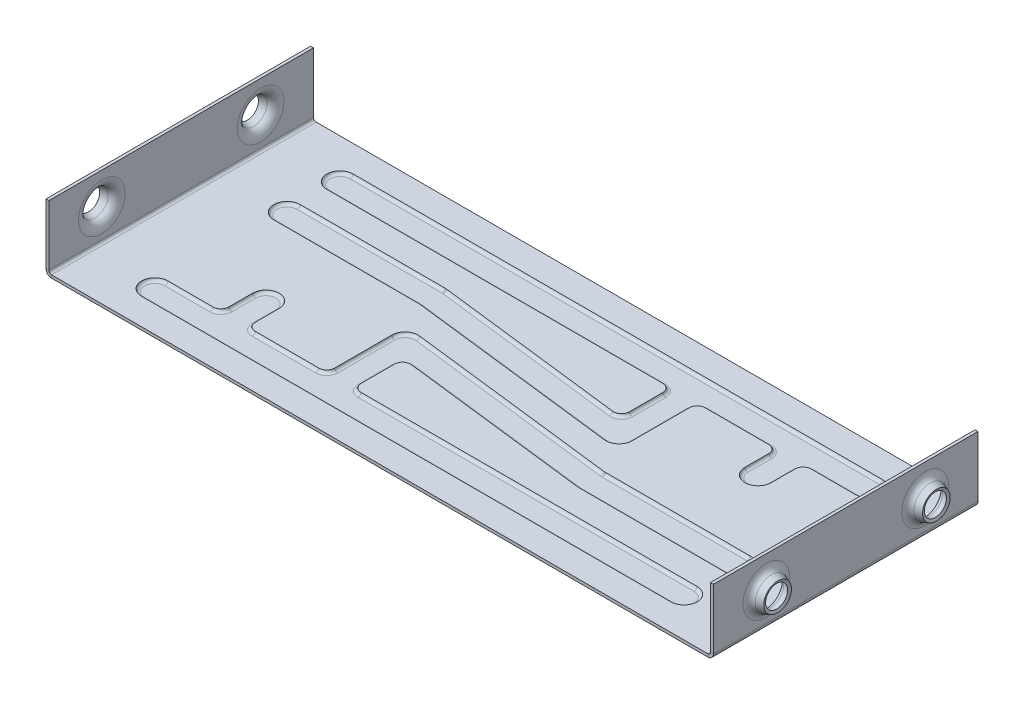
ISO-10303-21;
HEADER;
FILE_DESCRIPTION(('STEP AP214'),'2;1');
FILE_NAME('part.step','',(''),(''),'','','');
FILE_SCHEMA(('AUTOMOTIVE_DESIGN { 1 0 10303 214 1 1 1 1 }'));
ENDSEC;
DATA;
#1=APPLICATION_CONTEXT('core data for automotive mechanical design processes');
#2=APPLICATION_PROTOCOL_DEFINITION('international standard','automotive_design',2000,#1);
#3=PRODUCT_CONTEXT('',#1,'mechanical');
#4=PRODUCT('Part','Part','',(#3));
#5=PRODUCT_RELATED_PRODUCT_CATEGORY('part','',(#4));
#6=PRODUCT_DEFINITION_FORMATION('','',#4);
#7=PRODUCT_DEFINITION_CONTEXT('part definition',#1,'design');
#8=PRODUCT_DEFINITION('design','',#6,#7);
#9=PRODUCT_DEFINITION_SHAPE('','',#8);
#10=(LENGTH_UNIT() NAMED_UNIT(*) SI_UNIT(.MILLI.,.METRE.));
#11=(NAMED_UNIT(*) PLANE_ANGLE_UNIT() SI_UNIT($,.RADIAN.));
#12=(NAMED_UNIT(*) SI_UNIT($,.STERADIAN.) SOLID_ANGLE_UNIT());
#13=UNCERTAINTY_MEASURE_WITH_UNIT(LENGTH_MEASURE(1.E-05),#10,'distance_accuracy_value','');
#14=(GEOMETRIC_REPRESENTATION_CONTEXT(3) GLOBAL_UNCERTAINTY_ASSIGNED_CONTEXT((#13)) GLOBAL_UNIT_ASSIGNED_CONTEXT((#10,
#11,#12)) REPRESENTATION_CONTEXT('',''));
#15=CARTESIAN_POINT('',(0.,0.,0.));
#16=DIRECTION('',(0.,0.,1.));
#17=DIRECTION('',(1.,0.,0.));
#18=AXIS2_PLACEMENT_3D('',#15,#16,#17);
#19=CARTESIAN_POINT('',(126.1,23.8,50.));
#20=DIRECTION('',(-1.,0.,0.));
#21=DIRECTION('',(0.,-1.,0.));
#22=AXIS2_PLACEMENT_3D('',#19,#20,#21);
#23=PLANE('',#22);
#24=DIRECTION('',(0.,0.,1.));
#25=VECTOR('',#24,1.);
#26=CARTESIAN_POINT('',(126.1,0.999999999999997,50.));
#27=LINE('',#26,#25);
#28=CARTESIAN_POINT('',(126.1,0.999999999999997,-50.));
#29=VERTEX_POINT('',#28);
#30=CARTESIAN_POINT('',(126.1,0.999999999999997,50.));
#31=VERTEX_POINT('',#30);
#32=EDGE_CURVE('E1310',#29,#31,#27,.T.);
#33=ORIENTED_EDGE('',*,*,#32,.F.);
#34=DIRECTION('',(0.,1.,0.));
#35=VECTOR('',#34,1.);
#36=CARTESIAN_POINT('',(126.1,23.8,-50.));
#37=LINE('',#36,#35);
#38=CARTESIAN_POINT('',(126.1,23.8,-50.));
#39=VERTEX_POINT('',#38);
#40=EDGE_CURVE('E1318',#29,#39,#37,.T.);
#41=ORIENTED_EDGE('',*,*,#40,.T.);
#42=DIRECTION('',(0.,0.,1.));
#43=VECTOR('',#42,1.);
#44=CARTESIAN_POINT('',(126.1,23.8,50.));
#45=LINE('',#44,#43);
#46=CARTESIAN_POINT('',(126.1,23.8,50.));
#47=VERTEX_POINT('',#46);
#48=EDGE_CURVE('E1321',#39,#47,#45,.T.);
#49=ORIENTED_EDGE('',*,*,#48,.T.);
#50=DIRECTION('',(0.,-1.,0.));
#51=VECTOR('',#50,1.);
#52=CARTESIAN_POINT('',(126.1,0.,50.));
#53=LINE('',#52,#51);
#54=EDGE_CURVE('E1315',#47,#31,#53,.T.);
#55=ORIENTED_EDGE('',*,*,#54,.T.);
#56=EDGE_LOOP('',(#33,#41,#49,#55));
#57=FACE_BOUND('',#56,.T.);
#58=CARTESIAN_POINT('',(126.1,11.8,30.));
#59=DIRECTION('',(1.,0.,0.));
#60=DIRECTION('',(0.,1.,0.));
#61=AXIS2_PLACEMENT_3D('',#58,#59,#60);
#62=CIRCLE('',#61,8.80083015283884);
#63=CARTESIAN_POINT('',(126.1,20.6008301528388,30.));
#64=VERTEX_POINT('',#63);
#65=EDGE_CURVE('E43',#64,#64,#62,.T.);
#66=ORIENTED_EDGE('',*,*,#65,.F.);
#67=EDGE_LOOP('',(#66));
#68=FACE_BOUND('',#67,.T.);
#69=CARTESIAN_POINT('',(126.1,11.8,-30.));
#70=DIRECTION('',(1.,0.,0.));
#71=DIRECTION('',(0.,1.,0.));
#72=AXIS2_PLACEMENT_3D('',#69,#70,#71);
#73=CIRCLE('',#72,8.80083015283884);
#74=CARTESIAN_POINT('',(126.1,20.6008301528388,-30.));
#75=VERTEX_POINT('',#74);
#76=EDGE_CURVE('E11',#75,#75,#73,.T.);
#77=ORIENTED_EDGE('',*,*,#76,.F.);
#78=EDGE_LOOP('',(#77));
#79=FACE_BOUND('',#78,.T.);
#80=ADVANCED_FACE('F35',(#57,#68,#79),#23,.F.);
#81=CARTESIAN_POINT('',(125.,23.8,50.));
#82=DIRECTION('',(-1.,0.,0.));
#83=DIRECTION('',(0.,-1.,0.));
#84=AXIS2_PLACEMENT_3D('',#81,#82,#83);
#85=PLANE('',#84);
#86=CARTESIAN_POINT('',(125.,11.8,30.));
#87=DIRECTION('',(-1.,0.,0.));
#88=DIRECTION('',(0.,0.,-1.));
#89=AXIS2_PLACEMENT_3D('',#86,#87,#88);
#90=CIRCLE('',#89,8.80083015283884);
#91=CARTESIAN_POINT('',(125.,11.8,21.1991698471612));
#92=VERTEX_POINT('',#91);
#93=EDGE_CURVE('E1609',#92,#92,#90,.F.);
#94=ORIENTED_EDGE('',*,*,#93,.T.);
#95=EDGE_LOOP('',(#94));
#96=FACE_BOUND('',#95,.T.);
#97=DIRECTION('',(0.,1.,0.));
#98=VECTOR('',#97,1.);
#99=CARTESIAN_POINT('',(125.,23.8,-50.));
#100=LINE('',#99,#98);
#101=CARTESIAN_POINT('',(125.,1.,-50.));
#102=VERTEX_POINT('',#101);
#103=CARTESIAN_POINT('',(125.,23.8,-50.));
#104=VERTEX_POINT('',#103);
#105=EDGE_CURVE('E1326',#102,#104,#100,.T.);
#106=ORIENTED_EDGE('',*,*,#105,.F.);
#107=DIRECTION('',(0.,0.,-1.));
#108=VECTOR('',#107,1.);
#109=CARTESIAN_POINT('',(125.,1.,50.));
#110=LINE('',#109,#108);
#111=CARTESIAN_POINT('',(125.,1.,50.));
#112=VERTEX_POINT('',#111);
#113=EDGE_CURVE('E1305',#112,#102,#110,.T.);
#114=ORIENTED_EDGE('',*,*,#113,.F.);
#115=DIRECTION('',(0.,-1.,0.));
#116=VECTOR('',#115,1.);
#117=CARTESIAN_POINT('',(125.,0.,50.));
#118=LINE('',#117,#116);
#119=CARTESIAN_POINT('',(125.,23.8,50.));
#120=VERTEX_POINT('',#119);
#121=EDGE_CURVE('E1314',#120,#112,#118,.T.);
#122=ORIENTED_EDGE('',*,*,#121,.F.);
#123=DIRECTION('',(0.,0.,1.));
#124=VECTOR('',#123,1.);
#125=CARTESIAN_POINT('',(125.,23.8,50.));
#126=LINE('',#125,#124);
#127=EDGE_CURVE('E1319',#104,#120,#126,.T.);
#128=ORIENTED_EDGE('',*,*,#127,.F.);
#129=EDGE_LOOP('',(#106,#114,#122,#128));
#130=FACE_BOUND('',#129,.T.);
#131=CARTESIAN_POINT('',(125.,11.8,-30.));
#132=DIRECTION('',(-1.,0.,0.));
#133=DIRECTION('',(0.,0.,-1.));
#134=AXIS2_PLACEMENT_3D('',#131,#132,#133);
#135=CIRCLE('',#134,8.80083015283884);
#136=CARTESIAN_POINT('',(125.,11.8,-38.8008301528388));
#137=VERTEX_POINT('',#136);
#138=EDGE_CURVE('E1598',#137,#137,#135,.F.);
#139=ORIENTED_EDGE('',*,*,#138,.T.);
#140=EDGE_LOOP('',(#139));
#141=FACE_BOUND('',#140,.T.);
#142=ADVANCED_FACE('F1574',(#96,#130,#141),#85,.T.);
#143=CARTESIAN_POINT('',(-126.1,23.8,-50.));
#144=DIRECTION('',(1.,0.,0.));
#145=DIRECTION('',(0.,1.,0.));
#146=AXIS2_PLACEMENT_3D('',#143,#144,#145);
#147=PLANE('',#146);
#148=DIRECTION('',(0.,0.,-1.));
#149=VECTOR('',#148,1.);
#150=CARTESIAN_POINT('',(-126.1,0.999999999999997,-50.));
#151=LINE('',#150,#149);
#152=CARTESIAN_POINT('',(-126.1,0.999999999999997,50.));
#153=VERTEX_POINT('',#152);
#154=CARTESIAN_POINT('',(-126.1,0.999999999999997,-50.));
#155=VERTEX_POINT('',#154);
#156=EDGE_CURVE('E1363',#153,#155,#151,.T.);
#157=ORIENTED_EDGE('',*,*,#156,.F.);
#158=DIRECTION('',(0.,1.,0.));
#159=VECTOR('',#158,1.);
#160=CARTESIAN_POINT('',(-126.1,23.8,50.));
#161=LINE('',#160,#159);
#162=CARTESIAN_POINT('',(-126.1,23.8,50.));
#163=VERTEX_POINT('',#162);
#164=EDGE_CURVE('E1371',#153,#163,#161,.T.);
#165=ORIENTED_EDGE('',*,*,#164,.T.);
#166=DIRECTION('',(0.,0.,-1.));
#167=VECTOR('',#166,1.);
#168=CARTESIAN_POINT('',(-126.1,23.8,-50.));
#169=LINE('',#168,#167);
#170=CARTESIAN_POINT('',(-126.1,23.8,-50.));
#171=VERTEX_POINT('',#170);
#172=EDGE_CURVE('E1374',#163,#171,#169,.T.);
#173=ORIENTED_EDGE('',*,*,#172,.T.);
#174=DIRECTION('',(0.,-1.,0.));
#175=VECTOR('',#174,1.);
#176=CARTESIAN_POINT('',(-126.1,0.,-50.));
#177=LINE('',#176,#175);
#178=EDGE_CURVE('E1368',#171,#155,#177,.T.);
#179=ORIENTED_EDGE('',*,*,#178,.T.);
#180=EDGE_LOOP('',(#157,#165,#173,#179));
#181=FACE_BOUND('',#180,.T.);
#182=CARTESIAN_POINT('',(-126.1,11.8,30.));
#183=DIRECTION('',(-1.,0.,0.));
#184=DIRECTION('',(0.,-1.,0.));
#185=AXIS2_PLACEMENT_3D('',#182,#183,#184);
#186=CIRCLE('',#185,8.80083015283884);
#187=CARTESIAN_POINT('',(-126.1,2.99916984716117,30.));
#188=VERTEX_POINT('',#187);
#189=EDGE_CURVE('E1418',#188,#188,#186,.T.);
#190=ORIENTED_EDGE('',*,*,#189,.F.);
#191=EDGE_LOOP('',(#190));
#192=FACE_BOUND('',#191,.T.);
#193=CARTESIAN_POINT('',(-126.1,11.8,-30.));
#194=DIRECTION('',(-1.,0.,0.));
#195=DIRECTION('',(0.,-1.,0.));
#196=AXIS2_PLACEMENT_3D('',#193,#194,#195);
#197=CIRCLE('',#196,8.80083015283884);
#198=CARTESIAN_POINT('',(-126.1,2.99916984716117,-30.));
#199=VERTEX_POINT('',#198);
#200=EDGE_CURVE('E1564',#199,#199,#197,.T.);
#201=ORIENTED_EDGE('',*,*,#200,.F.);
#202=EDGE_LOOP('',(#201));
#203=FACE_BOUND('',#202,.T.);
#204=ADVANCED_FACE('F1636',(#181,#192,#203),#147,.F.);
#205=CARTESIAN_POINT('',(-125.,23.8,-50.));
#206=DIRECTION('',(1.,0.,0.));
#207=DIRECTION('',(0.,1.,0.));
#208=AXIS2_PLACEMENT_3D('',#205,#206,#207);
#209=PLANE('',#208);
#210=CARTESIAN_POINT('',(-125.,11.8,30.));
#211=DIRECTION('',(-1.,0.,0.));
#212=DIRECTION('',(0.,0.,-1.));
#213=AXIS2_PLACEMENT_3D('',#210,#211,#212);
#214=CIRCLE('',#213,8.80083015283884);
#215=CARTESIAN_POINT('',(-125.,11.8,21.1991698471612));
#216=VERTEX_POINT('',#215);
#217=EDGE_CURVE('E1297',#216,#216,#214,.F.);
#218=ORIENTED_EDGE('',*,*,#217,.F.);
#219=EDGE_LOOP('',(#218));
#220=FACE_BOUND('',#219,.T.);
#221=DIRECTION('',(0.,1.,0.));
#222=VECTOR('',#221,1.);
#223=CARTESIAN_POINT('',(-125.,23.8,50.));
#224=LINE('',#223,#222);
#225=CARTESIAN_POINT('',(-125.,1.,50.));
#226=VERTEX_POINT('',#225);
#227=CARTESIAN_POINT('',(-125.,23.8,50.));
#228=VERTEX_POINT('',#227);
#229=EDGE_CURVE('E1379',#226,#228,#224,.T.);
#230=ORIENTED_EDGE('',*,*,#229,.F.);
#231=DIRECTION('',(0.,0.,1.));
#232=VECTOR('',#231,1.);
#233=CARTESIAN_POINT('',(-125.,1.,-50.));
#234=LINE('',#233,#232);
#235=CARTESIAN_POINT('',(-125.,1.,-50.));
#236=VERTEX_POINT('',#235);
#237=EDGE_CURVE('E1358',#236,#226,#234,.T.);
#238=ORIENTED_EDGE('',*,*,#237,.F.);
#239=DIRECTION('',(0.,-1.,0.));
#240=VECTOR('',#239,1.);
#241=CARTESIAN_POINT('',(-125.,0.,-50.));
#242=LINE('',#241,#240);
#243=CARTESIAN_POINT('',(-125.,23.8,-50.));
#244=VERTEX_POINT('',#243);
#245=EDGE_CURVE('E1367',#244,#236,#242,.T.);
#246=ORIENTED_EDGE('',*,*,#245,.F.);
#247=DIRECTION('',(0.,0.,-1.));
#248=VECTOR('',#247,1.);
#249=CARTESIAN_POINT('',(-125.,23.8,-50.));
#250=LINE('',#249,#248);
#251=EDGE_CURVE('E1372',#228,#244,#250,.T.);
#252=ORIENTED_EDGE('',*,*,#251,.F.);
#253=EDGE_LOOP('',(#230,#238,#246,#252));
#254=FACE_BOUND('',#253,.T.);
#255=CARTESIAN_POINT('',(-125.,11.8,-30.));
#256=DIRECTION('',(-1.,0.,0.));
#257=DIRECTION('',(0.,0.,-1.));
#258=AXIS2_PLACEMENT_3D('',#255,#256,#257);
#259=CIRCLE('',#258,8.80083015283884);
#260=CARTESIAN_POINT('',(-125.,11.8,-38.8008301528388));
#261=VERTEX_POINT('',#260);
#262=EDGE_CURVE('E723',#261,#261,#259,.F.);
#263=ORIENTED_EDGE('',*,*,#262,.F.);
#264=EDGE_LOOP('',(#263));
#265=FACE_BOUND('',#264,.T.);
#266=ADVANCED_FACE('F1633',(#220,#254,#265),#209,.T.);
#267=CARTESIAN_POINT('',(-125.,-1.1,-50.));
#268=DIRECTION('',(0.,-1.,0.));
#269=DIRECTION('',(0.,0.,-1.));
#270=AXIS2_PLACEMENT_3D('',#267,#268,#269);
#271=PLANE('',#270);
#272=CARTESIAN_POINT('',(-43.,-1.1,27.));
#273=DIRECTION('',(0.,1.,0.));
#274=DIRECTION('',(0.,0.,1.));
#275=AXIS2_PLACEMENT_3D('',#272,#273,#274);
#276=CIRCLE('',#275,2.28584936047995);
#277=CARTESIAN_POINT('',(-43.,-1.1,29.2858493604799));
#278=VERTEX_POINT('',#277);
#279=CARTESIAN_POINT('',(-40.71415063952,-1.1,27.));
#280=VERTEX_POINT('',#279);
#281=EDGE_CURVE('E50',#278,#280,#276,.T.);
#282=ORIENTED_EDGE('',*,*,#281,.F.);
#283=DIRECTION('',(-1.,0.,0.));
#284=VECTOR('',#283,1.);
#285=CARTESIAN_POINT('',(-67.,-1.1,29.2858493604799));
#286=LINE('',#285,#284);
#287=CARTESIAN_POINT('',(-67.,-1.1,29.2858493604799));
#288=VERTEX_POINT('',#287);
#289=EDGE_CURVE('E1561',#288,#278,#286,.F.);
#290=ORIENTED_EDGE('',*,*,#289,.F.);
#291=CARTESIAN_POINT('',(-67.,-1.1,27.));
#292=DIRECTION('',(0.,1.,0.));
#293=DIRECTION('',(0.,0.,1.));
#294=AXIS2_PLACEMENT_3D('',#291,#292,#293);
#295=CIRCLE('',#294,2.28584936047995);
#296=CARTESIAN_POINT('',(-69.2858493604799,-1.1,27.));
#297=VERTEX_POINT('',#296);
#298=EDGE_CURVE('E1557',#297,#288,#295,.T.);
#299=ORIENTED_EDGE('',*,*,#298,.F.);
#300=DIRECTION('',(0.,0.,-1.));
#301=VECTOR('',#300,1.);
#302=CARTESIAN_POINT('',(-69.2858493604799,-1.1,18.));
#303=LINE('',#302,#301);
#304=CARTESIAN_POINT('',(-69.2858493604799,-1.1,18.));
#305=VERTEX_POINT('',#304);
#306=EDGE_CURVE('E1551',#305,#297,#303,.F.);
#307=ORIENTED_EDGE('',*,*,#306,.F.);
#308=CARTESIAN_POINT('',(-75.,-1.1,18.));
#309=DIRECTION('',(0.,-1.,0.));
#310=DIRECTION('',(0.,0.,-1.));
#311=AXIS2_PLACEMENT_3D('',#308,#309,#310);
#312=CIRCLE('',#311,5.71415063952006);
#313=CARTESIAN_POINT('',(-80.71415063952,-1.1,18.));
#314=VERTEX_POINT('',#313);
#315=EDGE_CURVE('E1545',#314,#305,#312,.T.);
#316=ORIENTED_EDGE('',*,*,#315,.F.);
#317=DIRECTION('',(0.,0.,1.));
#318=VECTOR('',#317,1.);
#319=CARTESIAN_POINT('',(-80.71415063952,-1.1,27.));
#320=LINE('',#319,#318);
#321=CARTESIAN_POINT('',(-80.71415063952,-1.1,27.));
#322=VERTEX_POINT('',#321);
#323=EDGE_CURVE('E1539',#322,#314,#320,.F.);
#324=ORIENTED_EDGE('',*,*,#323,.F.);
#325=CARTESIAN_POINT('',(-83.,-1.1,27.));
#326=DIRECTION('',(0.,1.,0.));
#327=DIRECTION('',(0.,0.,1.));
#328=AXIS2_PLACEMENT_3D('',#325,#326,#327);
#329=CIRCLE('',#328,2.28584936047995);
#330=CARTESIAN_POINT('',(-83.,-1.1,29.2858493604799));
#331=VERTEX_POINT('',#330);
#332=EDGE_CURVE('E1533',#331,#322,#329,.T.);
#333=ORIENTED_EDGE('',*,*,#332,.F.);
#334=DIRECTION('',(-1.,0.,0.));
#335=VECTOR('',#334,1.);
#336=CARTESIAN_POINT('',(-100.,-1.1,29.2858493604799));
#337=LINE('',#336,#335);
#338=CARTESIAN_POINT('',(-100.,-1.1,29.2858493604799));
#339=VERTEX_POINT('',#338);
#340=EDGE_CURVE('E1527',#339,#331,#337,.F.);
#341=ORIENTED_EDGE('',*,*,#340,.F.);
#342=CARTESIAN_POINT('',(-100.,-1.1,35.));
#343=DIRECTION('',(0.,-1.,0.));
#344=DIRECTION('',(0.,0.,-1.));
#345=AXIS2_PLACEMENT_3D('',#342,#343,#344);
#346=CIRCLE('',#345,5.71415063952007);
#347=CARTESIAN_POINT('',(-100.,-1.1,40.7141506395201));
#348=VERTEX_POINT('',#347);
#349=EDGE_CURVE('E1521',#348,#339,#346,.T.);
#350=ORIENTED_EDGE('',*,*,#349,.F.);
#351=DIRECTION('',(1.,0.,0.));
#352=VECTOR('',#351,1.);
#353=CARTESIAN_POINT('',(100.,-1.1,40.7141506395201));
#354=LINE('',#353,#352);
#355=CARTESIAN_POINT('',(100.,-1.1,40.7141506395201));
#356=VERTEX_POINT('',#355);
#357=EDGE_CURVE('E1515',#356,#348,#354,.F.);
#358=ORIENTED_EDGE('',*,*,#357,.F.);
#359=CARTESIAN_POINT('',(100.,-1.1,35.));
#360=DIRECTION('',(0.,-1.,0.));
#361=DIRECTION('',(0.,0.,-1.));
#362=AXIS2_PLACEMENT_3D('',#359,#360,#361);
#363=CIRCLE('',#362,5.71415063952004);
#364=CARTESIAN_POINT('',(100.,-1.1,29.28584936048));
#365=VERTEX_POINT('',#364);
#366=EDGE_CURVE('E1509',#365,#356,#363,.T.);
#367=ORIENTED_EDGE('',*,*,#366,.F.);
#368=DIRECTION('',(-1.,0.,0.));
#369=VECTOR('',#368,1.);
#370=CARTESIAN_POINT('',(-27.,-1.1,29.28584936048));
#371=LINE('',#370,#369);
#372=CARTESIAN_POINT('',(-27.,-1.1,29.28584936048));
#373=VERTEX_POINT('',#372);
#374=EDGE_CURVE('E1503',#373,#365,#371,.F.);
#375=ORIENTED_EDGE('',*,*,#374,.F.);
#376=CARTESIAN_POINT('',(-27.,-1.1,27.));
#377=DIRECTION('',(0.,1.,0.));
#378=DIRECTION('',(0.,0.,1.));
#379=AXIS2_PLACEMENT_3D('',#376,#377,#378);
#380=CIRCLE('',#379,2.28584936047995);
#381=CARTESIAN_POINT('',(-29.2858493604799,-1.1,27.));
#382=VERTEX_POINT('',#381);
#383=EDGE_CURVE('E1497',#382,#373,#380,.T.);
#384=ORIENTED_EDGE('',*,*,#383,.F.);
#385=DIRECTION('',(0.,0.,-1.));
#386=VECTOR('',#385,1.);
#387=CARTESIAN_POINT('',(-29.2858493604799,-1.1,14.385247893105));
#388=LINE('',#387,#386);
#389=CARTESIAN_POINT('',(-29.2858493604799,-1.1,14.385247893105));
#390=VERTEX_POINT('',#389);
#391=EDGE_CURVE('E1500',#390,#382,#388,.F.);
#392=ORIENTED_EDGE('',*,*,#391,.F.);
#393=CARTESIAN_POINT('',(-27.,-1.1,14.385247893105));
#394=DIRECTION('',(0.,1.,0.));
#395=DIRECTION('',(0.,0.,1.));
#396=AXIS2_PLACEMENT_3D('',#393,#394,#395);
#397=CIRCLE('',#396,2.28584936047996);
#398=CARTESIAN_POINT('',(-26.7277683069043,-1.1,12.1156670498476));
#399=VERTEX_POINT('',#398);
#400=EDGE_CURVE('E1506',#399,#390,#397,.T.);
#401=ORIENTED_EDGE('',*,*,#400,.F.);
#402=DIRECTION('',(0.992882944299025,0.,0.119094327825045));
#403=VECTOR('',#402,1.);
#404=CARTESIAN_POINT('',(44.618276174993,-1.1,20.673482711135));
#405=LINE('',#404,#403);
#406=CARTESIAN_POINT('',(44.618276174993,-1.1,20.673482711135));
#407=VERTEX_POINT('',#406);
#408=EDGE_CURVE('E1512',#407,#399,#405,.F.);
#409=ORIENTED_EDGE('',*,*,#408,.F.);
#410=CARTESIAN_POINT('',(45.2987991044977,-1.1,15.0000000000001));
#411=DIRECTION('',(0.,-1.,0.));
#412=DIRECTION('',(0.,0.,-1.));
#413=AXIS2_PLACEMENT_3D('',#410,#411,#412);
#414=CIRCLE('',#413,5.71415063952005);
#415=CARTESIAN_POINT('',(45.2987991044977,-1.1,20.7141506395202));
#416=VERTEX_POINT('',#415);
#417=EDGE_CURVE('E1518',#416,#407,#414,.T.);
#418=ORIENTED_EDGE('',*,*,#417,.F.);
#419=DIRECTION('',(1.,0.,0.));
#420=VECTOR('',#419,1.);
#421=CARTESIAN_POINT('',(100.,-1.1,20.7141506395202));
#422=LINE('',#421,#420);
#423=CARTESIAN_POINT('',(100.,-1.1,20.7141506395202));
#424=VERTEX_POINT('',#423);
#425=EDGE_CURVE('E1524',#424,#416,#422,.F.);
#426=ORIENTED_EDGE('',*,*,#425,.F.);
#427=CARTESIAN_POINT('',(100.,-1.1,15.0000000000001));
#428=DIRECTION('',(0.,-1.,0.));
#429=DIRECTION('',(0.,0.,-1.));
#430=AXIS2_PLACEMENT_3D('',#427,#428,#429);
#431=CIRCLE('',#430,5.71415063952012);
#432=CARTESIAN_POINT('',(100.,-1.1,9.28584936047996));
#433=VERTEX_POINT('',#432);
#434=EDGE_CURVE('E1530',#433,#424,#431,.T.);
#435=ORIENTED_EDGE('',*,*,#434,.F.);
#436=DIRECTION('',(-1.,0.,0.));
#437=VECTOR('',#436,1.);
#438=CARTESIAN_POINT('',(100.,-1.1,9.28584936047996));
#439=LINE('',#438,#437);
#440=CARTESIAN_POINT('',(45.2987991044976,-1.1,9.28584936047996));
#441=VERTEX_POINT('',#440);
#442=EDGE_CURVE('E1536',#441,#433,#439,.F.);
#443=ORIENTED_EDGE('',*,*,#442,.F.);
#444=CARTESIAN_POINT('',(45.2987991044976,-1.1,5.00000000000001));
#445=DIRECTION('',(0.,1.,0.));
#446=DIRECTION('',(0.,0.,1.));
#447=AXIS2_PLACEMENT_3D('',#444,#445,#446);
#448=CIRCLE('',#447,4.28584936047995);
#449=CARTESIAN_POINT('',(44.7883787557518,-1.1,9.25534673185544));
#450=VERTEX_POINT('',#449);
#451=EDGE_CURVE('E1542',#450,#441,#448,.T.);
#452=ORIENTED_EDGE('',*,*,#451,.F.);
#453=DIRECTION('',(-0.992882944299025,0.,-0.119094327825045));
#454=VECTOR('',#453,1.);
#455=CARTESIAN_POINT('',(44.7883787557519,-1.1,9.25534673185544));
#456=LINE('',#455,#454);
#457=CARTESIAN_POINT('',(-34.3194770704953,-1.1,-0.233482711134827));
#458=VERTEX_POINT('',#457);
#459=EDGE_CURVE('E1548',#458,#450,#456,.F.);
#460=ORIENTED_EDGE('',*,*,#459,.F.);
#461=CARTESIAN_POINT('',(-35.,-1.1,5.44000000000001));
#462=DIRECTION('',(0.,-1.,0.));
#463=DIRECTION('',(0.,0.,-1.));
#464=AXIS2_PLACEMENT_3D('',#461,#462,#463);
#465=CIRCLE('',#464,5.71415063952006);
#466=CARTESIAN_POINT('',(-40.71415063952,-1.1,5.44000000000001));
#467=VERTEX_POINT('',#466);
#468=EDGE_CURVE('E1554',#467,#458,#465,.T.);
#469=ORIENTED_EDGE('',*,*,#468,.F.);
#470=DIRECTION('',(0.,0.,1.));
#471=VECTOR('',#470,1.);
#472=CARTESIAN_POINT('',(-40.71415063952,-1.1,27.));
#473=LINE('',#472,#471);
#474=EDGE_CURVE('E55',#280,#467,#473,.F.);
#475=ORIENTED_EDGE('',*,*,#474,.F.);
#476=EDGE_LOOP('',(#282,#290,#299,#307,#316,#324,#333,#341,#350,#358,#367,#375,#384,#392,#401,
#409,#418,#426,#435,#443,#452,#460,#469,#475));
#477=FACE_BOUND('',#476,.T.);
#478=CARTESIAN_POINT('',(43.,-1.1,-27.));
#479=DIRECTION('',(0.,1.,0.));
#480=DIRECTION('',(0.,0.,1.));
#481=AXIS2_PLACEMENT_3D('',#478,#479,#480);
#482=CIRCLE('',#481,2.28584936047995);
#483=CARTESIAN_POINT('',(43.,-1.1,-29.2858493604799));
#484=VERTEX_POINT('',#483);
#485=CARTESIAN_POINT('',(40.71415063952,-1.1,-27.));
#486=VERTEX_POINT('',#485);
#487=EDGE_CURVE('E1494',#484,#486,#482,.T.);
#488=ORIENTED_EDGE('',*,*,#487,.F.);
#489=DIRECTION('',(1.,0.,0.));
#490=VECTOR('',#489,1.);
#491=CARTESIAN_POINT('',(67.,-1.1,-29.2858493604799));
#492=LINE('',#491,#490);
#493=CARTESIAN_POINT('',(67.,-1.1,-29.2858493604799));
#494=VERTEX_POINT('',#493);
#495=EDGE_CURVE('E1491',#494,#484,#492,.F.);
#496=ORIENTED_EDGE('',*,*,#495,.F.);
#497=CARTESIAN_POINT('',(67.,-1.1,-27.));
#498=DIRECTION('',(0.,1.,0.));
#499=DIRECTION('',(0.,0.,1.));
#500=AXIS2_PLACEMENT_3D('',#497,#498,#499);
#501=CIRCLE('',#500,2.28584936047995);
#502=CARTESIAN_POINT('',(69.2858493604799,-1.1,-27.));
#503=VERTEX_POINT('',#502);
#504=EDGE_CURVE('E1485',#503,#494,#501,.T.);
#505=ORIENTED_EDGE('',*,*,#504,.F.);
#506=DIRECTION('',(0.,0.,1.));
#507=VECTOR('',#506,1.);
#508=CARTESIAN_POINT('',(69.2858493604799,-1.1,-18.));
#509=LINE('',#508,#507);
#510=CARTESIAN_POINT('',(69.2858493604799,-1.1,-18.));
#511=VERTEX_POINT('',#510);
#512=EDGE_CURVE('E1479',#511,#503,#509,.F.);
#513=ORIENTED_EDGE('',*,*,#512,.F.);
#514=CARTESIAN_POINT('',(75.,-1.1,-18.));
#515=DIRECTION('',(0.,-1.,0.));
#516=DIRECTION('',(0.,0.,-1.));
#517=AXIS2_PLACEMENT_3D('',#514,#515,#516);
#518=CIRCLE('',#517,5.71415063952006);
#519=CARTESIAN_POINT('',(80.71415063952,-1.1,-18.));
#520=VERTEX_POINT('',#519);
#521=EDGE_CURVE('E1473',#520,#511,#518,.T.);
#522=ORIENTED_EDGE('',*,*,#521,.F.);
#523=DIRECTION('',(0.,0.,-1.));
#524=VECTOR('',#523,1.);
#525=CARTESIAN_POINT('',(80.71415063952,-1.1,-27.));
#526=LINE('',#525,#524);
#527=CARTESIAN_POINT('',(80.71415063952,-1.1,-27.));
#528=VERTEX_POINT('',#527);
#529=EDGE_CURVE('E1467',#528,#520,#526,.F.);
#530=ORIENTED_EDGE('',*,*,#529,.F.);
#531=CARTESIAN_POINT('',(83.,-1.1,-27.));
#532=DIRECTION('',(0.,1.,0.));
#533=DIRECTION('',(0.,0.,1.));
#534=AXIS2_PLACEMENT_3D('',#531,#532,#533);
#535=CIRCLE('',#534,2.28584936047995);
#536=CARTESIAN_POINT('',(83.,-1.1,-29.2858493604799));
#537=VERTEX_POINT('',#536);
#538=EDGE_CURVE('E1461',#537,#528,#535,.T.);
#539=ORIENTED_EDGE('',*,*,#538,.F.);
#540=DIRECTION('',(1.,0.,0.));
#541=VECTOR('',#540,1.);
#542=CARTESIAN_POINT('',(100.,-1.1,-29.2858493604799));
#543=LINE('',#542,#541);
#544=CARTESIAN_POINT('',(100.,-1.1,-29.2858493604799));
#545=VERTEX_POINT('',#544);
#546=EDGE_CURVE('E1455',#545,#537,#543,.F.);
#547=ORIENTED_EDGE('',*,*,#546,.F.);
#548=CARTESIAN_POINT('',(100.,-1.1,-35.));
#549=DIRECTION('',(0.,-1.,0.));
#550=DIRECTION('',(0.,0.,-1.));
#551=AXIS2_PLACEMENT_3D('',#548,#549,#550);
#552=CIRCLE('',#551,5.71415063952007);
#553=CARTESIAN_POINT('',(100.,-1.1,-40.71415063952));
#554=VERTEX_POINT('',#553);
#555=EDGE_CURVE('E1449',#554,#545,#552,.T.);
#556=ORIENTED_EDGE('',*,*,#555,.F.);
#557=DIRECTION('',(-1.,0.,0.));
#558=VECTOR('',#557,1.);
#559=CARTESIAN_POINT('',(-100.,-1.1,-40.71415063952));
#560=LINE('',#559,#558);
#561=CARTESIAN_POINT('',(-100.,-1.1,-40.71415063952));
#562=VERTEX_POINT('',#561);
#563=EDGE_CURVE('E1443',#562,#554,#560,.F.);
#564=ORIENTED_EDGE('',*,*,#563,.F.);
#565=CARTESIAN_POINT('',(-100.,-1.1,-35.));
#566=DIRECTION('',(0.,-1.,0.));
#567=DIRECTION('',(0.,0.,-1.));
#568=AXIS2_PLACEMENT_3D('',#565,#566,#567);
#569=CIRCLE('',#568,5.71415063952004);
#570=CARTESIAN_POINT('',(-100.,-1.1,-29.28584936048));
#571=VERTEX_POINT('',#570);
#572=EDGE_CURVE('E1437',#571,#562,#569,.T.);
#573=ORIENTED_EDGE('',*,*,#572,.F.);
#574=DIRECTION('',(1.,0.,0.));
#575=VECTOR('',#574,1.);
#576=CARTESIAN_POINT('',(26.9999999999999,-1.1,-29.28584936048));
#577=LINE('',#576,#575);
#578=CARTESIAN_POINT('',(26.9999999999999,-1.1,-29.28584936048));
#579=VERTEX_POINT('',#578);
#580=EDGE_CURVE('E1431',#579,#571,#577,.F.);
#581=ORIENTED_EDGE('',*,*,#580,.F.);
#582=CARTESIAN_POINT('',(26.9999999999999,-1.1,-27.));
#583=DIRECTION('',(0.,1.,0.));
#584=DIRECTION('',(0.,0.,1.));
#585=AXIS2_PLACEMENT_3D('',#582,#583,#584);
#586=CIRCLE('',#585,2.28584936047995);
#587=CARTESIAN_POINT('',(29.2858493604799,-1.1,-27.));
#588=VERTEX_POINT('',#587);
#589=EDGE_CURVE('E1425',#588,#579,#586,.T.);
#590=ORIENTED_EDGE('',*,*,#589,.F.);
#591=DIRECTION('',(0.,0.,1.));
#592=VECTOR('',#591,1.);
#593=CARTESIAN_POINT('',(29.2858493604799,-1.1,-14.385247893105));
#594=LINE('',#593,#592);
#595=CARTESIAN_POINT('',(29.2858493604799,-1.1,-14.385247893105));
#596=VERTEX_POINT('',#595);
#597=EDGE_CURVE('E1428',#596,#588,#594,.F.);
#598=ORIENTED_EDGE('',*,*,#597,.F.);
#599=CARTESIAN_POINT('',(26.9999999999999,-1.1,-14.385247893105));
#600=DIRECTION('',(0.,1.,0.));
#601=DIRECTION('',(0.,0.,1.));
#602=AXIS2_PLACEMENT_3D('',#599,#600,#601);
#603=CIRCLE('',#602,2.28584936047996);
#604=CARTESIAN_POINT('',(26.7277683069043,-1.1,-12.1156670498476));
#605=VERTEX_POINT('',#604);
#606=EDGE_CURVE('E1434',#605,#596,#603,.T.);
#607=ORIENTED_EDGE('',*,*,#606,.F.);
#608=DIRECTION('',(-0.992882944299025,0.,-0.119094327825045));
#609=VECTOR('',#608,1.);
#610=CARTESIAN_POINT('',(-44.618276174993,-1.1,-20.673482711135));
#611=LINE('',#610,#609);
#612=CARTESIAN_POINT('',(-44.618276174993,-1.1,-20.673482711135));
#613=VERTEX_POINT('',#612);
#614=EDGE_CURVE('E1440',#613,#605,#611,.F.);
#615=ORIENTED_EDGE('',*,*,#614,.F.);
#616=CARTESIAN_POINT('',(-45.2987991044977,-1.1,-15.0000000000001));
#617=DIRECTION('',(0.,-1.,0.));
#618=DIRECTION('',(0.,0.,-1.));
#619=AXIS2_PLACEMENT_3D('',#616,#617,#618);
#620=CIRCLE('',#619,5.71415063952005);
#621=CARTESIAN_POINT('',(-45.2987991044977,-1.1,-20.7141506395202));
#622=VERTEX_POINT('',#621);
#623=EDGE_CURVE('E1446',#622,#613,#620,.T.);
#624=ORIENTED_EDGE('',*,*,#623,.F.);
#625=DIRECTION('',(-1.,0.,0.));
#626=VECTOR('',#625,1.);
#627=CARTESIAN_POINT('',(-100.,-1.1,-20.7141506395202));
#628=LINE('',#627,#626);
#629=CARTESIAN_POINT('',(-100.,-1.1,-20.7141506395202));
#630=VERTEX_POINT('',#629);
#631=EDGE_CURVE('E1452',#630,#622,#628,.F.);
#632=ORIENTED_EDGE('',*,*,#631,.F.);
#633=CARTESIAN_POINT('',(-100.,-1.1,-15.0000000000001));
#634=DIRECTION('',(0.,-1.,0.));
#635=DIRECTION('',(0.,0.,-1.));
#636=AXIS2_PLACEMENT_3D('',#633,#634,#635);
#637=CIRCLE('',#636,5.71415063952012);
#638=CARTESIAN_POINT('',(-100.,-1.1,-9.28584936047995));
#639=VERTEX_POINT('',#638);
#640=EDGE_CURVE('E1458',#639,#630,#637,.T.);
#641=ORIENTED_EDGE('',*,*,#640,.F.);
#642=DIRECTION('',(1.,0.,0.));
#643=VECTOR('',#642,1.);
#644=CARTESIAN_POINT('',(-100.,-1.1,-9.28584936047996));
#645=LINE('',#644,#643);
#646=CARTESIAN_POINT('',(-45.2987991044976,-1.1,-9.28584936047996));
#647=VERTEX_POINT('',#646);
#648=EDGE_CURVE('E1464',#647,#639,#645,.F.);
#649=ORIENTED_EDGE('',*,*,#648,.F.);
#650=CARTESIAN_POINT('',(-45.2987991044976,-1.1,-5.));
#651=DIRECTION('',(0.,1.,0.));
#652=DIRECTION('',(0.,0.,1.));
#653=AXIS2_PLACEMENT_3D('',#650,#651,#652);
#654=CIRCLE('',#653,4.28584936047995);
#655=CARTESIAN_POINT('',(-44.7883787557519,-1.1,-9.25534673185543));
#656=VERTEX_POINT('',#655);
#657=EDGE_CURVE('E1470',#656,#647,#654,.T.);
#658=ORIENTED_EDGE('',*,*,#657,.F.);
#659=DIRECTION('',(0.992882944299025,0.,0.119094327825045));
#660=VECTOR('',#659,1.);
#661=CARTESIAN_POINT('',(-44.7883787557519,-1.1,-9.25534673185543));
#662=LINE('',#661,#660);
#663=CARTESIAN_POINT('',(34.3194770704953,-1.1,0.233482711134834));
#664=VERTEX_POINT('',#663);
#665=EDGE_CURVE('E1476',#664,#656,#662,.F.);
#666=ORIENTED_EDGE('',*,*,#665,.F.);
#667=CARTESIAN_POINT('',(35.,-1.1,-5.44));
#668=DIRECTION('',(0.,-1.,0.));
#669=DIRECTION('',(0.,0.,-1.));
#670=AXIS2_PLACEMENT_3D('',#667,#668,#669);
#671=CIRCLE('',#670,5.71415063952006);
#672=CARTESIAN_POINT('',(40.71415063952,-1.1,-5.44));
#673=VERTEX_POINT('',#672);
#674=EDGE_CURVE('E1482',#673,#664,#671,.T.);
#675=ORIENTED_EDGE('',*,*,#674,.F.);
#676=DIRECTION('',(0.,0.,-1.));
#677=VECTOR('',#676,1.);
#678=CARTESIAN_POINT('',(40.71415063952,-1.1,-27.));
#679=LINE('',#678,#677);
#680=EDGE_CURVE('E1488',#486,#673,#679,.F.);
#681=ORIENTED_EDGE('',*,*,#680,.F.);
#682=EDGE_LOOP('',(#488,#496,#505,#513,#522,#530,#539,#547,#556,#564,#573,#581,#590,#598,#607,
#615,#624,#632,#641,#649,#658,#666,#675,#681));
#683=FACE_BOUND('',#682,.T.);
#684=DIRECTION('',(-1.,0.,0.));
#685=VECTOR('',#684,1.);
#686=CARTESIAN_POINT('',(-125.,-1.1,-50.));
#687=LINE('',#686,#685);
#688=CARTESIAN_POINT('',(124.,-1.1,-50.));
#689=VERTEX_POINT('',#688);
#690=CARTESIAN_POINT('',(-124.,-1.1,-50.));
#691=VERTEX_POINT('',#690);
#692=EDGE_CURVE('E1414',#689,#691,#687,.T.);
#693=ORIENTED_EDGE('',*,*,#692,.F.);
#694=DIRECTION('',(0.,0.,-1.));
#695=VECTOR('',#694,1.);
#696=CARTESIAN_POINT('',(124.,-1.1,-50.));
#697=LINE('',#696,#695);
#698=CARTESIAN_POINT('',(124.,-1.1,50.));
#699=VERTEX_POINT('',#698);
#700=EDGE_CURVE('E1335',#689,#699,#697,.F.);
#701=ORIENTED_EDGE('',*,*,#700,.T.);
#702=DIRECTION('',(1.,0.,0.));
#703=VECTOR('',#702,1.);
#704=CARTESIAN_POINT('',(-125.,-1.1,50.));
#705=LINE('',#704,#703);
#706=CARTESIAN_POINT('',(-124.,-1.1,50.));
#707=VERTEX_POINT('',#706);
#708=EDGE_CURVE('E1411',#707,#699,#705,.T.);
#709=ORIENTED_EDGE('',*,*,#708,.F.);
#710=DIRECTION('',(0.,0.,1.));
#711=VECTOR('',#710,1.);
#712=CARTESIAN_POINT('',(-124.,-1.1,50.));
#713=LINE('',#712,#711);
#714=EDGE_CURVE('E1388',#707,#691,#713,.F.);
#715=ORIENTED_EDGE('',*,*,#714,.T.);
#716=EDGE_LOOP('',(#693,#701,#709,#715));
#717=FACE_BOUND('',#716,.T.);
#718=ADVANCED_FACE('F1635',(#477,#683,#717),#271,.T.);
#719=CARTESIAN_POINT('',(-125.,0.,-50.));
#720=DIRECTION('',(0.,-1.,0.));
#721=DIRECTION('',(0.,0.,-1.));
#722=AXIS2_PLACEMENT_3D('',#719,#720,#721);
#723=PLANE('',#722);
#724=DIRECTION('',(0.,0.,-1.));
#725=VECTOR('',#724,1.);
#726=CARTESIAN_POINT('',(-30.,-5.6843418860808E-11,14.385247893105));
#727=LINE('',#726,#725);
#728=CARTESIAN_POINT('',(-30.,-5.6843418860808E-11,27.));
#729=VERTEX_POINT('',#728);
#730=CARTESIAN_POINT('',(-30.,-5.6843418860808E-11,14.385247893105));
#731=VERTEX_POINT('',#730);
#732=EDGE_CURVE('E839',#729,#731,#727,.T.);
#733=ORIENTED_EDGE('',*,*,#732,.F.);
#734=CARTESIAN_POINT('',(-27.,-5.6843418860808E-11,27.));
#735=DIRECTION('',(0.,-1.,0.));
#736=DIRECTION('',(0.,0.,1.));
#737=AXIS2_PLACEMENT_3D('',#734,#735,#736);
#738=CIRCLE('',#737,3.);
#739=CARTESIAN_POINT('',(-27.,-5.6843418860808E-11,30.));
#740=VERTEX_POINT('',#739);
#741=EDGE_CURVE('E837',#740,#729,#738,.T.);
#742=ORIENTED_EDGE('',*,*,#741,.F.);
#743=DIRECTION('',(-1.,0.,0.));
#744=VECTOR('',#743,1.);
#745=CARTESIAN_POINT('',(-27.,-5.6843418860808E-11,30.));
#746=LINE('',#745,#744);
#747=CARTESIAN_POINT('',(100.,-5.6843418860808E-11,30.));
#748=VERTEX_POINT('',#747);
#749=EDGE_CURVE('E834',#748,#740,#746,.T.);
#750=ORIENTED_EDGE('',*,*,#749,.F.);
#751=CARTESIAN_POINT('',(100.,-5.6843418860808E-11,35.));
#752=DIRECTION('',(0.,1.,0.));
#753=DIRECTION('',(0.,0.,-1.));
#754=AXIS2_PLACEMENT_3D('',#751,#752,#753);
#755=CIRCLE('',#754,4.99999999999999);
#756=CARTESIAN_POINT('',(100.,-5.6843418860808E-11,40.));
#757=VERTEX_POINT('',#756);
#758=EDGE_CURVE('E832',#757,#748,#755,.T.);
#759=ORIENTED_EDGE('',*,*,#758,.F.);
#760=DIRECTION('',(1.,0.,0.));
#761=VECTOR('',#760,1.);
#762=CARTESIAN_POINT('',(100.,-5.6843418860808E-11,40.));
#763=LINE('',#762,#761);
#764=CARTESIAN_POINT('',(-100.,-5.6843418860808E-11,40.));
#765=VERTEX_POINT('',#764);
#766=EDGE_CURVE('E881',#765,#757,#763,.T.);
#767=ORIENTED_EDGE('',*,*,#766,.F.);
#768=CARTESIAN_POINT('',(-100.,-5.6843418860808E-11,35.));
#769=DIRECTION('',(0.,1.,0.));
#770=DIRECTION('',(0.,0.,-1.));
#771=AXIS2_PLACEMENT_3D('',#768,#769,#770);
#772=CIRCLE('',#771,5.00000000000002);
#773=CARTESIAN_POINT('',(-100.,-5.6843418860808E-11,30.));
#774=VERTEX_POINT('',#773);
#775=EDGE_CURVE('E879',#774,#765,#772,.T.);
#776=ORIENTED_EDGE('',*,*,#775,.F.);
#777=DIRECTION('',(-1.,0.,0.));
#778=VECTOR('',#777,1.);
#779=CARTESIAN_POINT('',(-100.,-5.6843418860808E-11,30.));
#780=LINE('',#779,#778);
#781=CARTESIAN_POINT('',(-83.,-5.6843418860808E-11,30.));
#782=VERTEX_POINT('',#781);
#783=EDGE_CURVE('E877',#782,#774,#780,.T.);
#784=ORIENTED_EDGE('',*,*,#783,.F.);
#785=CARTESIAN_POINT('',(-83.,-5.6843418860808E-11,27.));
#786=DIRECTION('',(0.,-1.,0.));
#787=DIRECTION('',(0.,0.,1.));
#788=AXIS2_PLACEMENT_3D('',#785,#786,#787);
#789=CIRCLE('',#788,3.);
#790=CARTESIAN_POINT('',(-80.,-5.6843418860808E-11,27.));
#791=VERTEX_POINT('',#790);
#792=EDGE_CURVE('E875',#791,#782,#789,.T.);
#793=ORIENTED_EDGE('',*,*,#792,.F.);
#794=DIRECTION('',(0.,0.,1.));
#795=VECTOR('',#794,1.);
#796=CARTESIAN_POINT('',(-80.,-5.6843418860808E-11,27.));
#797=LINE('',#796,#795);
#798=CARTESIAN_POINT('',(-80.,-5.6843418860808E-11,18.));
#799=VERTEX_POINT('',#798);
#800=EDGE_CURVE('E873',#799,#791,#797,.T.);
#801=ORIENTED_EDGE('',*,*,#800,.F.);
#802=CARTESIAN_POINT('',(-75.,-5.6843418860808E-11,18.));
#803=DIRECTION('',(0.,1.,0.));
#804=DIRECTION('',(0.,0.,-1.));
#805=AXIS2_PLACEMENT_3D('',#802,#803,#804);
#806=CIRCLE('',#805,5.);
#807=CARTESIAN_POINT('',(-70.,-5.6843418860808E-11,18.));
#808=VERTEX_POINT('',#807);
#809=EDGE_CURVE('E871',#808,#799,#806,.T.);
#810=ORIENTED_EDGE('',*,*,#809,.F.);
#811=DIRECTION('',(0.,0.,-1.));
#812=VECTOR('',#811,1.);
#813=CARTESIAN_POINT('',(-70.,-5.6843418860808E-11,18.));
#814=LINE('',#813,#812);
#815=CARTESIAN_POINT('',(-70.,-5.6843418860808E-11,27.));
#816=VERTEX_POINT('',#815);
#817=EDGE_CURVE('E869',#816,#808,#814,.T.);
#818=ORIENTED_EDGE('',*,*,#817,.F.);
#819=CARTESIAN_POINT('',(-67.,-5.6843418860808E-11,27.));
#820=DIRECTION('',(0.,-1.,0.));
#821=DIRECTION('',(0.,0.,1.));
#822=AXIS2_PLACEMENT_3D('',#819,#820,#821);
#823=CIRCLE('',#822,3.);
#824=CARTESIAN_POINT('',(-67.,-5.6843418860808E-11,30.));
#825=VERTEX_POINT('',#824);
#826=EDGE_CURVE('E867',#825,#816,#823,.T.);
#827=ORIENTED_EDGE('',*,*,#826,.F.);
#828=DIRECTION('',(-1.,0.,0.));
#829=VECTOR('',#828,1.);
#830=CARTESIAN_POINT('',(-67.,-5.6843418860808E-11,30.));
#831=LINE('',#830,#829);
#832=CARTESIAN_POINT('',(-43.,-5.6843418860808E-11,30.));
#833=VERTEX_POINT('',#832);
#834=EDGE_CURVE('E865',#833,#825,#831,.T.);
#835=ORIENTED_EDGE('',*,*,#834,.F.);
#836=CARTESIAN_POINT('',(-43.,-5.6843418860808E-11,27.));
#837=DIRECTION('',(0.,-1.,0.));
#838=DIRECTION('',(0.,0.,1.));
#839=AXIS2_PLACEMENT_3D('',#836,#837,#838);
#840=CIRCLE('',#839,3.);
#841=CARTESIAN_POINT('',(-40.0000000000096,0.,27.));
#842=VERTEX_POINT('',#841);
#843=EDGE_CURVE('E862',#842,#833,#840,.T.);
#844=ORIENTED_EDGE('',*,*,#843,.F.);
#845=DIRECTION('',(0.,0.,1.));
#846=VECTOR('',#845,1.);
#847=CARTESIAN_POINT('',(-40.,-5.6843418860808E-11,27.));
#848=LINE('',#847,#846);
#849=CARTESIAN_POINT('',(-40.,-5.6843418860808E-11,5.44000000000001));
#850=VERTEX_POINT('',#849);
#851=EDGE_CURVE('E859',#850,#842,#848,.T.);
#852=ORIENTED_EDGE('',*,*,#851,.F.);
#853=CARTESIAN_POINT('',(-35.,-5.6843418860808E-11,5.44000000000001));
#854=DIRECTION('',(0.,1.,0.));
#855=DIRECTION('',(0.,0.,-1.));
#856=AXIS2_PLACEMENT_3D('',#853,#854,#855);
#857=CIRCLE('',#856,5.00000000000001);
#858=CARTESIAN_POINT('',(-34.4045283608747,-5.6843418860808E-11,0.475585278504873));
#859=VERTEX_POINT('',#858);
#860=EDGE_CURVE('E857',#859,#850,#857,.T.);
#861=ORIENTED_EDGE('',*,*,#860,.F.);
#862=DIRECTION('',(-0.992882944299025,0.,-0.119094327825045));
#863=VECTOR('',#862,1.);
#864=CARTESIAN_POINT('',(44.7033274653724,-5.6843418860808E-11,9.96441472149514));
#865=LINE('',#864,#863);
#866=CARTESIAN_POINT('',(44.7033274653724,-5.6843418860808E-11,9.96441472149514));
#867=VERTEX_POINT('',#866);
#868=EDGE_CURVE('E855',#867,#859,#865,.T.);
#869=ORIENTED_EDGE('',*,*,#868,.F.);
#870=CARTESIAN_POINT('',(45.2987991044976,-5.6843418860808E-11,5.00000000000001));
#871=DIRECTION('',(0.,-1.,0.));
#872=DIRECTION('',(0.,0.,1.));
#873=AXIS2_PLACEMENT_3D('',#870,#871,#872);
#874=CIRCLE('',#873,5.);
#875=CARTESIAN_POINT('',(45.2987991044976,-5.6843418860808E-11,10.));
#876=VERTEX_POINT('',#875);
#877=EDGE_CURVE('E853',#876,#867,#874,.T.);
#878=ORIENTED_EDGE('',*,*,#877,.F.);
#879=DIRECTION('',(-1.,0.,0.));
#880=VECTOR('',#879,1.);
#881=CARTESIAN_POINT('',(100.,-5.6843418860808E-11,10.));
#882=LINE('',#881,#880);
#883=CARTESIAN_POINT('',(100.,-5.6843418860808E-11,10.));
#884=VERTEX_POINT('',#883);
#885=EDGE_CURVE('E851',#884,#876,#882,.T.);
#886=ORIENTED_EDGE('',*,*,#885,.F.);
#887=CARTESIAN_POINT('',(100.,-5.6843418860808E-11,15.0000000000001));
#888=DIRECTION('',(0.,1.,0.));
#889=DIRECTION('',(0.,0.,-1.));
#890=AXIS2_PLACEMENT_3D('',#887,#888,#889);
#891=CIRCLE('',#890,5.00000000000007);
#892=CARTESIAN_POINT('',(100.,-5.6843418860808E-11,20.0000000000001));
#893=VERTEX_POINT('',#892);
#894=EDGE_CURVE('E849',#893,#884,#891,.T.);
#895=ORIENTED_EDGE('',*,*,#894,.F.);
#896=DIRECTION('',(1.,0.,0.));
#897=VECTOR('',#896,1.);
#898=CARTESIAN_POINT('',(100.,-5.6843418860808E-11,20.0000000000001));
#899=LINE('',#898,#897);
#900=CARTESIAN_POINT('',(45.2987991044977,-5.6843418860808E-11,20.0000000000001));
#901=VERTEX_POINT('',#900);
#902=EDGE_CURVE('E847',#901,#893,#899,.T.);
#903=ORIENTED_EDGE('',*,*,#902,.F.);
#904=CARTESIAN_POINT('',(45.2987991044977,-5.6843418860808E-11,15.0000000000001));
#905=DIRECTION('',(0.,1.,0.));
#906=DIRECTION('',(0.,0.,1.));
#907=AXIS2_PLACEMENT_3D('',#904,#905,#906);
#908=CIRCLE('',#907,5.);
#909=CARTESIAN_POINT('',(44.7033274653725,-5.6843418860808E-11,19.9644147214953));
#910=VERTEX_POINT('',#909);
#911=EDGE_CURVE('E845',#910,#901,#908,.T.);
#912=ORIENTED_EDGE('',*,*,#911,.F.);
#913=DIRECTION('',(0.992882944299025,0.,0.119094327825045));
#914=VECTOR('',#913,1.);
#915=CARTESIAN_POINT('',(44.7033274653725,-5.6843418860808E-11,19.9644147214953));
#916=LINE('',#915,#914);
#917=CARTESIAN_POINT('',(-26.6427170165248,-5.6843418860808E-11,11.4065990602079));
#918=VERTEX_POINT('',#917);
#919=EDGE_CURVE('E843',#918,#910,#916,.T.);
#920=ORIENTED_EDGE('',*,*,#919,.F.);
#921=CARTESIAN_POINT('',(-27.,-5.6843418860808E-11,14.385247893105));
#922=DIRECTION('',(0.,-1.,0.));
#923=DIRECTION('',(0.,0.,1.));
#924=AXIS2_PLACEMENT_3D('',#921,#922,#923);
#925=CIRCLE('',#924,3.00000000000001);
#926=EDGE_CURVE('E841',#731,#918,#925,.T.);
#927=ORIENTED_EDGE('',*,*,#926,.F.);
#928=EDGE_LOOP('',(#733,#742,#750,#759,#767,#776,#784,#793,#801,#810,#818,#827,#835,#844,#852,
#861,#869,#878,#886,#895,#903,#912,#920,#927));
#929=FACE_BOUND('',#928,.T.);
#930=DIRECTION('',(0.,0.,1.));
#931=VECTOR('',#930,1.);
#932=CARTESIAN_POINT('',(29.9999999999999,-5.6843418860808E-11,-14.385247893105));
#933=LINE('',#932,#931);
#934=CARTESIAN_POINT('',(29.9999999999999,-5.6843418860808E-11,-27.));
#935=VERTEX_POINT('',#934);
#936=CARTESIAN_POINT('',(29.9999999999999,-5.6843418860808E-11,-14.385247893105));
#937=VERTEX_POINT('',#936);
#938=EDGE_CURVE('E1128',#935,#937,#933,.T.);
#939=ORIENTED_EDGE('',*,*,#938,.F.);
#940=CARTESIAN_POINT('',(26.9999999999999,-5.6843418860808E-11,-27.));
#941=DIRECTION('',(0.,-1.,0.));
#942=DIRECTION('',(0.,0.,-1.));
#943=AXIS2_PLACEMENT_3D('',#940,#941,#942);
#944=CIRCLE('',#943,3.);
#945=CARTESIAN_POINT('',(26.9999999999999,-5.6843418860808E-11,-30.));
#946=VERTEX_POINT('',#945);
#947=EDGE_CURVE('E1126',#946,#935,#944,.T.);
#948=ORIENTED_EDGE('',*,*,#947,.F.);
#949=DIRECTION('',(1.,0.,0.));
#950=VECTOR('',#949,1.);
#951=CARTESIAN_POINT('',(26.9999999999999,-5.6843418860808E-11,-30.));
#952=LINE('',#951,#950);
#953=CARTESIAN_POINT('',(-100.,-5.6843418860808E-11,-30.));
#954=VERTEX_POINT('',#953);
#955=EDGE_CURVE('E1123',#954,#946,#952,.T.);
#956=ORIENTED_EDGE('',*,*,#955,.F.);
#957=CARTESIAN_POINT('',(-100.,-5.6843418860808E-11,-35.));
#958=DIRECTION('',(0.,1.,0.));
#959=DIRECTION('',(0.,0.,1.));
#960=AXIS2_PLACEMENT_3D('',#957,#958,#959);
#961=CIRCLE('',#960,4.99999999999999);
#962=CARTESIAN_POINT('',(-100.,-5.6843418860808E-11,-40.));
#963=VERTEX_POINT('',#962);
#964=EDGE_CURVE('E1121',#963,#954,#961,.T.);
#965=ORIENTED_EDGE('',*,*,#964,.F.);
#966=DIRECTION('',(-1.,0.,0.));
#967=VECTOR('',#966,1.);
#968=CARTESIAN_POINT('',(-100.,-5.6843418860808E-11,-40.));
#969=LINE('',#968,#967);
#970=CARTESIAN_POINT('',(100.,-5.6843418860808E-11,-40.));
#971=VERTEX_POINT('',#970);
#972=EDGE_CURVE('E1170',#971,#963,#969,.T.);
#973=ORIENTED_EDGE('',*,*,#972,.F.);
#974=CARTESIAN_POINT('',(100.,-5.6843418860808E-11,-35.));
#975=DIRECTION('',(0.,1.,0.));
#976=DIRECTION('',(0.,0.,1.));
#977=AXIS2_PLACEMENT_3D('',#974,#975,#976);
#978=CIRCLE('',#977,5.00000000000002);
#979=CARTESIAN_POINT('',(100.,-5.6843418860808E-11,-30.));
#980=VERTEX_POINT('',#979);
#981=EDGE_CURVE('E1168',#980,#971,#978,.T.);
#982=ORIENTED_EDGE('',*,*,#981,.F.);
#983=DIRECTION('',(1.,0.,0.));
#984=VECTOR('',#983,1.);
#985=CARTESIAN_POINT('',(100.,-5.6843418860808E-11,-30.));
#986=LINE('',#985,#984);
#987=CARTESIAN_POINT('',(83.,-5.6843418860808E-11,-30.));
#988=VERTEX_POINT('',#987);
#989=EDGE_CURVE('E1166',#988,#980,#986,.T.);
#990=ORIENTED_EDGE('',*,*,#989,.F.);
#991=CARTESIAN_POINT('',(83.,-5.6843418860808E-11,-27.));
#992=DIRECTION('',(0.,-1.,0.));
#993=DIRECTION('',(0.,0.,-1.));
#994=AXIS2_PLACEMENT_3D('',#991,#992,#993);
#995=CIRCLE('',#994,3.);
#996=CARTESIAN_POINT('',(80.,-5.6843418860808E-11,-27.));
#997=VERTEX_POINT('',#996);
#998=EDGE_CURVE('E1164',#997,#988,#995,.T.);
#999=ORIENTED_EDGE('',*,*,#998,.F.);
#1000=DIRECTION('',(0.,0.,-1.));
#1001=VECTOR('',#1000,1.);
#1002=CARTESIAN_POINT('',(80.,-5.6843418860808E-11,-27.));
#1003=LINE('',#1002,#1001);
#1004=CARTESIAN_POINT('',(80.,-5.6843418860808E-11,-18.));
#1005=VERTEX_POINT('',#1004);
#1006=EDGE_CURVE('E1162',#1005,#997,#1003,.T.);
#1007=ORIENTED_EDGE('',*,*,#1006,.F.);
#1008=CARTESIAN_POINT('',(75.,-5.6843418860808E-11,-18.));
#1009=DIRECTION('',(0.,1.,0.));
#1010=DIRECTION('',(0.,0.,1.));
#1011=AXIS2_PLACEMENT_3D('',#1008,#1009,#1010);
#1012=CIRCLE('',#1011,5.);
#1013=CARTESIAN_POINT('',(70.,-5.6843418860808E-11,-18.));
#1014=VERTEX_POINT('',#1013);
#1015=EDGE_CURVE('E1160',#1014,#1005,#1012,.T.);
#1016=ORIENTED_EDGE('',*,*,#1015,.F.);
#1017=DIRECTION('',(0.,0.,1.));
#1018=VECTOR('',#1017,1.);
#1019=CARTESIAN_POINT('',(70.,-5.6843418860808E-11,-18.));
#1020=LINE('',#1019,#1018);
#1021=CARTESIAN_POINT('',(70.,-5.6843418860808E-11,-27.));
#1022=VERTEX_POINT('',#1021);
#1023=EDGE_CURVE('E1158',#1022,#1014,#1020,.T.);
#1024=ORIENTED_EDGE('',*,*,#1023,.F.);
#1025=CARTESIAN_POINT('',(67.,-5.6843418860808E-11,-27.));
#1026=DIRECTION('',(0.,-1.,0.));
#1027=DIRECTION('',(0.,0.,-1.));
#1028=AXIS2_PLACEMENT_3D('',#1025,#1026,#1027);
#1029=CIRCLE('',#1028,3.);
#1030=CARTESIAN_POINT('',(67.,-5.6843418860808E-11,-30.));
#1031=VERTEX_POINT('',#1030);
#1032=EDGE_CURVE('E1156',#1031,#1022,#1029,.T.);
#1033=ORIENTED_EDGE('',*,*,#1032,.F.);
#1034=DIRECTION('',(1.,0.,0.));
#1035=VECTOR('',#1034,1.);
#1036=CARTESIAN_POINT('',(67.,-5.6843418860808E-11,-30.));
#1037=LINE('',#1036,#1035);
#1038=CARTESIAN_POINT('',(43.,-5.6843418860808E-11,-30.));
#1039=VERTEX_POINT('',#1038);
#1040=EDGE_CURVE('E1154',#1039,#1031,#1037,.T.);
#1041=ORIENTED_EDGE('',*,*,#1040,.F.);
#1042=CARTESIAN_POINT('',(43.,-5.6843418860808E-11,-27.));
#1043=DIRECTION('',(0.,-1.,0.));
#1044=DIRECTION('',(0.,0.,-1.));
#1045=AXIS2_PLACEMENT_3D('',#1042,#1043,#1044);
#1046=CIRCLE('',#1045,3.);
#1047=CARTESIAN_POINT('',(40.0000000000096,0.,-27.));
#1048=VERTEX_POINT('',#1047);
#1049=EDGE_CURVE('E1151',#1048,#1039,#1046,.T.);
#1050=ORIENTED_EDGE('',*,*,#1049,.F.);
#1051=DIRECTION('',(0.,0.,-1.));
#1052=VECTOR('',#1051,1.);
#1053=CARTESIAN_POINT('',(40.,-5.6843418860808E-11,-27.));
#1054=LINE('',#1053,#1052);
#1055=CARTESIAN_POINT('',(40.,-5.6843418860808E-11,-5.44));
#1056=VERTEX_POINT('',#1055);
#1057=EDGE_CURVE('E1148',#1056,#1048,#1054,.T.);
#1058=ORIENTED_EDGE('',*,*,#1057,.F.);
#1059=CARTESIAN_POINT('',(35.,-5.6843418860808E-11,-5.44));
#1060=DIRECTION('',(0.,1.,0.));
#1061=DIRECTION('',(0.,0.,1.));
#1062=AXIS2_PLACEMENT_3D('',#1059,#1060,#1061);
#1063=CIRCLE('',#1062,5.00000000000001);
#1064=CARTESIAN_POINT('',(34.4045283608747,-5.6843418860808E-11,-0.475585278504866));
#1065=VERTEX_POINT('',#1064);
#1066=EDGE_CURVE('E1146',#1065,#1056,#1063,.T.);
#1067=ORIENTED_EDGE('',*,*,#1066,.F.);
#1068=DIRECTION('',(0.992882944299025,0.,0.119094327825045));
#1069=VECTOR('',#1068,1.);
#1070=CARTESIAN_POINT('',(-44.7033274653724,-5.6843418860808E-11,-9.96441472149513));
#1071=LINE('',#1070,#1069);
#1072=CARTESIAN_POINT('',(-44.7033274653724,-5.6843418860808E-11,-9.96441472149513));
#1073=VERTEX_POINT('',#1072);
#1074=EDGE_CURVE('E1144',#1073,#1065,#1071,.T.);
#1075=ORIENTED_EDGE('',*,*,#1074,.F.);
#1076=CARTESIAN_POINT('',(-45.2987991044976,-5.6843418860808E-11,-5.));
#1077=DIRECTION('',(0.,-1.,0.));
#1078=DIRECTION('',(0.,0.,-1.));
#1079=AXIS2_PLACEMENT_3D('',#1076,#1077,#1078);
#1080=CIRCLE('',#1079,5.);
#1081=CARTESIAN_POINT('',(-45.2987991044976,-5.6843418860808E-11,-10.));
#1082=VERTEX_POINT('',#1081);
#1083=EDGE_CURVE('E1142',#1082,#1073,#1080,.T.);
#1084=ORIENTED_EDGE('',*,*,#1083,.F.);
#1085=DIRECTION('',(1.,0.,0.));
#1086=VECTOR('',#1085,1.);
#1087=CARTESIAN_POINT('',(-100.,-5.6843418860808E-11,-10.));
#1088=LINE('',#1087,#1086);
#1089=CARTESIAN_POINT('',(-100.,-5.6843418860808E-11,-10.));
#1090=VERTEX_POINT('',#1089);
#1091=EDGE_CURVE('E1140',#1090,#1082,#1088,.T.);
#1092=ORIENTED_EDGE('',*,*,#1091,.F.);
#1093=CARTESIAN_POINT('',(-100.,-5.6843418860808E-11,-15.0000000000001));
#1094=DIRECTION('',(0.,1.,0.));
#1095=DIRECTION('',(0.,0.,1.));
#1096=AXIS2_PLACEMENT_3D('',#1093,#1094,#1095);
#1097=CIRCLE('',#1096,5.00000000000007);
#1098=CARTESIAN_POINT('',(-100.,-5.6843418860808E-11,-20.0000000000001));
#1099=VERTEX_POINT('',#1098);
#1100=EDGE_CURVE('E1138',#1099,#1090,#1097,.T.);
#1101=ORIENTED_EDGE('',*,*,#1100,.F.);
#1102=DIRECTION('',(-1.,0.,0.));
#1103=VECTOR('',#1102,1.);
#1104=CARTESIAN_POINT('',(-100.,-5.6843418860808E-11,-20.0000000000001));
#1105=LINE('',#1104,#1103);
#1106=CARTESIAN_POINT('',(-45.2987991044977,-5.6843418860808E-11,-20.0000000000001));
#1107=VERTEX_POINT('',#1106);
#1108=EDGE_CURVE('E1136',#1107,#1099,#1105,.T.);
#1109=ORIENTED_EDGE('',*,*,#1108,.F.);
#1110=CARTESIAN_POINT('',(-45.2987991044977,-5.6843418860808E-11,-15.0000000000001));
#1111=DIRECTION('',(0.,1.,0.));
#1112=DIRECTION('',(0.,0.,-1.));
#1113=AXIS2_PLACEMENT_3D('',#1110,#1111,#1112);
#1114=CIRCLE('',#1113,5.);
#1115=CARTESIAN_POINT('',(-44.7033274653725,-5.6843418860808E-11,-19.9644147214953));
#1116=VERTEX_POINT('',#1115);
#1117=EDGE_CURVE('E1134',#1116,#1107,#1114,.T.);
#1118=ORIENTED_EDGE('',*,*,#1117,.F.);
#1119=DIRECTION('',(-0.992882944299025,0.,-0.119094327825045));
#1120=VECTOR('',#1119,1.);
#1121=CARTESIAN_POINT('',(-44.7033274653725,-5.6843418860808E-11,-19.9644147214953));
#1122=LINE('',#1121,#1120);
#1123=CARTESIAN_POINT('',(26.6427170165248,-5.6843418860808E-11,-11.4065990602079));
#1124=VERTEX_POINT('',#1123);
#1125=EDGE_CURVE('E1132',#1124,#1116,#1122,.T.);
#1126=ORIENTED_EDGE('',*,*,#1125,.F.);
#1127=CARTESIAN_POINT('',(26.9999999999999,-5.6843418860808E-11,-14.385247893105));
#1128=DIRECTION('',(0.,-1.,0.));
#1129=DIRECTION('',(0.,0.,-1.));
#1130=AXIS2_PLACEMENT_3D('',#1127,#1128,#1129);
#1131=CIRCLE('',#1130,3.00000000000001);
#1132=EDGE_CURVE('E1130',#937,#1124,#1131,.T.);
#1133=ORIENTED_EDGE('',*,*,#1132,.F.);
#1134=EDGE_LOOP('',(#939,#948,#956,#965,#973,#982,#990,#999,#1007,#1016,#1024,#1033,#1041,#1050,
#1058,#1067,#1075,#1084,#1092,#1101,#1109,#1118,#1126,#1133));
#1135=FACE_BOUND('',#1134,.T.);
#1136=DIRECTION('',(0.,0.,-1.));
#1137=VECTOR('',#1136,1.);
#1138=CARTESIAN_POINT('',(124.,0.,-50.));
#1139=LINE('',#1138,#1137);
#1140=CARTESIAN_POINT('',(124.,0.,-50.));
#1141=VERTEX_POINT('',#1140);
#1142=CARTESIAN_POINT('',(124.,0.,50.));
#1143=VERTEX_POINT('',#1142);
#1144=EDGE_CURVE('E1348',#1141,#1143,#1139,.F.);
#1145=ORIENTED_EDGE('',*,*,#1144,.F.);
#1146=DIRECTION('',(-1.,0.,0.));
#1147=VECTOR('',#1146,1.);
#1148=CARTESIAN_POINT('',(-125.,0.,-50.));
#1149=LINE('',#1148,#1147);
#1150=CARTESIAN_POINT('',(-124.,0.,-50.));
#1151=VERTEX_POINT('',#1150);
#1152=EDGE_CURVE('E1415',#1141,#1151,#1149,.T.);
#1153=ORIENTED_EDGE('',*,*,#1152,.T.);
#1154=DIRECTION('',(0.,0.,1.));
#1155=VECTOR('',#1154,1.);
#1156=CARTESIAN_POINT('',(-124.,0.,50.));
#1157=LINE('',#1156,#1155);
#1158=CARTESIAN_POINT('',(-124.,0.,50.));
#1159=VERTEX_POINT('',#1158);
#1160=EDGE_CURVE('E1401',#1159,#1151,#1157,.F.);
#1161=ORIENTED_EDGE('',*,*,#1160,.F.);
#1162=DIRECTION('',(1.,0.,0.));
#1163=VECTOR('',#1162,1.);
#1164=CARTESIAN_POINT('',(-125.,0.,50.));
#1165=LINE('',#1164,#1163);
#1166=EDGE_CURVE('E1408',#1159,#1143,#1165,.T.);
#1167=ORIENTED_EDGE('',*,*,#1166,.T.);
#1168=EDGE_LOOP('',(#1145,#1153,#1161,#1167));
#1169=FACE_BOUND('',#1168,.T.);
#1170=ADVANCED_FACE('F1643',(#929,#1135,#1169),#723,.F.);
#1171=CARTESIAN_POINT('',(-125.,-1.1,-50.));
#1172=DIRECTION('',(0.,0.,-1.));
#1173=DIRECTION('',(-1.,0.,0.));
#1174=AXIS2_PLACEMENT_3D('',#1171,#1172,#1173);
#1175=PLANE('',#1174);
#1176=ORIENTED_EDGE('',*,*,#1152,.F.);
#1177=DIRECTION('',(0.,-1.,0.));
#1178=VECTOR('',#1177,1.);
#1179=CARTESIAN_POINT('',(124.,0.,-50.));
#1180=LINE('',#1179,#1178);
#1181=EDGE_CURVE('E1342',#1141,#689,#1180,.T.);
#1182=ORIENTED_EDGE('',*,*,#1181,.T.);
#1183=ORIENTED_EDGE('',*,*,#692,.T.);
#1184=DIRECTION('',(0.,-1.,0.));
#1185=VECTOR('',#1184,1.);
#1186=CARTESIAN_POINT('',(-124.,0.,-50.));
#1187=LINE('',#1186,#1185);
#1188=EDGE_CURVE('E1405',#1151,#691,#1187,.T.);
#1189=ORIENTED_EDGE('',*,*,#1188,.F.);
#1190=EDGE_LOOP('',(#1176,#1182,#1183,#1189));
#1191=FACE_BOUND('',#1190,.T.);
#1192=ADVANCED_FACE('F1681',(#1191),#1175,.T.);
#1193=CARTESIAN_POINT('',(-125.,-1.1,50.));
#1194=DIRECTION('',(0.,0.,1.));
#1195=DIRECTION('',(1.,0.,0.));
#1196=AXIS2_PLACEMENT_3D('',#1193,#1194,#1195);
#1197=PLANE('',#1196);
#1198=DIRECTION('',(0.,-1.,0.));
#1199=VECTOR('',#1198,1.);
#1200=CARTESIAN_POINT('',(124.,0.,50.));
#1201=LINE('',#1200,#1199);
#1202=EDGE_CURVE('E1352',#1143,#699,#1201,.T.);
#1203=ORIENTED_EDGE('',*,*,#1202,.F.);
#1204=ORIENTED_EDGE('',*,*,#1166,.F.);
#1205=DIRECTION('',(0.,-1.,0.));
#1206=VECTOR('',#1205,1.);
#1207=CARTESIAN_POINT('',(-124.,0.,50.));
#1208=LINE('',#1207,#1206);
#1209=EDGE_CURVE('E1395',#1159,#707,#1208,.T.);
#1210=ORIENTED_EDGE('',*,*,#1209,.T.);
#1211=ORIENTED_EDGE('',*,*,#708,.T.);
#1212=EDGE_LOOP('',(#1203,#1204,#1210,#1211));
#1213=FACE_BOUND('',#1212,.T.);
#1214=ADVANCED_FACE('F37',(#1213),#1197,.T.);
#1215=CARTESIAN_POINT('',(-124.,1.,-50.));
#1216=DIRECTION('',(0.,0.,-1.));
#1217=DIRECTION('',(-1.,0.,0.));
#1218=AXIS2_PLACEMENT_3D('',#1215,#1216,#1217);
#1219=PLANE('',#1218);
#1220=DIRECTION('',(-1.,0.,0.));
#1221=VECTOR('',#1220,1.);
#1222=CARTESIAN_POINT('',(-125.,1.,-50.));
#1223=LINE('',#1222,#1221);
#1224=EDGE_CURVE('E1355',#236,#155,#1223,.T.);
#1225=ORIENTED_EDGE('',*,*,#1224,.F.);
#1226=CARTESIAN_POINT('',(-124.,1.,-50.));
#1227=DIRECTION('',(0.,0.,1.));
#1228=DIRECTION('',(1.,0.,0.));
#1229=AXIS2_PLACEMENT_3D('',#1226,#1227,#1228);
#1230=CIRCLE('',#1229,1.);
#1231=EDGE_CURVE('E1398',#1151,#236,#1230,.F.);
#1232=ORIENTED_EDGE('',*,*,#1231,.F.);
#1233=ORIENTED_EDGE('',*,*,#1188,.T.);
#1234=CARTESIAN_POINT('',(-124.,1.,-50.));
#1235=DIRECTION('',(0.,0.,1.));
#1236=DIRECTION('',(1.,0.,0.));
#1237=AXIS2_PLACEMENT_3D('',#1234,#1235,#1236);
#1238=CIRCLE('',#1237,2.1);
#1239=EDGE_CURVE('E1391',#691,#155,#1238,.F.);
#1240=ORIENTED_EDGE('',*,*,#1239,.T.);
#1241=EDGE_LOOP('',(#1225,#1232,#1233,#1240));
#1242=FACE_BOUND('',#1241,.T.);
#1243=ADVANCED_FACE('F1670',(#1242),#1219,.T.);
#1244=CARTESIAN_POINT('',(-124.,1.,50.));
#1245=DIRECTION('',(0.,0.,-1.));
#1246=DIRECTION('',(-1.,0.,0.));
#1247=AXIS2_PLACEMENT_3D('',#1244,#1245,#1246);
#1248=PLANE('',#1247);
#1249=CARTESIAN_POINT('',(-124.,1.,50.));
#1250=DIRECTION('',(0.,0.,1.));
#1251=DIRECTION('',(1.,0.,0.));
#1252=AXIS2_PLACEMENT_3D('',#1249,#1250,#1251);
#1253=CIRCLE('',#1252,1.);
#1254=EDGE_CURVE('E1387',#226,#1159,#1253,.T.);
#1255=ORIENTED_EDGE('',*,*,#1254,.F.);
#1256=DIRECTION('',(-1.,0.,0.));
#1257=VECTOR('',#1256,1.);
#1258=CARTESIAN_POINT('',(-125.,1.,50.));
#1259=LINE('',#1258,#1257);
#1260=EDGE_CURVE('E1360',#226,#153,#1259,.T.);
#1261=ORIENTED_EDGE('',*,*,#1260,.T.);
#1262=CARTESIAN_POINT('',(-124.,1.,50.));
#1263=DIRECTION('',(0.,0.,1.));
#1264=DIRECTION('',(1.,0.,0.));
#1265=AXIS2_PLACEMENT_3D('',#1262,#1263,#1264);
#1266=CIRCLE('',#1265,2.1);
#1267=EDGE_CURVE('E1392',#153,#707,#1266,.T.);
#1268=ORIENTED_EDGE('',*,*,#1267,.T.);
#1269=ORIENTED_EDGE('',*,*,#1209,.F.);
#1270=EDGE_LOOP('',(#1255,#1261,#1268,#1269));
#1271=FACE_BOUND('',#1270,.T.);
#1272=ADVANCED_FACE('F1668',(#1271),#1248,.F.);
#1273=CARTESIAN_POINT('',(-124.,1.,50.));
#1274=DIRECTION('',(0.,0.,1.));
#1275=DIRECTION('',(-1.,0.,0.));
#1276=AXIS2_PLACEMENT_3D('',#1273,#1274,#1275);
#1277=CYLINDRICAL_SURFACE('',#1276,2.1);
#1278=ORIENTED_EDGE('',*,*,#714,.F.);
#1279=ORIENTED_EDGE('',*,*,#1267,.F.);
#1280=ORIENTED_EDGE('',*,*,#156,.T.);
#1281=ORIENTED_EDGE('',*,*,#1239,.F.);
#1282=EDGE_LOOP('',(#1278,#1279,#1280,#1281));
#1283=FACE_BOUND('',#1282,.T.);
#1284=ADVANCED_FACE('F1665',(#1283),#1277,.T.);
#1285=CARTESIAN_POINT('',(-124.,1.,50.));
#1286=DIRECTION('',(0.,0.,1.));
#1287=DIRECTION('',(-1.,0.,0.));
#1288=AXIS2_PLACEMENT_3D('',#1285,#1286,#1287);
#1289=CYLINDRICAL_SURFACE('',#1288,1.);
#1290=ORIENTED_EDGE('',*,*,#1160,.T.);
#1291=ORIENTED_EDGE('',*,*,#1231,.T.);
#1292=ORIENTED_EDGE('',*,*,#237,.T.);
#1293=ORIENTED_EDGE('',*,*,#1254,.T.);
#1294=EDGE_LOOP('',(#1290,#1291,#1292,#1293));
#1295=FACE_BOUND('',#1294,.T.);
#1296=ADVANCED_FACE('F1663',(#1295),#1289,.F.);
#1297=CARTESIAN_POINT('',(-126.1,0.,-50.));
#1298=DIRECTION('',(0.,0.,1.));
#1299=DIRECTION('',(1.,0.,0.));
#1300=AXIS2_PLACEMENT_3D('',#1297,#1298,#1299);
#1301=PLANE('',#1300);
#1302=ORIENTED_EDGE('',*,*,#1224,.T.);
#1303=ORIENTED_EDGE('',*,*,#178,.F.);
#1304=DIRECTION('',(1.,0.,0.));
#1305=VECTOR('',#1304,1.);
#1306=CARTESIAN_POINT('',(-126.1,23.8,-50.));
#1307=LINE('',#1306,#1305);
#1308=EDGE_CURVE('E1376',#171,#244,#1307,.T.);
#1309=ORIENTED_EDGE('',*,*,#1308,.T.);
#1310=ORIENTED_EDGE('',*,*,#245,.T.);
#1311=EDGE_LOOP('',(#1302,#1303,#1309,#1310));
#1312=FACE_BOUND('',#1311,.T.);
#1313=ADVANCED_FACE('F1659',(#1312),#1301,.F.);
#1314=CARTESIAN_POINT('',(-126.1,23.8,50.));
#1315=DIRECTION('',(0.,0.,-1.));
#1316=DIRECTION('',(-1.,0.,0.));
#1317=AXIS2_PLACEMENT_3D('',#1314,#1315,#1316);
#1318=PLANE('',#1317);
#1319=ORIENTED_EDGE('',*,*,#1260,.F.);
#1320=ORIENTED_EDGE('',*,*,#229,.T.);
#1321=DIRECTION('',(1.,0.,0.));
#1322=VECTOR('',#1321,1.);
#1323=CARTESIAN_POINT('',(-126.1,23.8,50.));
#1324=LINE('',#1323,#1322);
#1325=EDGE_CURVE('E1384',#163,#228,#1324,.T.);
#1326=ORIENTED_EDGE('',*,*,#1325,.F.);
#1327=ORIENTED_EDGE('',*,*,#164,.F.);
#1328=EDGE_LOOP('',(#1319,#1320,#1326,#1327));
#1329=FACE_BOUND('',#1328,.T.);
#1330=ADVANCED_FACE('F1655',(#1329),#1318,.F.);
#1331=CARTESIAN_POINT('',(-126.1,23.8,-50.));
#1332=DIRECTION('',(0.,-1.,0.));
#1333=DIRECTION('',(1.,0.,0.));
#1334=AXIS2_PLACEMENT_3D('',#1331,#1332,#1333);
#1335=PLANE('',#1334);
#1336=ORIENTED_EDGE('',*,*,#251,.T.);
#1337=ORIENTED_EDGE('',*,*,#1308,.F.);
#1338=ORIENTED_EDGE('',*,*,#172,.F.);
#1339=ORIENTED_EDGE('',*,*,#1325,.T.);
#1340=EDGE_LOOP('',(#1336,#1337,#1338,#1339));
#1341=FACE_BOUND('',#1340,.T.);
#1342=ADVANCED_FACE('F1651',(#1341),#1335,.F.);
#1343=CARTESIAN_POINT('',(124.,1.,50.));
#1344=DIRECTION('',(0.,0.,1.));
#1345=DIRECTION('',(1.,0.,0.));
#1346=AXIS2_PLACEMENT_3D('',#1343,#1344,#1345);
#1347=PLANE('',#1346);
#1348=DIRECTION('',(1.,0.,0.));
#1349=VECTOR('',#1348,1.);
#1350=CARTESIAN_POINT('',(125.,1.,50.));
#1351=LINE('',#1350,#1349);
#1352=EDGE_CURVE('E1304',#112,#31,#1351,.T.);
#1353=ORIENTED_EDGE('',*,*,#1352,.F.);
#1354=CARTESIAN_POINT('',(124.,1.,50.));
#1355=DIRECTION('',(0.,0.,-1.));
#1356=DIRECTION('',(-1.,0.,0.));
#1357=AXIS2_PLACEMENT_3D('',#1354,#1355,#1356);
#1358=CIRCLE('',#1357,1.);
#1359=EDGE_CURVE('E1345',#1143,#112,#1358,.F.);
#1360=ORIENTED_EDGE('',*,*,#1359,.F.);
#1361=ORIENTED_EDGE('',*,*,#1202,.T.);
#1362=CARTESIAN_POINT('',(124.,1.,50.));
#1363=DIRECTION('',(0.,0.,-1.));
#1364=DIRECTION('',(-1.,0.,0.));
#1365=AXIS2_PLACEMENT_3D('',#1362,#1363,#1364);
#1366=CIRCLE('',#1365,2.1);
#1367=EDGE_CURVE('E1338',#699,#31,#1366,.F.);
#1368=ORIENTED_EDGE('',*,*,#1367,.T.);
#1369=EDGE_LOOP('',(#1353,#1360,#1361,#1368));
#1370=FACE_BOUND('',#1369,.T.);
#1371=ADVANCED_FACE('F1654',(#1370),#1347,.T.);
#1372=CARTESIAN_POINT('',(124.,1.,-50.));
#1373=DIRECTION('',(0.,0.,1.));
#1374=DIRECTION('',(1.,0.,0.));
#1375=AXIS2_PLACEMENT_3D('',#1372,#1373,#1374);
#1376=PLANE('',#1375);
#1377=CARTESIAN_POINT('',(124.,1.,-50.));
#1378=DIRECTION('',(0.,0.,-1.));
#1379=DIRECTION('',(-1.,0.,0.));
#1380=AXIS2_PLACEMENT_3D('',#1377,#1378,#1379);
#1381=CIRCLE('',#1380,1.);
#1382=EDGE_CURVE('E1334',#102,#1141,#1381,.T.);
#1383=ORIENTED_EDGE('',*,*,#1382,.F.);
#1384=DIRECTION('',(1.,0.,0.));
#1385=VECTOR('',#1384,1.);
#1386=CARTESIAN_POINT('',(125.,1.,-50.));
#1387=LINE('',#1386,#1385);
#1388=EDGE_CURVE('E1307',#102,#29,#1387,.T.);
#1389=ORIENTED_EDGE('',*,*,#1388,.T.);
#1390=CARTESIAN_POINT('',(124.,1.,-50.));
#1391=DIRECTION('',(0.,0.,-1.));
#1392=DIRECTION('',(-1.,0.,0.));
#1393=AXIS2_PLACEMENT_3D('',#1390,#1391,#1392);
#1394=CIRCLE('',#1393,2.1);
#1395=EDGE_CURVE('E1339',#29,#689,#1394,.T.);
#1396=ORIENTED_EDGE('',*,*,#1395,.T.);
#1397=ORIENTED_EDGE('',*,*,#1181,.F.);
#1398=EDGE_LOOP('',(#1383,#1389,#1396,#1397));
#1399=FACE_BOUND('',#1398,.T.);
#1400=ADVANCED_FACE('F1708',(#1399),#1376,.F.);
#1401=CARTESIAN_POINT('',(124.,1.,-50.));
#1402=DIRECTION('',(0.,0.,-1.));
#1403=DIRECTION('',(1.,0.,0.));
#1404=AXIS2_PLACEMENT_3D('',#1401,#1402,#1403);
#1405=CYLINDRICAL_SURFACE('',#1404,2.1);
#1406=ORIENTED_EDGE('',*,*,#700,.F.);
#1407=ORIENTED_EDGE('',*,*,#1395,.F.);
#1408=ORIENTED_EDGE('',*,*,#32,.T.);
#1409=ORIENTED_EDGE('',*,*,#1367,.F.);
#1410=EDGE_LOOP('',(#1406,#1407,#1408,#1409));
#1411=FACE_BOUND('',#1410,.T.);
#1412=ADVANCED_FACE('F1706',(#1411),#1405,.T.);
#1413=CARTESIAN_POINT('',(124.,1.,-50.));
#1414=DIRECTION('',(0.,0.,-1.));
#1415=DIRECTION('',(1.,0.,0.));
#1416=AXIS2_PLACEMENT_3D('',#1413,#1414,#1415);
#1417=CYLINDRICAL_SURFACE('',#1416,1.);
#1418=ORIENTED_EDGE('',*,*,#1144,.T.);
#1419=ORIENTED_EDGE('',*,*,#1359,.T.);
#1420=ORIENTED_EDGE('',*,*,#113,.T.);
#1421=ORIENTED_EDGE('',*,*,#1382,.T.);
#1422=EDGE_LOOP('',(#1418,#1419,#1420,#1421));
#1423=FACE_BOUND('',#1422,.T.);
#1424=ADVANCED_FACE('F1698',(#1423),#1417,.F.);
#1425=CARTESIAN_POINT('',(126.1,0.,50.));
#1426=DIRECTION('',(0.,0.,-1.));
#1427=DIRECTION('',(-1.,0.,0.));
#1428=AXIS2_PLACEMENT_3D('',#1425,#1426,#1427);
#1429=PLANE('',#1428);
#1430=ORIENTED_EDGE('',*,*,#1352,.T.);
#1431=ORIENTED_EDGE('',*,*,#54,.F.);
#1432=DIRECTION('',(-1.,0.,0.));
#1433=VECTOR('',#1432,1.);
#1434=CARTESIAN_POINT('',(126.1,23.8,50.));
#1435=LINE('',#1434,#1433);
#1436=EDGE_CURVE('E1323',#47,#120,#1435,.T.);
#1437=ORIENTED_EDGE('',*,*,#1436,.T.);
#1438=ORIENTED_EDGE('',*,*,#121,.T.);
#1439=EDGE_LOOP('',(#1430,#1431,#1437,#1438));
#1440=FACE_BOUND('',#1439,.T.);
#1441=ADVANCED_FACE('F1724',(#1440),#1429,.F.);
#1442=CARTESIAN_POINT('',(126.1,23.8,-50.));
#1443=DIRECTION('',(0.,0.,1.));
#1444=DIRECTION('',(1.,0.,0.));
#1445=AXIS2_PLACEMENT_3D('',#1442,#1443,#1444);
#1446=PLANE('',#1445);
#1447=ORIENTED_EDGE('',*,*,#1388,.F.);
#1448=ORIENTED_EDGE('',*,*,#105,.T.);
#1449=DIRECTION('',(-1.,0.,0.));
#1450=VECTOR('',#1449,1.);
#1451=CARTESIAN_POINT('',(126.1,23.8,-50.));
#1452=LINE('',#1451,#1450);
#1453=EDGE_CURVE('E1331',#39,#104,#1452,.T.);
#1454=ORIENTED_EDGE('',*,*,#1453,.F.);
#1455=ORIENTED_EDGE('',*,*,#40,.F.);
#1456=EDGE_LOOP('',(#1447,#1448,#1454,#1455));
#1457=FACE_BOUND('',#1456,.T.);
#1458=ADVANCED_FACE('F1716',(#1457),#1446,.F.);
#1459=CARTESIAN_POINT('',(126.1,23.8,50.));
#1460=DIRECTION('',(0.,-1.,0.));
#1461=DIRECTION('',(1.,0.,0.));
#1462=AXIS2_PLACEMENT_3D('',#1459,#1460,#1461);
#1463=PLANE('',#1462);
#1464=ORIENTED_EDGE('',*,*,#127,.T.);
#1465=ORIENTED_EDGE('',*,*,#1436,.F.);
#1466=ORIENTED_EDGE('',*,*,#48,.F.);
#1467=ORIENTED_EDGE('',*,*,#1453,.T.);
#1468=EDGE_LOOP('',(#1464,#1465,#1466,#1467));
#1469=FACE_BOUND('',#1468,.T.);
#1470=ADVANCED_FACE('F1721',(#1469),#1463,.F.);
#1471=CARTESIAN_POINT('',(-129.,11.8,30.));
#1472=DIRECTION('',(-1.,0.,0.));
#1473=DIRECTION('',(0.,0.,-1.));
#1474=AXIS2_PLACEMENT_3D('',#1471,#1472,#1473);
#1475=TOROIDAL_SURFACE('',#1474,8.80083015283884,4.);
#1476=ORIENTED_EDGE('',*,*,#217,.T.);
#1477=EDGE_LOOP('',(#1476));
#1478=FACE_BOUND('',#1477,.T.);
#1479=CARTESIAN_POINT('',(-127.631919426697,11.8,30.));
#1480=DIRECTION('',(1.,0.,0.));
#1481=DIRECTION('',(0.,1.,0.));
#1482=AXIS2_PLACEMENT_3D('',#1479,#1480,#1481);
#1483=CIRCLE('',#1482,5.0420596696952);
#1484=CARTESIAN_POINT('',(-127.631919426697,16.8420596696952,30.));
#1485=VERTEX_POINT('',#1484);
#1486=EDGE_CURVE('E1290',#1485,#1485,#1483,.F.);
#1487=ORIENTED_EDGE('',*,*,#1486,.T.);
#1488=EDGE_LOOP('',(#1487));
#1489=FACE_BOUND('',#1488,.T.);
#1490=ADVANCED_FACE('F2200',(#1478,#1489),#1475,.T.);
#1491=CARTESIAN_POINT('',(-130.,11.8,30.));
#1492=DIRECTION('',(-1.,0.,0.));
#1493=DIRECTION('',(0.,-1.,0.));
#1494=AXIS2_PLACEMENT_3D('',#1491,#1492,#1493);
#1495=CONICAL_SURFACE('',#1494,4.18014882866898,1.22173047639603);
#1496=CARTESIAN_POINT('',(-130.,11.8,30.));
#1497=DIRECTION('',(1.,0.,0.));
#1498=DIRECTION('',(0.,1.,0.));
#1499=AXIS2_PLACEMENT_3D('',#1496,#1497,#1498);
#1500=CIRCLE('',#1499,4.18014882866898);
#1501=CARTESIAN_POINT('',(-130.,15.980148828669,30.));
#1502=VERTEX_POINT('',#1501);
#1503=EDGE_CURVE('E1293',#1502,#1502,#1500,.T.);
#1504=ORIENTED_EDGE('',*,*,#1503,.T.);
#1505=EDGE_LOOP('',(#1504));
#1506=FACE_BOUND('',#1505,.T.);
#1507=CARTESIAN_POINT('',(-130.376222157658,11.8,30.));
#1508=DIRECTION('',(1.,0.,0.));
#1509=DIRECTION('',(0.,1.,0.));
#1510=AXIS2_PLACEMENT_3D('',#1507,#1508,#1509);
#1511=CIRCLE('',#1510,5.21381071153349);
#1512=CARTESIAN_POINT('',(-130.376222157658,17.0138107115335,30.));
#1513=VERTEX_POINT('',#1512);
#1514=EDGE_CURVE('E1294',#1513,#1513,#1511,.T.);
#1515=ORIENTED_EDGE('',*,*,#1514,.F.);
#1516=EDGE_LOOP('',(#1515));
#1517=FACE_BOUND('',#1516,.T.);
#1518=ADVANCED_FACE('F2190',(#1506,#1517),#1495,.F.);
#1519=CARTESIAN_POINT('',(-125.,11.8,30.));
#1520=DIRECTION('',(1.,0.,0.));
#1521=DIRECTION('',(0.,1.,0.));
#1522=AXIS2_PLACEMENT_3D('',#1519,#1520,#1521);
#1523=CONICAL_SURFACE('',#1522,6.,0.349065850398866);
#1524=ORIENTED_EDGE('',*,*,#1486,.F.);
#1525=EDGE_LOOP('',(#1524));
#1526=FACE_BOUND('',#1525,.T.);
#1527=ORIENTED_EDGE('',*,*,#1503,.F.);
#1528=EDGE_LOOP('',(#1527));
#1529=FACE_BOUND('',#1528,.T.);
#1530=ADVANCED_FACE('F2186',(#1526,#1529),#1523,.F.);
#1531=CARTESIAN_POINT('',(-129.,11.8,30.));
#1532=DIRECTION('',(-1.,0.,0.));
#1533=DIRECTION('',(0.,0.,-1.));
#1534=AXIS2_PLACEMENT_3D('',#1531,#1532,#1533);
#1535=TOROIDAL_SURFACE('',#1534,8.80083015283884,2.9);
#1536=ORIENTED_EDGE('',*,*,#189,.T.);
#1537=EDGE_LOOP('',(#1536));
#1538=FACE_BOUND('',#1537,.T.);
#1539=CARTESIAN_POINT('',(-128.008141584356,11.8,30.));
#1540=DIRECTION('',(1.,0.,0.));
#1541=DIRECTION('',(0.,1.,0.));
#1542=AXIS2_PLACEMENT_3D('',#1539,#1540,#1541);
#1543=CIRCLE('',#1542,6.0757215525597);
#1544=CARTESIAN_POINT('',(-128.008141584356,17.8757215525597,30.));
#1545=VERTEX_POINT('',#1544);
#1546=EDGE_CURVE('E1221',#1545,#1545,#1543,.F.);
#1547=ORIENTED_EDGE('',*,*,#1546,.F.);
#1548=EDGE_LOOP('',(#1547));
#1549=FACE_BOUND('',#1548,.T.);
#1550=ADVANCED_FACE('F2189',(#1538,#1549),#1535,.F.);
#1551=CARTESIAN_POINT('',(-125.376222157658,11.8,30.));
#1552=DIRECTION('',(1.,0.,0.));
#1553=DIRECTION('',(0.,1.,0.));
#1554=AXIS2_PLACEMENT_3D('',#1551,#1552,#1553);
#1555=CONICAL_SURFACE('',#1554,7.0336618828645,0.349065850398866);
#1556=ORIENTED_EDGE('',*,*,#1546,.T.);
#1557=EDGE_LOOP('',(#1556));
#1558=FACE_BOUND('',#1557,.T.);
#1559=ORIENTED_EDGE('',*,*,#1514,.T.);
#1560=EDGE_LOOP('',(#1559));
#1561=FACE_BOUND('',#1560,.T.);
#1562=ADVANCED_FACE('F2090',(#1558,#1561),#1555,.T.);
#1563=CARTESIAN_POINT('',(-100.,-1.00000000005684,-35.));
#1564=DIRECTION('',(0.,-1.,0.));
#1565=DIRECTION('',(0.,0.,1.));
#1566=AXIS2_PLACEMENT_3D('',#1563,#1564,#1565);
#1567=PLANE('',#1566);
#1568=DIRECTION('',(-1.,0.,0.));
#1569=VECTOR('',#1568,1.);
#1570=CARTESIAN_POINT('',(43.,-1.00000000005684,-31.1832159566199));
#1571=LINE('',#1570,#1569);
#1572=CARTESIAN_POINT('',(67.,-1.00000000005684,-31.1832159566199));
#1573=VERTEX_POINT('',#1572);
#1574=CARTESIAN_POINT('',(43.,-1.00000000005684,-31.1832159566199));
#1575=VERTEX_POINT('',#1574);
#1576=EDGE_CURVE('E1172',#1573,#1575,#1571,.T.);
#1577=ORIENTED_EDGE('',*,*,#1576,.F.);
#1578=CARTESIAN_POINT('',(67.,-1.00000000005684,-27.));
#1579=DIRECTION('',(0.,-1.,0.));
#1580=DIRECTION('',(0.,0.,1.));
#1581=AXIS2_PLACEMENT_3D('',#1578,#1579,#1580);
#1582=CIRCLE('',#1581,4.18321595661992);
#1583=CARTESIAN_POINT('',(71.1832159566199,-1.00000000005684,-27.));
#1584=VERTEX_POINT('',#1583);
#1585=EDGE_CURVE('E1174',#1584,#1573,#1582,.F.);
#1586=ORIENTED_EDGE('',*,*,#1585,.F.);
#1587=DIRECTION('',(0.,0.,-1.));
#1588=VECTOR('',#1587,1.);
#1589=CARTESIAN_POINT('',(71.1832159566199,-1.00000000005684,-27.));
#1590=LINE('',#1589,#1588);
#1591=CARTESIAN_POINT('',(71.1832159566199,-1.00000000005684,-18.));
#1592=VERTEX_POINT('',#1591);
#1593=EDGE_CURVE('E1176',#1592,#1584,#1590,.T.);
#1594=ORIENTED_EDGE('',*,*,#1593,.F.);
#1595=CARTESIAN_POINT('',(75.,-1.00000000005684,-18.));
#1596=DIRECTION('',(0.,-1.,0.));
#1597=DIRECTION('',(0.,0.,1.));
#1598=AXIS2_PLACEMENT_3D('',#1595,#1596,#1597);
#1599=CIRCLE('',#1598,3.81678404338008);
#1600=CARTESIAN_POINT('',(78.8167840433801,-1.00000000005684,-18.));
#1601=VERTEX_POINT('',#1600);
#1602=EDGE_CURVE('E1178',#1601,#1592,#1599,.T.);
#1603=ORIENTED_EDGE('',*,*,#1602,.F.);
#1604=DIRECTION('',(0.,0.,1.));
#1605=VECTOR('',#1604,1.);
#1606=CARTESIAN_POINT('',(78.8167840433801,-1.00000000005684,-18.));
#1607=LINE('',#1606,#1605);
#1608=CARTESIAN_POINT('',(78.8167840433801,-1.00000000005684,-27.));
#1609=VERTEX_POINT('',#1608);
#1610=EDGE_CURVE('E1180',#1609,#1601,#1607,.T.);
#1611=ORIENTED_EDGE('',*,*,#1610,.F.);
#1612=CARTESIAN_POINT('',(83.,-1.00000000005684,-27.));
#1613=DIRECTION('',(0.,-1.,0.));
#1614=DIRECTION('',(0.,0.,1.));
#1615=AXIS2_PLACEMENT_3D('',#1612,#1613,#1614);
#1616=CIRCLE('',#1615,4.18321595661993);
#1617=CARTESIAN_POINT('',(83.,-1.00000000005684,-31.1832159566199));
#1618=VERTEX_POINT('',#1617);
#1619=EDGE_CURVE('E1182',#1618,#1609,#1616,.F.);
#1620=ORIENTED_EDGE('',*,*,#1619,.F.);
#1621=DIRECTION('',(-1.,0.,0.));
#1622=VECTOR('',#1621,1.);
#1623=CARTESIAN_POINT('',(83.,-1.00000000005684,-31.1832159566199));
#1624=LINE('',#1623,#1622);
#1625=CARTESIAN_POINT('',(100.,-1.00000000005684,-31.1832159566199));
#1626=VERTEX_POINT('',#1625);
#1627=EDGE_CURVE('E1184',#1626,#1618,#1624,.T.);
#1628=ORIENTED_EDGE('',*,*,#1627,.F.);
#1629=CARTESIAN_POINT('',(100.,-1.00000000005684,-35.));
#1630=DIRECTION('',(0.,-1.,0.));
#1631=DIRECTION('',(0.,0.,1.));
#1632=AXIS2_PLACEMENT_3D('',#1629,#1630,#1631);
#1633=CIRCLE('',#1632,3.8167840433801);
#1634=CARTESIAN_POINT('',(100.,-1.00000000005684,-38.8167840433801));
#1635=VERTEX_POINT('',#1634);
#1636=EDGE_CURVE('E1186',#1635,#1626,#1633,.T.);
#1637=ORIENTED_EDGE('',*,*,#1636,.F.);
#1638=DIRECTION('',(1.,0.,0.));
#1639=VECTOR('',#1638,1.);
#1640=CARTESIAN_POINT('',(100.,-1.00000000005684,-38.8167840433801));
#1641=LINE('',#1640,#1639);
#1642=CARTESIAN_POINT('',(-100.,-1.00000000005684,-38.8167840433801));
#1643=VERTEX_POINT('',#1642);
#1644=EDGE_CURVE('E1188',#1643,#1635,#1641,.T.);
#1645=ORIENTED_EDGE('',*,*,#1644,.F.);
#1646=CARTESIAN_POINT('',(-100.,-1.00000000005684,-35.));
#1647=DIRECTION('',(0.,-1.,0.));
#1648=DIRECTION('',(0.,0.,1.));
#1649=AXIS2_PLACEMENT_3D('',#1646,#1647,#1648);
#1650=CIRCLE('',#1649,3.81678404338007);
#1651=CARTESIAN_POINT('',(-100.,-1.00000000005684,-31.1832159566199));
#1652=VERTEX_POINT('',#1651);
#1653=EDGE_CURVE('E1190',#1652,#1643,#1650,.T.);
#1654=ORIENTED_EDGE('',*,*,#1653,.F.);
#1655=DIRECTION('',(-1.,0.,0.));
#1656=VECTOR('',#1655,1.);
#1657=CARTESIAN_POINT('',(-100.,-1.00000000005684,-31.1832159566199));
#1658=LINE('',#1657,#1656);
#1659=CARTESIAN_POINT('',(26.9999999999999,-1.00000000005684,-31.18321595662));
#1660=VERTEX_POINT('',#1659);
#1661=EDGE_CURVE('E1192',#1660,#1652,#1658,.T.);
#1662=ORIENTED_EDGE('',*,*,#1661,.F.);
#1663=CARTESIAN_POINT('',(26.9999999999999,-1.00000000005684,-27.));
#1664=DIRECTION('',(0.,-1.,0.));
#1665=DIRECTION('',(0.,0.,1.));
#1666=AXIS2_PLACEMENT_3D('',#1663,#1664,#1665);
#1667=CIRCLE('',#1666,4.18321595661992);
#1668=CARTESIAN_POINT('',(31.1832159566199,-1.00000000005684,-27.));
#1669=VERTEX_POINT('',#1668);
#1670=EDGE_CURVE('E1194',#1669,#1660,#1667,.F.);
#1671=ORIENTED_EDGE('',*,*,#1670,.F.);
#1672=DIRECTION('',(0.,0.,-1.));
#1673=VECTOR('',#1672,1.);
#1674=CARTESIAN_POINT('',(31.1832159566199,-1.00000000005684,-27.));
#1675=LINE('',#1674,#1673);
#1676=CARTESIAN_POINT('',(31.1832159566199,-1.00000000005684,-14.385247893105));
#1677=VERTEX_POINT('',#1676);
#1678=EDGE_CURVE('E1196',#1677,#1669,#1675,.T.);
#1679=ORIENTED_EDGE('',*,*,#1678,.F.);
#1680=CARTESIAN_POINT('',(26.9999999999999,-1.00000000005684,-14.385247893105));
#1681=DIRECTION('',(0.,-1.,0.));
#1682=DIRECTION('',(0.,0.,1.));
#1683=AXIS2_PLACEMENT_3D('',#1680,#1681,#1682);
#1684=CIRCLE('',#1683,4.18321595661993);
#1685=CARTESIAN_POINT('',(26.5018027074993,-1.00000000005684,-10.2318041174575));
#1686=VERTEX_POINT('',#1685);
#1687=EDGE_CURVE('E1198',#1686,#1677,#1684,.F.);
#1688=ORIENTED_EDGE('',*,*,#1687,.F.);
#1689=DIRECTION('',(0.992882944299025,0.,0.119094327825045));
#1690=VECTOR('',#1689,1.);
#1691=CARTESIAN_POINT('',(26.5018027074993,-1.00000000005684,-10.2318041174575));
#1692=LINE('',#1691,#1690);
#1693=CARTESIAN_POINT('',(-44.844241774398,-1.00000000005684,-18.7896197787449));
#1694=VERTEX_POINT('',#1693);
#1695=EDGE_CURVE('E1200',#1694,#1686,#1692,.T.);
#1696=ORIENTED_EDGE('',*,*,#1695,.F.);
#1697=CARTESIAN_POINT('',(-45.2987991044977,-1.00000000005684,-15.0000000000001));
#1698=DIRECTION('',(0.,-1.,0.));
#1699=DIRECTION('',(0.,0.,1.));
#1700=AXIS2_PLACEMENT_3D('',#1697,#1698,#1699);
#1701=CIRCLE('',#1700,3.81678404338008);
#1702=CARTESIAN_POINT('',(-45.2987991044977,-1.00000000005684,-18.8167840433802));
#1703=VERTEX_POINT('',#1702);
#1704=EDGE_CURVE('E1202',#1703,#1694,#1701,.T.);
#1705=ORIENTED_EDGE('',*,*,#1704,.F.);
#1706=DIRECTION('',(1.,0.,0.));
#1707=VECTOR('',#1706,1.);
#1708=CARTESIAN_POINT('',(-45.2987991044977,-1.00000000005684,-18.8167840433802));
#1709=LINE('',#1708,#1707);
#1710=CARTESIAN_POINT('',(-100.,-1.00000000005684,-18.8167840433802));
#1711=VERTEX_POINT('',#1710);
#1712=EDGE_CURVE('E1204',#1711,#1703,#1709,.T.);
#1713=ORIENTED_EDGE('',*,*,#1712,.F.);
#1714=CARTESIAN_POINT('',(-100.,-1.00000000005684,-15.0000000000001));
#1715=DIRECTION('',(0.,-1.,0.));
#1716=DIRECTION('',(0.,0.,1.));
#1717=AXIS2_PLACEMENT_3D('',#1714,#1715,#1716);
#1718=CIRCLE('',#1717,3.81678404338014);
#1719=CARTESIAN_POINT('',(-100.,-1.00000000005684,-11.1832159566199));
#1720=VERTEX_POINT('',#1719);
#1721=EDGE_CURVE('E1206',#1720,#1711,#1718,.T.);
#1722=ORIENTED_EDGE('',*,*,#1721,.F.);
#1723=DIRECTION('',(-1.,0.,0.));
#1724=VECTOR('',#1723,1.);
#1725=CARTESIAN_POINT('',(-100.,-1.00000000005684,-11.1832159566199));
#1726=LINE('',#1725,#1724);
#1727=CARTESIAN_POINT('',(-45.2987991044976,-1.00000000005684,-11.1832159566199));
#1728=VERTEX_POINT('',#1727);
#1729=EDGE_CURVE('E1208',#1728,#1720,#1726,.T.);
#1730=ORIENTED_EDGE('',*,*,#1729,.F.);
#1731=CARTESIAN_POINT('',(-45.2987991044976,-1.00000000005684,-5.));
#1732=DIRECTION('',(0.,-1.,0.));
#1733=DIRECTION('',(0.,0.,1.));
#1734=AXIS2_PLACEMENT_3D('',#1731,#1732,#1733);
#1735=CIRCLE('',#1734,6.18321595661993);
#1736=CARTESIAN_POINT('',(-44.5624131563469,-1.00000000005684,-11.1392096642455));
#1737=VERTEX_POINT('',#1736);
#1738=EDGE_CURVE('E1210',#1737,#1728,#1735,.F.);
#1739=ORIENTED_EDGE('',*,*,#1738,.F.);
#1740=DIRECTION('',(-0.992882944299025,0.,-0.119094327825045));
#1741=VECTOR('',#1740,1.);
#1742=CARTESIAN_POINT('',(-44.5624131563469,-1.00000000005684,-11.1392096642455));
#1743=LINE('',#1742,#1741);
#1744=CARTESIAN_POINT('',(34.5454426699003,-1.00000000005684,-1.65038022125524));
#1745=VERTEX_POINT('',#1744);
#1746=EDGE_CURVE('E1212',#1745,#1737,#1743,.T.);
#1747=ORIENTED_EDGE('',*,*,#1746,.F.);
#1748=CARTESIAN_POINT('',(35.,-1.00000000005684,-5.44));
#1749=DIRECTION('',(0.,-1.,0.));
#1750=DIRECTION('',(0.,0.,1.));
#1751=AXIS2_PLACEMENT_3D('',#1748,#1749,#1750);
#1752=CIRCLE('',#1751,3.81678404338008);
#1753=CARTESIAN_POINT('',(38.81678404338,-1.00000000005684,-5.44));
#1754=VERTEX_POINT('',#1753);
#1755=EDGE_CURVE('E1214',#1754,#1745,#1752,.T.);
#1756=ORIENTED_EDGE('',*,*,#1755,.F.);
#1757=DIRECTION('',(0.,0.,1.));
#1758=VECTOR('',#1757,1.);
#1759=CARTESIAN_POINT('',(38.81678404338,-1.00000000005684,-5.44));
#1760=LINE('',#1759,#1758);
#1761=CARTESIAN_POINT('',(38.81678404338,-1.00000000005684,-27.));
#1762=VERTEX_POINT('',#1761);
#1763=EDGE_CURVE('E1216',#1762,#1754,#1760,.T.);
#1764=ORIENTED_EDGE('',*,*,#1763,.F.);
#1765=CARTESIAN_POINT('',(43.,-1.00000000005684,-27.));
#1766=DIRECTION('',(0.,-1.,0.));
#1767=DIRECTION('',(0.,0.,1.));
#1768=AXIS2_PLACEMENT_3D('',#1765,#1766,#1767);
#1769=CIRCLE('',#1768,4.18321595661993);
#1770=EDGE_CURVE('E1218',#1575,#1762,#1769,.F.);
#1771=ORIENTED_EDGE('',*,*,#1770,.F.);
#1772=EDGE_LOOP('',(#1577,#1586,#1594,#1603,#1611,#1620,#1628,#1637,#1645,#1654,#1662,#1671,
#1679,#1688,#1696,#1705,#1713,#1722,#1730,#1739,#1747,#1756,#1764,#1771));
#1773=FACE_BOUND('',#1772,.T.);
#1774=ADVANCED_FACE('F2086',(#1773),#1567,.F.);
#1775=CARTESIAN_POINT('',(26.9999999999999,0.199999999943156,-27.));
#1776=DIRECTION('',(0.,-1.,0.));
#1777=DIRECTION('',(0.,0.,1.));
#1778=AXIS2_PLACEMENT_3D('',#1775,#1776,#1777);
#1779=TOROIDAL_SURFACE('',#1778,4.18321595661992,1.2);
#1780=CARTESIAN_POINT('',(26.9999999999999,0.199999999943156,-31.18321595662));
#1781=DIRECTION('',(-1.,0.,0.));
#1782=DIRECTION('',(0.,0.,1.));
#1783=AXIS2_PLACEMENT_3D('',#1780,#1781,#1782);
#1784=CIRCLE('',#1783,1.2);
#1785=EDGE_CURVE('E1285',#1660,#946,#1784,.T.);
#1786=ORIENTED_EDGE('',*,*,#1785,.T.);
#1787=ORIENTED_EDGE('',*,*,#947,.T.);
#1788=CARTESIAN_POINT('',(31.18321595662,0.199999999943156,-27.));
#1789=DIRECTION('',(0.,0.,1.));
#1790=DIRECTION('',(1.,0.,0.));
#1791=AXIS2_PLACEMENT_3D('',#1788,#1789,#1790);
#1792=CIRCLE('',#1791,1.2);
#1793=EDGE_CURVE('E1124',#935,#1669,#1792,.T.);
#1794=ORIENTED_EDGE('',*,*,#1793,.T.);
#1795=ORIENTED_EDGE('',*,*,#1670,.T.);
#1796=EDGE_LOOP('',(#1786,#1787,#1794,#1795));
#1797=FACE_BOUND('',#1796,.T.);
#1798=ADVANCED_FACE('F2089',(#1797),#1779,.F.);
#1799=CARTESIAN_POINT('',(31.1832159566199,0.199999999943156,-14.385247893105));
#1800=DIRECTION('',(0.,0.,1.));
#1801=DIRECTION('',(1.,0.,0.));
#1802=AXIS2_PLACEMENT_3D('',#1799,#1800,#1801);
#1803=CYLINDRICAL_SURFACE('',#1802,1.2);
#1804=ORIENTED_EDGE('',*,*,#1793,.F.);
#1805=ORIENTED_EDGE('',*,*,#938,.T.);
#1806=CARTESIAN_POINT('',(31.18321595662,0.199999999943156,-14.385247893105));
#1807=DIRECTION('',(0.,0.,1.));
#1808=DIRECTION('',(1.,0.,0.));
#1809=AXIS2_PLACEMENT_3D('',#1806,#1807,#1808);
#1810=CIRCLE('',#1809,1.2);
#1811=EDGE_CURVE('E1282',#937,#1677,#1810,.T.);
#1812=ORIENTED_EDGE('',*,*,#1811,.T.);
#1813=ORIENTED_EDGE('',*,*,#1678,.T.);
#1814=EDGE_LOOP('',(#1804,#1805,#1812,#1813));
#1815=FACE_BOUND('',#1814,.T.);
#1816=ADVANCED_FACE('F2178',(#1815),#1803,.F.);
#1817=CARTESIAN_POINT('',(26.9999999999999,0.199999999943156,-31.18321595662));
#1818=DIRECTION('',(1.,0.,0.));
#1819=DIRECTION('',(0.,0.,-1.));
#1820=AXIS2_PLACEMENT_3D('',#1817,#1818,#1819);
#1821=CYLINDRICAL_SURFACE('',#1820,1.2);
#1822=ORIENTED_EDGE('',*,*,#1785,.F.);
#1823=ORIENTED_EDGE('',*,*,#1661,.T.);
#1824=CARTESIAN_POINT('',(-100.,0.199999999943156,-31.1832159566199));
#1825=DIRECTION('',(-1.,0.,0.));
#1826=DIRECTION('',(0.,0.,1.));
#1827=AXIS2_PLACEMENT_3D('',#1824,#1825,#1826);
#1828=CIRCLE('',#1827,1.2);
#1829=EDGE_CURVE('E1279',#1652,#954,#1828,.T.);
#1830=ORIENTED_EDGE('',*,*,#1829,.T.);
#1831=ORIENTED_EDGE('',*,*,#955,.T.);
#1832=EDGE_LOOP('',(#1822,#1823,#1830,#1831));
#1833=FACE_BOUND('',#1832,.T.);
#1834=ADVANCED_FACE('F2174',(#1833),#1821,.F.);
#1835=CARTESIAN_POINT('',(26.9999999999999,0.199999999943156,-14.385247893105));
#1836=DIRECTION('',(0.,-1.,0.));
#1837=DIRECTION('',(0.,0.,1.));
#1838=AXIS2_PLACEMENT_3D('',#1835,#1836,#1837);
#1839=TOROIDAL_SURFACE('',#1838,4.18321595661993,1.2);
#1840=ORIENTED_EDGE('',*,*,#1811,.F.);
#1841=ORIENTED_EDGE('',*,*,#1132,.T.);
#1842=CARTESIAN_POINT('',(26.5018027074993,0.199999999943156,-10.2318041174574));
#1843=DIRECTION('',(-0.992882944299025,0.,-0.119094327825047));
#1844=DIRECTION('',(-0.119094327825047,0.,0.992882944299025));
#1845=AXIS2_PLACEMENT_3D('',#1842,#1843,#1844);
#1846=CIRCLE('',#1845,1.2);
#1847=EDGE_CURVE('E1276',#1124,#1686,#1846,.T.);
#1848=ORIENTED_EDGE('',*,*,#1847,.T.);
#1849=ORIENTED_EDGE('',*,*,#1687,.T.);
#1850=EDGE_LOOP('',(#1840,#1841,#1848,#1849));
#1851=FACE_BOUND('',#1850,.T.);
#1852=ADVANCED_FACE('F2170',(#1851),#1839,.F.);
#1853=CARTESIAN_POINT('',(-100.,0.199999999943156,-35.));
#1854=DIRECTION('',(0.,1.,0.));
#1855=DIRECTION('',(0.,0.,-1.));
#1856=AXIS2_PLACEMENT_3D('',#1853,#1854,#1855);
#1857=TOROIDAL_SURFACE('',#1856,3.81678404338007,1.2);
#1858=ORIENTED_EDGE('',*,*,#1829,.F.);
#1859=ORIENTED_EDGE('',*,*,#1653,.T.);
#1860=CARTESIAN_POINT('',(-100.,0.199999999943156,-38.8167840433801));
#1861=DIRECTION('',(1.,0.,0.));
#1862=DIRECTION('',(0.,0.,-1.));
#1863=AXIS2_PLACEMENT_3D('',#1860,#1861,#1862);
#1864=CIRCLE('',#1863,1.2);
#1865=EDGE_CURVE('E1273',#1643,#963,#1864,.T.);
#1866=ORIENTED_EDGE('',*,*,#1865,.T.);
#1867=ORIENTED_EDGE('',*,*,#964,.T.);
#1868=EDGE_LOOP('',(#1858,#1859,#1866,#1867));
#1869=FACE_BOUND('',#1868,.T.);
#1870=ADVANCED_FACE('F2166',(#1869),#1857,.F.);
#1871=CARTESIAN_POINT('',(-44.844241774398,0.199999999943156,-18.7896197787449));
#1872=DIRECTION('',(-0.992882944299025,0.,-0.119094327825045));
#1873=DIRECTION('',(-0.119094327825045,0.,0.992882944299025));
#1874=AXIS2_PLACEMENT_3D('',#1871,#1872,#1873);
#1875=CYLINDRICAL_SURFACE('',#1874,1.2);
#1876=ORIENTED_EDGE('',*,*,#1847,.F.);
#1877=ORIENTED_EDGE('',*,*,#1125,.T.);
#1878=CARTESIAN_POINT('',(-44.844241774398,0.199999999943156,-18.7896197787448));
#1879=DIRECTION('',(-0.992882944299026,0.,-0.119094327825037));
#1880=DIRECTION('',(-0.119094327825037,0.,0.992882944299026));
#1881=AXIS2_PLACEMENT_3D('',#1878,#1879,#1880);
#1882=CIRCLE('',#1881,1.2);
#1883=EDGE_CURVE('E1270',#1116,#1694,#1882,.T.);
#1884=ORIENTED_EDGE('',*,*,#1883,.T.);
#1885=ORIENTED_EDGE('',*,*,#1695,.T.);
#1886=EDGE_LOOP('',(#1876,#1877,#1884,#1885));
#1887=FACE_BOUND('',#1886,.T.);
#1888=ADVANCED_FACE('F2162',(#1887),#1875,.F.);
#1889=CARTESIAN_POINT('',(-100.,0.199999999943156,-38.8167840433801));
#1890=DIRECTION('',(-1.,0.,0.));
#1891=DIRECTION('',(0.,0.,1.));
#1892=AXIS2_PLACEMENT_3D('',#1889,#1890,#1891);
#1893=CYLINDRICAL_SURFACE('',#1892,1.2);
#1894=ORIENTED_EDGE('',*,*,#1865,.F.);
#1895=ORIENTED_EDGE('',*,*,#1644,.T.);
#1896=CARTESIAN_POINT('',(100.,0.199999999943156,-38.8167840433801));
#1897=DIRECTION('',(1.,0.,0.));
#1898=DIRECTION('',(0.,0.,-1.));
#1899=AXIS2_PLACEMENT_3D('',#1896,#1897,#1898);
#1900=CIRCLE('',#1899,1.2);
#1901=EDGE_CURVE('E1267',#1635,#971,#1900,.T.);
#1902=ORIENTED_EDGE('',*,*,#1901,.T.);
#1903=ORIENTED_EDGE('',*,*,#972,.T.);
#1904=EDGE_LOOP('',(#1894,#1895,#1902,#1903));
#1905=FACE_BOUND('',#1904,.T.);
#1906=ADVANCED_FACE('F2158',(#1905),#1893,.F.);
#1907=CARTESIAN_POINT('',(-45.2987991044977,0.199999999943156,-15.0000000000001));
#1908=DIRECTION('',(0.,1.,0.));
#1909=DIRECTION('',(0.,0.,-1.));
#1910=AXIS2_PLACEMENT_3D('',#1907,#1908,#1909);
#1911=TOROIDAL_SURFACE('',#1910,3.81678404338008,1.2);
#1912=ORIENTED_EDGE('',*,*,#1883,.F.);
#1913=ORIENTED_EDGE('',*,*,#1117,.T.);
#1914=CARTESIAN_POINT('',(-45.2987991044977,0.199999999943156,-18.8167840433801));
#1915=DIRECTION('',(-1.,0.,0.));
#1916=DIRECTION('',(0.,0.,1.));
#1917=AXIS2_PLACEMENT_3D('',#1914,#1915,#1916);
#1918=CIRCLE('',#1917,1.2);
#1919=EDGE_CURVE('E1264',#1107,#1703,#1918,.T.);
#1920=ORIENTED_EDGE('',*,*,#1919,.T.);
#1921=ORIENTED_EDGE('',*,*,#1704,.T.);
#1922=EDGE_LOOP('',(#1912,#1913,#1920,#1921));
#1923=FACE_BOUND('',#1922,.T.);
#1924=ADVANCED_FACE('F2154',(#1923),#1911,.F.);
#1925=CARTESIAN_POINT('',(100.,0.199999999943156,-35.));
#1926=DIRECTION('',(0.,1.,0.));
#1927=DIRECTION('',(0.,0.,-1.));
#1928=AXIS2_PLACEMENT_3D('',#1925,#1926,#1927);
#1929=TOROIDAL_SURFACE('',#1928,3.8167840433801,1.2);
#1930=ORIENTED_EDGE('',*,*,#1901,.F.);
#1931=ORIENTED_EDGE('',*,*,#1636,.T.);
#1932=CARTESIAN_POINT('',(100.,0.199999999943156,-31.1832159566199));
#1933=DIRECTION('',(-1.,0.,0.));
#1934=DIRECTION('',(0.,0.,1.));
#1935=AXIS2_PLACEMENT_3D('',#1932,#1933,#1934);
#1936=CIRCLE('',#1935,1.2);
#1937=EDGE_CURVE('E1261',#1626,#980,#1936,.T.);
#1938=ORIENTED_EDGE('',*,*,#1937,.T.);
#1939=ORIENTED_EDGE('',*,*,#981,.T.);
#1940=EDGE_LOOP('',(#1930,#1931,#1938,#1939));
#1941=FACE_BOUND('',#1940,.T.);
#1942=ADVANCED_FACE('F2150',(#1941),#1929,.F.);
#1943=CARTESIAN_POINT('',(-100.,0.199999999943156,-18.8167840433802));
#1944=DIRECTION('',(-1.,0.,0.));
#1945=DIRECTION('',(0.,0.,1.));
#1946=AXIS2_PLACEMENT_3D('',#1943,#1944,#1945);
#1947=CYLINDRICAL_SURFACE('',#1946,1.2);
#1948=ORIENTED_EDGE('',*,*,#1919,.F.);
#1949=ORIENTED_EDGE('',*,*,#1108,.T.);
#1950=CARTESIAN_POINT('',(-100.,0.199999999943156,-18.8167840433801));
#1951=DIRECTION('',(-1.,0.,0.));
#1952=DIRECTION('',(0.,0.,1.));
#1953=AXIS2_PLACEMENT_3D('',#1950,#1951,#1952);
#1954=CIRCLE('',#1953,1.2);
#1955=EDGE_CURVE('E1258',#1099,#1711,#1954,.T.);
#1956=ORIENTED_EDGE('',*,*,#1955,.T.);
#1957=ORIENTED_EDGE('',*,*,#1712,.T.);
#1958=EDGE_LOOP('',(#1948,#1949,#1956,#1957));
#1959=FACE_BOUND('',#1958,.T.);
#1960=ADVANCED_FACE('F2146',(#1959),#1947,.F.);
#1961=CARTESIAN_POINT('',(100.,0.199999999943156,-31.1832159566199));
#1962=DIRECTION('',(1.,0.,0.));
#1963=DIRECTION('',(0.,0.,-1.));
#1964=AXIS2_PLACEMENT_3D('',#1961,#1962,#1963);
#1965=CYLINDRICAL_SURFACE('',#1964,1.2);
#1966=ORIENTED_EDGE('',*,*,#1937,.F.);
#1967=ORIENTED_EDGE('',*,*,#1627,.T.);
#1968=CARTESIAN_POINT('',(83.,0.199999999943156,-31.1832159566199));
#1969=DIRECTION('',(-1.,0.,0.));
#1970=DIRECTION('',(0.,0.,1.));
#1971=AXIS2_PLACEMENT_3D('',#1968,#1969,#1970);
#1972=CIRCLE('',#1971,1.2);
#1973=EDGE_CURVE('E1255',#1618,#988,#1972,.T.);
#1974=ORIENTED_EDGE('',*,*,#1973,.T.);
#1975=ORIENTED_EDGE('',*,*,#989,.T.);
#1976=EDGE_LOOP('',(#1966,#1967,#1974,#1975));
#1977=FACE_BOUND('',#1976,.T.);
#1978=ADVANCED_FACE('F2142',(#1977),#1965,.F.);
#1979=CARTESIAN_POINT('',(-100.,0.199999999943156,-15.0000000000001));
#1980=DIRECTION('',(0.,1.,0.));
#1981=DIRECTION('',(0.,0.,-1.));
#1982=AXIS2_PLACEMENT_3D('',#1979,#1980,#1981);
#1983=TOROIDAL_SURFACE('',#1982,3.81678404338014,1.2);
#1984=ORIENTED_EDGE('',*,*,#1955,.F.);
#1985=ORIENTED_EDGE('',*,*,#1100,.T.);
#1986=CARTESIAN_POINT('',(-100.,0.199999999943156,-11.1832159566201));
#1987=DIRECTION('',(1.,0.,0.));
#1988=DIRECTION('',(0.,0.,-1.));
#1989=AXIS2_PLACEMENT_3D('',#1986,#1987,#1988);
#1990=CIRCLE('',#1989,1.2);
#1991=EDGE_CURVE('E1252',#1090,#1720,#1990,.T.);
#1992=ORIENTED_EDGE('',*,*,#1991,.T.);
#1993=ORIENTED_EDGE('',*,*,#1721,.T.);
#1994=EDGE_LOOP('',(#1984,#1985,#1992,#1993));
#1995=FACE_BOUND('',#1994,.T.);
#1996=ADVANCED_FACE('F2138',(#1995),#1983,.F.);
#1997=CARTESIAN_POINT('',(83.,0.199999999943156,-27.));
#1998=DIRECTION('',(0.,-1.,0.));
#1999=DIRECTION('',(0.,0.,1.));
#2000=AXIS2_PLACEMENT_3D('',#1997,#1998,#1999);
#2001=TOROIDAL_SURFACE('',#2000,4.18321595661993,1.2);
#2002=ORIENTED_EDGE('',*,*,#1973,.F.);
#2003=ORIENTED_EDGE('',*,*,#1619,.T.);
#2004=CARTESIAN_POINT('',(78.8167840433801,0.199999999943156,-27.));
#2005=DIRECTION('',(0.,0.,1.));
#2006=DIRECTION('',(1.,0.,0.));
#2007=AXIS2_PLACEMENT_3D('',#2004,#2005,#2006);
#2008=CIRCLE('',#2007,1.2);
#2009=EDGE_CURVE('E1249',#1609,#997,#2008,.T.);
#2010=ORIENTED_EDGE('',*,*,#2009,.T.);
#2011=ORIENTED_EDGE('',*,*,#998,.T.);
#2012=EDGE_LOOP('',(#2002,#2003,#2010,#2011));
#2013=FACE_BOUND('',#2012,.T.);
#2014=ADVANCED_FACE('F2134',(#2013),#2001,.F.);
#2015=CARTESIAN_POINT('',(-100.,0.199999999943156,-11.1832159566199));
#2016=DIRECTION('',(1.,0.,0.));
#2017=DIRECTION('',(0.,0.,-1.));
#2018=AXIS2_PLACEMENT_3D('',#2015,#2016,#2017);
#2019=CYLINDRICAL_SURFACE('',#2018,1.2);
#2020=ORIENTED_EDGE('',*,*,#1991,.F.);
#2021=ORIENTED_EDGE('',*,*,#1091,.T.);
#2022=CARTESIAN_POINT('',(-45.2987991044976,0.199999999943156,-11.1832159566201));
#2023=DIRECTION('',(1.,0.,0.));
#2024=DIRECTION('',(0.,0.,-1.));
#2025=AXIS2_PLACEMENT_3D('',#2022,#2023,#2024);
#2026=CIRCLE('',#2025,1.2);
#2027=EDGE_CURVE('E1246',#1082,#1728,#2026,.T.);
#2028=ORIENTED_EDGE('',*,*,#2027,.T.);
#2029=ORIENTED_EDGE('',*,*,#1729,.T.);
#2030=EDGE_LOOP('',(#2020,#2021,#2028,#2029));
#2031=FACE_BOUND('',#2030,.T.);
#2032=ADVANCED_FACE('F2130',(#2031),#2019,.F.);
#2033=CARTESIAN_POINT('',(78.8167840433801,0.199999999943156,-27.));
#2034=DIRECTION('',(0.,0.,-1.));
#2035=DIRECTION('',(-1.,0.,0.));
#2036=AXIS2_PLACEMENT_3D('',#2033,#2034,#2035);
#2037=CYLINDRICAL_SURFACE('',#2036,1.2);
#2038=ORIENTED_EDGE('',*,*,#2009,.F.);
#2039=ORIENTED_EDGE('',*,*,#1610,.T.);
#2040=CARTESIAN_POINT('',(78.8167840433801,0.199999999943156,-18.));
#2041=DIRECTION('',(0.,0.,1.));
#2042=DIRECTION('',(1.,0.,0.));
#2043=AXIS2_PLACEMENT_3D('',#2040,#2041,#2042);
#2044=CIRCLE('',#2043,1.2);
#2045=EDGE_CURVE('E1243',#1601,#1005,#2044,.T.);
#2046=ORIENTED_EDGE('',*,*,#2045,.T.);
#2047=ORIENTED_EDGE('',*,*,#1006,.T.);
#2048=EDGE_LOOP('',(#2038,#2039,#2046,#2047));
#2049=FACE_BOUND('',#2048,.T.);
#2050=ADVANCED_FACE('F2126',(#2049),#2037,.F.);
#2051=CARTESIAN_POINT('',(-45.2987991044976,0.199999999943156,-5.));
#2052=DIRECTION('',(0.,-1.,0.));
#2053=DIRECTION('',(0.,0.,1.));
#2054=AXIS2_PLACEMENT_3D('',#2051,#2052,#2053);
#2055=TOROIDAL_SURFACE('',#2054,6.18321595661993,1.2);
#2056=ORIENTED_EDGE('',*,*,#2027,.F.);
#2057=ORIENTED_EDGE('',*,*,#1083,.T.);
#2058=CARTESIAN_POINT('',(-44.5624131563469,0.199999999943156,-11.1392096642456));
#2059=DIRECTION('',(0.992882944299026,0.,0.119094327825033));
#2060=DIRECTION('',(0.119094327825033,0.,-0.992882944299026));
#2061=AXIS2_PLACEMENT_3D('',#2058,#2059,#2060);
#2062=CIRCLE('',#2061,1.2);
#2063=EDGE_CURVE('E1240',#1073,#1737,#2062,.T.);
#2064=ORIENTED_EDGE('',*,*,#2063,.T.);
#2065=ORIENTED_EDGE('',*,*,#1738,.T.);
#2066=EDGE_LOOP('',(#2056,#2057,#2064,#2065));
#2067=FACE_BOUND('',#2066,.T.);
#2068=ADVANCED_FACE('F2122',(#2067),#2055,.F.);
#2069=CARTESIAN_POINT('',(75.,0.199999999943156,-18.));
#2070=DIRECTION('',(0.,1.,0.));
#2071=DIRECTION('',(0.,0.,-1.));
#2072=AXIS2_PLACEMENT_3D('',#2069,#2070,#2071);
#2073=TOROIDAL_SURFACE('',#2072,3.81678404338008,1.2);
#2074=ORIENTED_EDGE('',*,*,#2045,.F.);
#2075=ORIENTED_EDGE('',*,*,#1602,.T.);
#2076=CARTESIAN_POINT('',(71.1832159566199,0.199999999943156,-18.));
#2077=DIRECTION('',(0.,0.,-1.));
#2078=DIRECTION('',(-1.,0.,0.));
#2079=AXIS2_PLACEMENT_3D('',#2076,#2077,#2078);
#2080=CIRCLE('',#2079,1.2);
#2081=EDGE_CURVE('E1237',#1592,#1014,#2080,.T.);
#2082=ORIENTED_EDGE('',*,*,#2081,.T.);
#2083=ORIENTED_EDGE('',*,*,#1015,.T.);
#2084=EDGE_LOOP('',(#2074,#2075,#2082,#2083));
#2085=FACE_BOUND('',#2084,.T.);
#2086=ADVANCED_FACE('F2118',(#2085),#2073,.F.);
#2087=CARTESIAN_POINT('',(-44.5624131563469,0.199999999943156,-11.1392096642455));
#2088=DIRECTION('',(0.992882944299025,0.,0.119094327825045));
#2089=DIRECTION('',(0.119094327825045,0.,-0.992882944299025));
#2090=AXIS2_PLACEMENT_3D('',#2087,#2088,#2089);
#2091=CYLINDRICAL_SURFACE('',#2090,1.2);
#2092=ORIENTED_EDGE('',*,*,#2063,.F.);
#2093=ORIENTED_EDGE('',*,*,#1074,.T.);
#2094=CARTESIAN_POINT('',(34.5454426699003,0.199999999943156,-1.65038022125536));
#2095=DIRECTION('',(0.992882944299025,0.,0.119094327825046));
#2096=DIRECTION('',(0.119094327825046,0.,-0.992882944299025));
#2097=AXIS2_PLACEMENT_3D('',#2094,#2095,#2096);
#2098=CIRCLE('',#2097,1.2);
#2099=EDGE_CURVE('E1234',#1065,#1745,#2098,.T.);
#2100=ORIENTED_EDGE('',*,*,#2099,.T.);
#2101=ORIENTED_EDGE('',*,*,#1746,.T.);
#2102=EDGE_LOOP('',(#2092,#2093,#2100,#2101));
#2103=FACE_BOUND('',#2102,.T.);
#2104=ADVANCED_FACE('F2114',(#2103),#2091,.F.);
#2105=CARTESIAN_POINT('',(71.1832159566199,0.199999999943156,-18.));
#2106=DIRECTION('',(0.,0.,1.));
#2107=DIRECTION('',(1.,0.,0.));
#2108=AXIS2_PLACEMENT_3D('',#2105,#2106,#2107);
#2109=CYLINDRICAL_SURFACE('',#2108,1.2);
#2110=ORIENTED_EDGE('',*,*,#2081,.F.);
#2111=ORIENTED_EDGE('',*,*,#1593,.T.);
#2112=CARTESIAN_POINT('',(71.1832159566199,0.199999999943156,-27.));
#2113=DIRECTION('',(0.,0.,-1.));
#2114=DIRECTION('',(-1.,0.,0.));
#2115=AXIS2_PLACEMENT_3D('',#2112,#2113,#2114);
#2116=CIRCLE('',#2115,1.2);
#2117=EDGE_CURVE('E1231',#1584,#1022,#2116,.T.);
#2118=ORIENTED_EDGE('',*,*,#2117,.T.);
#2119=ORIENTED_EDGE('',*,*,#1023,.T.);
#2120=EDGE_LOOP('',(#2110,#2111,#2118,#2119));
#2121=FACE_BOUND('',#2120,.T.);
#2122=ADVANCED_FACE('F2110',(#2121),#2109,.F.);
#2123=CARTESIAN_POINT('',(35.,0.199999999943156,-5.44));
#2124=DIRECTION('',(0.,1.,0.));
#2125=DIRECTION('',(0.,0.,-1.));
#2126=AXIS2_PLACEMENT_3D('',#2123,#2124,#2125);
#2127=TOROIDAL_SURFACE('',#2126,3.81678404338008,1.2);
#2128=ORIENTED_EDGE('',*,*,#2099,.F.);
#2129=ORIENTED_EDGE('',*,*,#1066,.T.);
#2130=CARTESIAN_POINT('',(38.8167840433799,0.199999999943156,-5.44));
#2131=DIRECTION('',(0.,0.,-1.));
#2132=DIRECTION('',(-1.,0.,0.));
#2133=AXIS2_PLACEMENT_3D('',#2130,#2131,#2132);
#2134=CIRCLE('',#2133,1.2);
#2135=EDGE_CURVE('E1228',#1056,#1754,#2134,.T.);
#2136=ORIENTED_EDGE('',*,*,#2135,.T.);
#2137=ORIENTED_EDGE('',*,*,#1755,.T.);
#2138=EDGE_LOOP('',(#2128,#2129,#2136,#2137));
#2139=FACE_BOUND('',#2138,.T.);
#2140=ADVANCED_FACE('F2106',(#2139),#2127,.F.);
#2141=CARTESIAN_POINT('',(67.,0.199999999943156,-27.));
#2142=DIRECTION('',(0.,-1.,0.));
#2143=DIRECTION('',(0.,0.,1.));
#2144=AXIS2_PLACEMENT_3D('',#2141,#2142,#2143);
#2145=TOROIDAL_SURFACE('',#2144,4.18321595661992,1.2);
#2146=ORIENTED_EDGE('',*,*,#2117,.F.);
#2147=ORIENTED_EDGE('',*,*,#1585,.T.);
#2148=CARTESIAN_POINT('',(67.,0.199999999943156,-31.1832159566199));
#2149=DIRECTION('',(-1.,0.,0.));
#2150=DIRECTION('',(0.,0.,1.));
#2151=AXIS2_PLACEMENT_3D('',#2148,#2149,#2150);
#2152=CIRCLE('',#2151,1.2);
#2153=EDGE_CURVE('E1225',#1573,#1031,#2152,.T.);
#2154=ORIENTED_EDGE('',*,*,#2153,.T.);
#2155=ORIENTED_EDGE('',*,*,#1032,.T.);
#2156=EDGE_LOOP('',(#2146,#2147,#2154,#2155));
#2157=FACE_BOUND('',#2156,.T.);
#2158=ADVANCED_FACE('F2102',(#2157),#2145,.F.);
#2159=CARTESIAN_POINT('',(38.81678404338,0.199999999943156,-27.));
#2160=DIRECTION('',(0.,0.,-1.));
#2161=DIRECTION('',(-1.,0.,0.));
#2162=AXIS2_PLACEMENT_3D('',#2159,#2160,#2161);
#2163=CYLINDRICAL_SURFACE('',#2162,1.2);
#2164=ORIENTED_EDGE('',*,*,#2135,.F.);
#2165=ORIENTED_EDGE('',*,*,#1057,.T.);
#2166=CARTESIAN_POINT('',(38.8167840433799,0.199999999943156,-27.));
#2167=DIRECTION('',(0.,0.,-1.));
#2168=DIRECTION('',(-1.,0.,0.));
#2169=AXIS2_PLACEMENT_3D('',#2166,#2167,#2168);
#2170=CIRCLE('',#2169,1.2);
#2171=EDGE_CURVE('E1223',#1048,#1762,#2170,.T.);
#2172=ORIENTED_EDGE('',*,*,#2171,.T.);
#2173=ORIENTED_EDGE('',*,*,#1763,.T.);
#2174=EDGE_LOOP('',(#2164,#2165,#2172,#2173));
#2175=FACE_BOUND('',#2174,.T.);
#2176=ADVANCED_FACE('F2098',(#2175),#2163,.F.);
#2177=CARTESIAN_POINT('',(67.,0.199999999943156,-31.1832159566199));
#2178=DIRECTION('',(1.,0.,0.));
#2179=DIRECTION('',(0.,0.,-1.));
#2180=AXIS2_PLACEMENT_3D('',#2177,#2178,#2179);
#2181=CYLINDRICAL_SURFACE('',#2180,1.2);
#2182=ORIENTED_EDGE('',*,*,#2153,.F.);
#2183=ORIENTED_EDGE('',*,*,#1576,.T.);
#2184=CARTESIAN_POINT('',(43.,0.199999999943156,-31.1832159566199));
#2185=DIRECTION('',(-1.,0.,0.));
#2186=DIRECTION('',(0.,0.,1.));
#2187=AXIS2_PLACEMENT_3D('',#2184,#2185,#2186);
#2188=CIRCLE('',#2187,1.2);
#2189=EDGE_CURVE('E1011',#1575,#1039,#2188,.T.);
#2190=ORIENTED_EDGE('',*,*,#2189,.T.);
#2191=ORIENTED_EDGE('',*,*,#1040,.T.);
#2192=EDGE_LOOP('',(#2182,#2183,#2190,#2191));
#2193=FACE_BOUND('',#2192,.T.);
#2194=ADVANCED_FACE('F2094',(#2193),#2181,.F.);
#2195=CARTESIAN_POINT('',(43.,0.199999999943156,-27.));
#2196=DIRECTION('',(0.,-1.,0.));
#2197=DIRECTION('',(0.,0.,1.));
#2198=AXIS2_PLACEMENT_3D('',#2195,#2196,#2197);
#2199=TOROIDAL_SURFACE('',#2198,4.18321595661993,1.2);
#2200=ORIENTED_EDGE('',*,*,#2171,.F.);
#2201=ORIENTED_EDGE('',*,*,#1049,.T.);
#2202=ORIENTED_EDGE('',*,*,#2189,.F.);
#2203=ORIENTED_EDGE('',*,*,#1770,.T.);
#2204=EDGE_LOOP('',(#2200,#2201,#2202,#2203));
#2205=FACE_BOUND('',#2204,.T.);
#2206=ADVANCED_FACE('F1990',(#2205),#2199,.F.);
#2207=CARTESIAN_POINT('',(43.,0.199999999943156,-27.));
#2208=DIRECTION('',(0.,-1.,0.));
#2209=DIRECTION('',(0.,0.,1.));
#2210=AXIS2_PLACEMENT_3D('',#2207,#2208,#2209);
#2211=TOROIDAL_SURFACE('',#2210,4.18321595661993,2.3);
#2212=CARTESIAN_POINT('',(43.,0.199999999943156,-31.1832159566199));
#2213=DIRECTION('',(-1.,0.,0.));
#2214=DIRECTION('',(0.,0.,1.));
#2215=AXIS2_PLACEMENT_3D('',#2212,#2213,#2214);
#2216=CIRCLE('',#2215,2.3);
#2217=CARTESIAN_POINT('',(43.,-2.10000000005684,-31.1832159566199));
#2218=VERTEX_POINT('',#2217);
#2219=EDGE_CURVE('E1003',#2218,#484,#2216,.T.);
#2220=ORIENTED_EDGE('',*,*,#2219,.T.);
#2221=ORIENTED_EDGE('',*,*,#487,.T.);
#2222=CARTESIAN_POINT('',(38.81678404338,0.199999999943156,-27.));
#2223=DIRECTION('',(0.,0.,1.));
#2224=DIRECTION('',(1.,0.,0.));
#2225=AXIS2_PLACEMENT_3D('',#2222,#2223,#2224);
#2226=CIRCLE('',#2225,2.3);
#2227=CARTESIAN_POINT('',(38.81678404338,-2.10000000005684,-27.));
#2228=VERTEX_POINT('',#2227);
#2229=EDGE_CURVE('E1001',#486,#2228,#2226,.F.);
#2230=ORIENTED_EDGE('',*,*,#2229,.T.);
#2231=CARTESIAN_POINT('',(43.,-2.10000000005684,-27.));
#2232=DIRECTION('',(0.,-1.,0.));
#2233=DIRECTION('',(0.,0.,-1.));
#2234=AXIS2_PLACEMENT_3D('',#2231,#2232,#2233);
#2235=CIRCLE('',#2234,4.18321595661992);
#2236=EDGE_CURVE('E1005',#2218,#2228,#2235,.F.);
#2237=ORIENTED_EDGE('',*,*,#2236,.F.);
#2238=EDGE_LOOP('',(#2220,#2221,#2230,#2237));
#2239=FACE_BOUND('',#2238,.T.);
#2240=ADVANCED_FACE('F1986',(#2239),#2211,.T.);
#2241=CARTESIAN_POINT('',(67.,0.199999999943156,-31.1832159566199));
#2242=DIRECTION('',(1.,0.,0.));
#2243=DIRECTION('',(0.,0.,-1.));
#2244=AXIS2_PLACEMENT_3D('',#2241,#2242,#2243);
#2245=CYLINDRICAL_SURFACE('',#2244,2.3);
#2246=CARTESIAN_POINT('',(67.,0.199999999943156,-31.1832159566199));
#2247=DIRECTION('',(1.,0.,0.));
#2248=DIRECTION('',(0.,0.,-1.));
#2249=AXIS2_PLACEMENT_3D('',#2246,#2247,#2248);
#2250=CIRCLE('',#2249,2.3);
#2251=CARTESIAN_POINT('',(67.,-2.10000000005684,-31.1832159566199));
#2252=VERTEX_POINT('',#2251);
#2253=EDGE_CURVE('E1004',#2252,#494,#2250,.F.);
#2254=ORIENTED_EDGE('',*,*,#2253,.T.);
#2255=ORIENTED_EDGE('',*,*,#495,.T.);
#2256=ORIENTED_EDGE('',*,*,#2219,.F.);
#2257=DIRECTION('',(-1.,0.,0.));
#2258=VECTOR('',#2257,1.);
#2259=CARTESIAN_POINT('',(-100.,-2.10000000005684,-31.1832159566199));
#2260=LINE('',#2259,#2258);
#2261=EDGE_CURVE('E932',#2252,#2218,#2260,.T.);
#2262=ORIENTED_EDGE('',*,*,#2261,.F.);
#2263=EDGE_LOOP('',(#2254,#2255,#2256,#2262));
#2264=FACE_BOUND('',#2263,.T.);
#2265=ADVANCED_FACE('F1989',(#2264),#2245,.T.);
#2266=CARTESIAN_POINT('',(38.81678404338,0.199999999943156,-27.));
#2267=DIRECTION('',(0.,0.,-1.));
#2268=DIRECTION('',(-1.,0.,0.));
#2269=AXIS2_PLACEMENT_3D('',#2266,#2267,#2268);
#2270=CYLINDRICAL_SURFACE('',#2269,2.3);
#2271=ORIENTED_EDGE('',*,*,#2229,.F.);
#2272=ORIENTED_EDGE('',*,*,#680,.T.);
#2273=CARTESIAN_POINT('',(38.81678404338,0.199999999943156,-5.44));
#2274=DIRECTION('',(0.,0.,-1.));
#2275=DIRECTION('',(-1.,0.,0.));
#2276=AXIS2_PLACEMENT_3D('',#2273,#2274,#2275);
#2277=CIRCLE('',#2276,2.3);
#2278=CARTESIAN_POINT('',(38.81678404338,-2.10000000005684,-5.44));
#2279=VERTEX_POINT('',#2278);
#2280=EDGE_CURVE('E1014',#673,#2279,#2277,.T.);
#2281=ORIENTED_EDGE('',*,*,#2280,.T.);
#2282=DIRECTION('',(0.,0.,1.));
#2283=VECTOR('',#2282,1.);
#2284=CARTESIAN_POINT('',(38.81678404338,-2.10000000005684,-35.));
#2285=LINE('',#2284,#2283);
#2286=EDGE_CURVE('E1008',#2228,#2279,#2285,.T.);
#2287=ORIENTED_EDGE('',*,*,#2286,.F.);
#2288=EDGE_LOOP('',(#2271,#2272,#2281,#2287));
#2289=FACE_BOUND('',#2288,.T.);
#2290=ADVANCED_FACE('F1994',(#2289),#2270,.T.);
#2291=CARTESIAN_POINT('',(67.,0.199999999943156,-27.));
#2292=DIRECTION('',(0.,-1.,0.));
#2293=DIRECTION('',(0.,0.,1.));
#2294=AXIS2_PLACEMENT_3D('',#2291,#2292,#2293);
#2295=TOROIDAL_SURFACE('',#2294,4.18321595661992,2.3);
#2296=CARTESIAN_POINT('',(71.1832159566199,0.199999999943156,-27.));
#2297=DIRECTION('',(0.,0.,-1.));
#2298=DIRECTION('',(-1.,0.,0.));
#2299=AXIS2_PLACEMENT_3D('',#2296,#2297,#2298);
#2300=CIRCLE('',#2299,2.3);
#2301=CARTESIAN_POINT('',(71.1832159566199,-2.10000000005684,-27.));
#2302=VERTEX_POINT('',#2301);
#2303=EDGE_CURVE('E1016',#2302,#503,#2300,.T.);
#2304=ORIENTED_EDGE('',*,*,#2303,.T.);
#2305=ORIENTED_EDGE('',*,*,#504,.T.);
#2306=ORIENTED_EDGE('',*,*,#2253,.F.);
#2307=CARTESIAN_POINT('',(67.,-2.10000000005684,-27.));
#2308=DIRECTION('',(0.,-1.,0.));
#2309=DIRECTION('',(0.,0.,-1.));
#2310=AXIS2_PLACEMENT_3D('',#2307,#2308,#2309);
#2311=CIRCLE('',#2310,4.18321595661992);
#2312=EDGE_CURVE('E1020',#2302,#2252,#2311,.F.);
#2313=ORIENTED_EDGE('',*,*,#2312,.F.);
#2314=EDGE_LOOP('',(#2304,#2305,#2306,#2313));
#2315=FACE_BOUND('',#2314,.T.);
#2316=ADVANCED_FACE('F1998',(#2315),#2295,.T.);
#2317=CARTESIAN_POINT('',(35.,0.199999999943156,-5.44));
#2318=DIRECTION('',(0.,1.,0.));
#2319=DIRECTION('',(0.,0.,-1.));
#2320=AXIS2_PLACEMENT_3D('',#2317,#2318,#2319);
#2321=TOROIDAL_SURFACE('',#2320,3.81678404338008,2.3);
#2322=ORIENTED_EDGE('',*,*,#2280,.F.);
#2323=ORIENTED_EDGE('',*,*,#674,.T.);
#2324=CARTESIAN_POINT('',(34.5454426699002,0.199999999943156,-1.65038022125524));
#2325=DIRECTION('',(-0.992882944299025,0.,-0.119094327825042));
#2326=DIRECTION('',(-0.119094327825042,0.,0.992882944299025));
#2327=AXIS2_PLACEMENT_3D('',#2324,#2325,#2326);
#2328=CIRCLE('',#2327,2.3);
#2329=CARTESIAN_POINT('',(34.5454426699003,-2.10000000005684,-1.65038022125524));
#2330=VERTEX_POINT('',#2329);
#2331=EDGE_CURVE('E1019',#664,#2330,#2328,.F.);
#2332=ORIENTED_EDGE('',*,*,#2331,.T.);
#2333=CARTESIAN_POINT('',(35.,-2.10000000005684,-5.44));
#2334=DIRECTION('',(0.,1.,0.));
#2335=DIRECTION('',(0.,0.,1.));
#2336=AXIS2_PLACEMENT_3D('',#2333,#2334,#2335);
#2337=CIRCLE('',#2336,3.81678404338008);
#2338=EDGE_CURVE('E1114',#2279,#2330,#2337,.F.);
#2339=ORIENTED_EDGE('',*,*,#2338,.F.);
#2340=EDGE_LOOP('',(#2322,#2323,#2332,#2339));
#2341=FACE_BOUND('',#2340,.T.);
#2342=ADVANCED_FACE('F2002',(#2341),#2321,.T.);
#2343=CARTESIAN_POINT('',(71.1832159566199,0.199999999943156,-18.));
#2344=DIRECTION('',(0.,0.,1.));
#2345=DIRECTION('',(1.,0.,0.));
#2346=AXIS2_PLACEMENT_3D('',#2343,#2344,#2345);
#2347=CYLINDRICAL_SURFACE('',#2346,2.3);
#2348=CARTESIAN_POINT('',(71.1832159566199,0.199999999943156,-18.));
#2349=DIRECTION('',(0.,0.,1.));
#2350=DIRECTION('',(1.,0.,0.));
#2351=AXIS2_PLACEMENT_3D('',#2348,#2349,#2350);
#2352=CIRCLE('',#2351,2.3);
#2353=CARTESIAN_POINT('',(71.1832159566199,-2.10000000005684,-18.));
#2354=VERTEX_POINT('',#2353);
#2355=EDGE_CURVE('E1024',#2354,#511,#2352,.F.);
#2356=ORIENTED_EDGE('',*,*,#2355,.T.);
#2357=ORIENTED_EDGE('',*,*,#512,.T.);
#2358=ORIENTED_EDGE('',*,*,#2303,.F.);
#2359=DIRECTION('',(0.,0.,1.));
#2360=VECTOR('',#2359,1.);
#2361=CARTESIAN_POINT('',(71.1832159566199,-2.10000000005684,-35.));
#2362=LINE('',#2361,#2360);
#2363=EDGE_CURVE('E1023',#2354,#2302,#2362,.F.);
#2364=ORIENTED_EDGE('',*,*,#2363,.F.);
#2365=EDGE_LOOP('',(#2356,#2357,#2358,#2364));
#2366=FACE_BOUND('',#2365,.T.);
#2367=ADVANCED_FACE('F2006',(#2366),#2347,.T.);
#2368=CARTESIAN_POINT('',(-44.5624131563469,0.199999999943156,-11.1392096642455));
#2369=DIRECTION('',(0.992882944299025,0.,0.119094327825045));
#2370=DIRECTION('',(0.119094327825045,0.,-0.992882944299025));
#2371=AXIS2_PLACEMENT_3D('',#2368,#2369,#2370);
#2372=CYLINDRICAL_SURFACE('',#2371,2.3);
#2373=ORIENTED_EDGE('',*,*,#2331,.F.);
#2374=ORIENTED_EDGE('',*,*,#665,.T.);
#2375=CARTESIAN_POINT('',(-44.5624131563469,0.199999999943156,-11.1392096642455));
#2376=DIRECTION('',(0.992882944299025,0.,0.119094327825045));
#2377=DIRECTION('',(0.119094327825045,0.,-0.992882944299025));
#2378=AXIS2_PLACEMENT_3D('',#2375,#2376,#2377);
#2379=CIRCLE('',#2378,2.3);
#2380=CARTESIAN_POINT('',(-44.5624131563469,-2.10000000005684,-11.1392096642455));
#2381=VERTEX_POINT('',#2380);
#2382=EDGE_CURVE('E1027',#656,#2381,#2379,.T.);
#2383=ORIENTED_EDGE('',*,*,#2382,.T.);
#2384=DIRECTION('',(0.992882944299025,0.,0.119094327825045));
#2385=VECTOR('',#2384,1.);
#2386=CARTESIAN_POINT('',(-44.5624131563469,-2.10000000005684,-11.1392096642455));
#2387=LINE('',#2386,#2385);
#2388=EDGE_CURVE('E1110',#2330,#2381,#2387,.F.);
#2389=ORIENTED_EDGE('',*,*,#2388,.F.);
#2390=EDGE_LOOP('',(#2373,#2374,#2383,#2389));
#2391=FACE_BOUND('',#2390,.T.);
#2392=ADVANCED_FACE('F2010',(#2391),#2372,.T.);
#2393=CARTESIAN_POINT('',(75.,0.199999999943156,-18.));
#2394=DIRECTION('',(0.,1.,0.));
#2395=DIRECTION('',(0.,0.,-1.));
#2396=AXIS2_PLACEMENT_3D('',#2393,#2394,#2395);
#2397=TOROIDAL_SURFACE('',#2396,3.81678404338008,2.3);
#2398=CARTESIAN_POINT('',(78.8167840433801,0.199999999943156,-18.));
#2399=DIRECTION('',(0.,0.,1.));
#2400=DIRECTION('',(1.,0.,0.));
#2401=AXIS2_PLACEMENT_3D('',#2398,#2399,#2400);
#2402=CIRCLE('',#2401,2.3);
#2403=CARTESIAN_POINT('',(78.8167840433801,-2.10000000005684,-18.));
#2404=VERTEX_POINT('',#2403);
#2405=EDGE_CURVE('E1030',#2404,#520,#2402,.T.);
#2406=ORIENTED_EDGE('',*,*,#2405,.T.);
#2407=ORIENTED_EDGE('',*,*,#521,.T.);
#2408=ORIENTED_EDGE('',*,*,#2355,.F.);
#2409=CARTESIAN_POINT('',(75.,-2.10000000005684,-18.));
#2410=DIRECTION('',(0.,1.,0.));
#2411=DIRECTION('',(0.,0.,1.));
#2412=AXIS2_PLACEMENT_3D('',#2409,#2410,#2411);
#2413=CIRCLE('',#2412,3.81678404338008);
#2414=EDGE_CURVE('E1029',#2404,#2354,#2413,.F.);
#2415=ORIENTED_EDGE('',*,*,#2414,.F.);
#2416=EDGE_LOOP('',(#2406,#2407,#2408,#2415));
#2417=FACE_BOUND('',#2416,.T.);
#2418=ADVANCED_FACE('F2014',(#2417),#2397,.T.);
#2419=CARTESIAN_POINT('',(-45.2987991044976,0.199999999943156,-5.));
#2420=DIRECTION('',(0.,-1.,0.));
#2421=DIRECTION('',(0.,0.,1.));
#2422=AXIS2_PLACEMENT_3D('',#2419,#2420,#2421);
#2423=TOROIDAL_SURFACE('',#2422,6.18321595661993,2.3);
#2424=ORIENTED_EDGE('',*,*,#2382,.F.);
#2425=ORIENTED_EDGE('',*,*,#657,.T.);
#2426=CARTESIAN_POINT('',(-45.2987991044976,0.199999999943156,-11.1832159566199));
#2427=DIRECTION('',(-1.,0.,0.));
#2428=DIRECTION('',(0.,0.,1.));
#2429=AXIS2_PLACEMENT_3D('',#2426,#2427,#2428);
#2430=CIRCLE('',#2429,2.3);
#2431=CARTESIAN_POINT('',(-45.2987991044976,-2.10000000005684,-11.1832159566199));
#2432=VERTEX_POINT('',#2431);
#2433=EDGE_CURVE('E1033',#647,#2432,#2430,.F.);
#2434=ORIENTED_EDGE('',*,*,#2433,.T.);
#2435=CARTESIAN_POINT('',(-45.2987991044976,-2.10000000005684,-5.));
#2436=DIRECTION('',(0.,-1.,0.));
#2437=DIRECTION('',(0.,0.,-1.));
#2438=AXIS2_PLACEMENT_3D('',#2435,#2436,#2437);
#2439=CIRCLE('',#2438,6.18321595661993);
#2440=EDGE_CURVE('E1106',#2381,#2432,#2439,.F.);
#2441=ORIENTED_EDGE('',*,*,#2440,.F.);
#2442=EDGE_LOOP('',(#2424,#2425,#2434,#2441));
#2443=FACE_BOUND('',#2442,.T.);
#2444=ADVANCED_FACE('F2018',(#2443),#2423,.T.);
#2445=CARTESIAN_POINT('',(78.8167840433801,0.199999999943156,-27.));
#2446=DIRECTION('',(0.,0.,-1.));
#2447=DIRECTION('',(-1.,0.,0.));
#2448=AXIS2_PLACEMENT_3D('',#2445,#2446,#2447);
#2449=CYLINDRICAL_SURFACE('',#2448,2.3);
#2450=CARTESIAN_POINT('',(78.8167840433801,0.199999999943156,-27.));
#2451=DIRECTION('',(0.,0.,-1.));
#2452=DIRECTION('',(-1.,0.,0.));
#2453=AXIS2_PLACEMENT_3D('',#2450,#2451,#2452);
#2454=CIRCLE('',#2453,2.3);
#2455=CARTESIAN_POINT('',(78.8167840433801,-2.10000000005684,-27.));
#2456=VERTEX_POINT('',#2455);
#2457=EDGE_CURVE('E1036',#2456,#528,#2454,.F.);
#2458=ORIENTED_EDGE('',*,*,#2457,.T.);
#2459=ORIENTED_EDGE('',*,*,#529,.T.);
#2460=ORIENTED_EDGE('',*,*,#2405,.F.);
#2461=DIRECTION('',(0.,0.,1.));
#2462=VECTOR('',#2461,1.);
#2463=CARTESIAN_POINT('',(78.8167840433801,-2.10000000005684,-35.));
#2464=LINE('',#2463,#2462);
#2465=EDGE_CURVE('E1035',#2456,#2404,#2464,.T.);
#2466=ORIENTED_EDGE('',*,*,#2465,.F.);
#2467=EDGE_LOOP('',(#2458,#2459,#2460,#2466));
#2468=FACE_BOUND('',#2467,.T.);
#2469=ADVANCED_FACE('F2022',(#2468),#2449,.T.);
#2470=CARTESIAN_POINT('',(-100.,0.199999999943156,-11.1832159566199));
#2471=DIRECTION('',(1.,0.,0.));
#2472=DIRECTION('',(0.,0.,-1.));
#2473=AXIS2_PLACEMENT_3D('',#2470,#2471,#2472);
#2474=CYLINDRICAL_SURFACE('',#2473,2.3);
#2475=ORIENTED_EDGE('',*,*,#2433,.F.);
#2476=ORIENTED_EDGE('',*,*,#648,.T.);
#2477=CARTESIAN_POINT('',(-100.,0.199999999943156,-11.1832159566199));
#2478=DIRECTION('',(1.,0.,0.));
#2479=DIRECTION('',(0.,0.,-1.));
#2480=AXIS2_PLACEMENT_3D('',#2477,#2478,#2479);
#2481=CIRCLE('',#2480,2.3);
#2482=CARTESIAN_POINT('',(-100.,-2.10000000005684,-11.1832159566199));
#2483=VERTEX_POINT('',#2482);
#2484=EDGE_CURVE('E1039',#639,#2483,#2481,.T.);
#2485=ORIENTED_EDGE('',*,*,#2484,.T.);
#2486=DIRECTION('',(-1.,0.,0.));
#2487=VECTOR('',#2486,1.);
#2488=CARTESIAN_POINT('',(-100.,-2.10000000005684,-11.1832159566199));
#2489=LINE('',#2488,#2487);
#2490=EDGE_CURVE('E1102',#2432,#2483,#2489,.T.);
#2491=ORIENTED_EDGE('',*,*,#2490,.F.);
#2492=EDGE_LOOP('',(#2475,#2476,#2485,#2491));
#2493=FACE_BOUND('',#2492,.T.);
#2494=ADVANCED_FACE('F2026',(#2493),#2474,.T.);
#2495=CARTESIAN_POINT('',(83.,0.199999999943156,-27.));
#2496=DIRECTION('',(0.,-1.,0.));
#2497=DIRECTION('',(0.,0.,1.));
#2498=AXIS2_PLACEMENT_3D('',#2495,#2496,#2497);
#2499=TOROIDAL_SURFACE('',#2498,4.18321595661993,2.3);
#2500=CARTESIAN_POINT('',(83.,0.199999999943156,-31.1832159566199));
#2501=DIRECTION('',(-1.,0.,0.));
#2502=DIRECTION('',(0.,0.,1.));
#2503=AXIS2_PLACEMENT_3D('',#2500,#2501,#2502);
#2504=CIRCLE('',#2503,2.3);
#2505=CARTESIAN_POINT('',(83.,-2.10000000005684,-31.1832159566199));
#2506=VERTEX_POINT('',#2505);
#2507=EDGE_CURVE('E1042',#2506,#537,#2504,.T.);
#2508=ORIENTED_EDGE('',*,*,#2507,.T.);
#2509=ORIENTED_EDGE('',*,*,#538,.T.);
#2510=ORIENTED_EDGE('',*,*,#2457,.F.);
#2511=CARTESIAN_POINT('',(83.,-2.10000000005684,-27.));
#2512=DIRECTION('',(0.,-1.,0.));
#2513=DIRECTION('',(0.,0.,-1.));
#2514=AXIS2_PLACEMENT_3D('',#2511,#2512,#2513);
#2515=CIRCLE('',#2514,4.18321595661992);
#2516=EDGE_CURVE('E1041',#2506,#2456,#2515,.F.);
#2517=ORIENTED_EDGE('',*,*,#2516,.F.);
#2518=EDGE_LOOP('',(#2508,#2509,#2510,#2517));
#2519=FACE_BOUND('',#2518,.T.);
#2520=ADVANCED_FACE('F2030',(#2519),#2499,.T.);
#2521=CARTESIAN_POINT('',(-100.,0.199999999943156,-15.0000000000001));
#2522=DIRECTION('',(0.,1.,0.));
#2523=DIRECTION('',(0.,0.,-1.));
#2524=AXIS2_PLACEMENT_3D('',#2521,#2522,#2523);
#2525=TOROIDAL_SURFACE('',#2524,3.81678404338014,2.3);
#2526=ORIENTED_EDGE('',*,*,#2484,.F.);
#2527=ORIENTED_EDGE('',*,*,#640,.T.);
#2528=CARTESIAN_POINT('',(-100.,0.199999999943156,-18.8167840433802));
#2529=DIRECTION('',(1.,0.,0.));
#2530=DIRECTION('',(0.,0.,-1.));
#2531=AXIS2_PLACEMENT_3D('',#2528,#2529,#2530);
#2532=CIRCLE('',#2531,2.3);
#2533=CARTESIAN_POINT('',(-100.,-2.10000000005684,-18.8167840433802));
#2534=VERTEX_POINT('',#2533);
#2535=EDGE_CURVE('E1045',#630,#2534,#2532,.F.);
#2536=ORIENTED_EDGE('',*,*,#2535,.T.);
#2537=CARTESIAN_POINT('',(-100.,-2.10000000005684,-15.0000000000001));
#2538=DIRECTION('',(0.,1.,0.));
#2539=DIRECTION('',(0.,0.,1.));
#2540=AXIS2_PLACEMENT_3D('',#2537,#2538,#2539);
#2541=CIRCLE('',#2540,3.81678404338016);
#2542=EDGE_CURVE('E1098',#2483,#2534,#2541,.F.);
#2543=ORIENTED_EDGE('',*,*,#2542,.F.);
#2544=EDGE_LOOP('',(#2526,#2527,#2536,#2543));
#2545=FACE_BOUND('',#2544,.T.);
#2546=ADVANCED_FACE('F2034',(#2545),#2525,.T.);
#2547=CARTESIAN_POINT('',(100.,0.199999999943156,-31.1832159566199));
#2548=DIRECTION('',(1.,0.,0.));
#2549=DIRECTION('',(0.,0.,-1.));
#2550=AXIS2_PLACEMENT_3D('',#2547,#2548,#2549);
#2551=CYLINDRICAL_SURFACE('',#2550,2.3);
#2552=CARTESIAN_POINT('',(100.,0.199999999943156,-31.1832159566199));
#2553=DIRECTION('',(1.,0.,0.));
#2554=DIRECTION('',(0.,0.,-1.));
#2555=AXIS2_PLACEMENT_3D('',#2552,#2553,#2554);
#2556=CIRCLE('',#2555,2.3);
#2557=CARTESIAN_POINT('',(100.,-2.10000000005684,-31.1832159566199));
#2558=VERTEX_POINT('',#2557);
#2559=EDGE_CURVE('E1048',#2558,#545,#2556,.F.);
#2560=ORIENTED_EDGE('',*,*,#2559,.T.);
#2561=ORIENTED_EDGE('',*,*,#546,.T.);
#2562=ORIENTED_EDGE('',*,*,#2507,.F.);
#2563=DIRECTION('',(-1.,0.,0.));
#2564=VECTOR('',#2563,1.);
#2565=CARTESIAN_POINT('',(-100.,-2.10000000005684,-31.1832159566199));
#2566=LINE('',#2565,#2564);
#2567=EDGE_CURVE('E1047',#2558,#2506,#2566,.T.);
#2568=ORIENTED_EDGE('',*,*,#2567,.F.);
#2569=EDGE_LOOP('',(#2560,#2561,#2562,#2568));
#2570=FACE_BOUND('',#2569,.T.);
#2571=ADVANCED_FACE('F2038',(#2570),#2551,.T.);
#2572=CARTESIAN_POINT('',(-100.,0.199999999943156,-18.8167840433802));
#2573=DIRECTION('',(-1.,0.,0.));
#2574=DIRECTION('',(0.,0.,1.));
#2575=AXIS2_PLACEMENT_3D('',#2572,#2573,#2574);
#2576=CYLINDRICAL_SURFACE('',#2575,2.3);
#2577=ORIENTED_EDGE('',*,*,#2535,.F.);
#2578=ORIENTED_EDGE('',*,*,#631,.T.);
#2579=CARTESIAN_POINT('',(-45.2987991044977,0.199999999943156,-18.8167840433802));
#2580=DIRECTION('',(-1.,0.,0.));
#2581=DIRECTION('',(0.,0.,1.));
#2582=AXIS2_PLACEMENT_3D('',#2579,#2580,#2581);
#2583=CIRCLE('',#2582,2.3);
#2584=CARTESIAN_POINT('',(-45.2987991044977,-2.10000000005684,-18.8167840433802));
#2585=VERTEX_POINT('',#2584);
#2586=EDGE_CURVE('E1051',#622,#2585,#2583,.T.);
#2587=ORIENTED_EDGE('',*,*,#2586,.T.);
#2588=DIRECTION('',(-1.,0.,0.));
#2589=VECTOR('',#2588,1.);
#2590=CARTESIAN_POINT('',(-100.,-2.10000000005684,-18.8167840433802));
#2591=LINE('',#2590,#2589);
#2592=EDGE_CURVE('E1094',#2534,#2585,#2591,.F.);
#2593=ORIENTED_EDGE('',*,*,#2592,.F.);
#2594=EDGE_LOOP('',(#2577,#2578,#2587,#2593));
#2595=FACE_BOUND('',#2594,.T.);
#2596=ADVANCED_FACE('F2042',(#2595),#2576,.T.);
#2597=CARTESIAN_POINT('',(100.,0.199999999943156,-35.));
#2598=DIRECTION('',(0.,1.,0.));
#2599=DIRECTION('',(0.,0.,-1.));
#2600=AXIS2_PLACEMENT_3D('',#2597,#2598,#2599);
#2601=TOROIDAL_SURFACE('',#2600,3.8167840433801,2.3);
#2602=CARTESIAN_POINT('',(100.,0.199999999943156,-38.8167840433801));
#2603=DIRECTION('',(1.,0.,0.));
#2604=DIRECTION('',(0.,0.,-1.));
#2605=AXIS2_PLACEMENT_3D('',#2602,#2603,#2604);
#2606=CIRCLE('',#2605,2.3);
#2607=CARTESIAN_POINT('',(100.,-2.10000000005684,-38.8167840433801));
#2608=VERTEX_POINT('',#2607);
#2609=EDGE_CURVE('E1054',#2608,#554,#2606,.T.);
#2610=ORIENTED_EDGE('',*,*,#2609,.T.);
#2611=ORIENTED_EDGE('',*,*,#555,.T.);
#2612=ORIENTED_EDGE('',*,*,#2559,.F.);
#2613=CARTESIAN_POINT('',(100.,-2.10000000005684,-35.));
#2614=DIRECTION('',(0.,1.,0.));
#2615=DIRECTION('',(0.,0.,1.));
#2616=AXIS2_PLACEMENT_3D('',#2613,#2614,#2615);
#2617=CIRCLE('',#2616,3.81678404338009);
#2618=EDGE_CURVE('E1053',#2608,#2558,#2617,.F.);
#2619=ORIENTED_EDGE('',*,*,#2618,.F.);
#2620=EDGE_LOOP('',(#2610,#2611,#2612,#2619));
#2621=FACE_BOUND('',#2620,.T.);
#2622=ADVANCED_FACE('F2046',(#2621),#2601,.T.);
#2623=CARTESIAN_POINT('',(-45.2987991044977,0.199999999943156,-15.0000000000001));
#2624=DIRECTION('',(0.,1.,0.));
#2625=DIRECTION('',(0.,0.,-1.));
#2626=AXIS2_PLACEMENT_3D('',#2623,#2624,#2625);
#2627=TOROIDAL_SURFACE('',#2626,3.81678404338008,2.3);
#2628=ORIENTED_EDGE('',*,*,#2586,.F.);
#2629=ORIENTED_EDGE('',*,*,#623,.T.);
#2630=CARTESIAN_POINT('',(-44.844241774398,0.199999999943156,-18.7896197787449));
#2631=DIRECTION('',(0.992882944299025,0.,0.119094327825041));
#2632=DIRECTION('',(0.119094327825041,0.,-0.992882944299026));
#2633=AXIS2_PLACEMENT_3D('',#2630,#2631,#2632);
#2634=CIRCLE('',#2633,2.3);
#2635=CARTESIAN_POINT('',(-44.844241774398,-2.10000000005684,-18.7896197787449));
#2636=VERTEX_POINT('',#2635);
#2637=EDGE_CURVE('E1057',#613,#2636,#2634,.F.);
#2638=ORIENTED_EDGE('',*,*,#2637,.T.);
#2639=CARTESIAN_POINT('',(-45.2987991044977,-2.10000000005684,-15.0000000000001));
#2640=DIRECTION('',(0.,1.,0.));
#2641=DIRECTION('',(0.,0.,1.));
#2642=AXIS2_PLACEMENT_3D('',#2639,#2640,#2641);
#2643=CIRCLE('',#2642,3.81678404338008);
#2644=EDGE_CURVE('E1090',#2585,#2636,#2643,.F.);
#2645=ORIENTED_EDGE('',*,*,#2644,.F.);
#2646=EDGE_LOOP('',(#2628,#2629,#2638,#2645));
#2647=FACE_BOUND('',#2646,.T.);
#2648=ADVANCED_FACE('F2050',(#2647),#2627,.T.);
#2649=CARTESIAN_POINT('',(-100.,0.199999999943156,-38.8167840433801));
#2650=DIRECTION('',(-1.,0.,0.));
#2651=DIRECTION('',(0.,0.,1.));
#2652=AXIS2_PLACEMENT_3D('',#2649,#2650,#2651);
#2653=CYLINDRICAL_SURFACE('',#2652,2.3);
#2654=CARTESIAN_POINT('',(-100.,0.199999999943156,-38.8167840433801));
#2655=DIRECTION('',(-1.,0.,0.));
#2656=DIRECTION('',(0.,0.,1.));
#2657=AXIS2_PLACEMENT_3D('',#2654,#2655,#2656);
#2658=CIRCLE('',#2657,2.3);
#2659=CARTESIAN_POINT('',(-100.,-2.10000000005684,-38.8167840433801));
#2660=VERTEX_POINT('',#2659);
#2661=EDGE_CURVE('E1060',#2660,#562,#2658,.F.);
#2662=ORIENTED_EDGE('',*,*,#2661,.T.);
#2663=ORIENTED_EDGE('',*,*,#563,.T.);
#2664=ORIENTED_EDGE('',*,*,#2609,.F.);
#2665=DIRECTION('',(-1.,0.,0.));
#2666=VECTOR('',#2665,1.);
#2667=CARTESIAN_POINT('',(-100.,-2.10000000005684,-38.8167840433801));
#2668=LINE('',#2667,#2666);
#2669=EDGE_CURVE('E1059',#2660,#2608,#2668,.F.);
#2670=ORIENTED_EDGE('',*,*,#2669,.F.);
#2671=EDGE_LOOP('',(#2662,#2663,#2664,#2670));
#2672=FACE_BOUND('',#2671,.T.);
#2673=ADVANCED_FACE('F2054',(#2672),#2653,.T.);
#2674=CARTESIAN_POINT('',(-44.844241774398,0.199999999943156,-18.7896197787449));
#2675=DIRECTION('',(-0.992882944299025,0.,-0.119094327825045));
#2676=DIRECTION('',(-0.119094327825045,0.,0.992882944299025));
#2677=AXIS2_PLACEMENT_3D('',#2674,#2675,#2676);
#2678=CYLINDRICAL_SURFACE('',#2677,2.3);
#2679=ORIENTED_EDGE('',*,*,#2637,.F.);
#2680=ORIENTED_EDGE('',*,*,#614,.T.);
#2681=CARTESIAN_POINT('',(26.5018027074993,0.199999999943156,-10.2318041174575));
#2682=DIRECTION('',(-0.992882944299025,0.,-0.119094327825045));
#2683=DIRECTION('',(-0.119094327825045,0.,0.992882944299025));
#2684=AXIS2_PLACEMENT_3D('',#2681,#2682,#2683);
#2685=CIRCLE('',#2684,2.3);
#2686=CARTESIAN_POINT('',(26.5018027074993,-2.10000000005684,-10.2318041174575));
#2687=VERTEX_POINT('',#2686);
#2688=EDGE_CURVE('E1063',#605,#2687,#2685,.T.);
#2689=ORIENTED_EDGE('',*,*,#2688,.T.);
#2690=DIRECTION('',(-0.992882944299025,0.,-0.119094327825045));
#2691=VECTOR('',#2690,1.);
#2692=CARTESIAN_POINT('',(-44.844241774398,-2.10000000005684,-18.7896197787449));
#2693=LINE('',#2692,#2691);
#2694=EDGE_CURVE('E1086',#2636,#2687,#2693,.F.);
#2695=ORIENTED_EDGE('',*,*,#2694,.F.);
#2696=EDGE_LOOP('',(#2679,#2680,#2689,#2695));
#2697=FACE_BOUND('',#2696,.T.);
#2698=ADVANCED_FACE('F2058',(#2697),#2678,.T.);
#2699=CARTESIAN_POINT('',(-100.,0.199999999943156,-35.));
#2700=DIRECTION('',(0.,1.,0.));
#2701=DIRECTION('',(0.,0.,-1.));
#2702=AXIS2_PLACEMENT_3D('',#2699,#2700,#2701);
#2703=TOROIDAL_SURFACE('',#2702,3.81678404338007,2.3);
#2704=CARTESIAN_POINT('',(-100.,0.199999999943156,-31.1832159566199));
#2705=DIRECTION('',(-1.,0.,0.));
#2706=DIRECTION('',(0.,0.,1.));
#2707=AXIS2_PLACEMENT_3D('',#2704,#2705,#2706);
#2708=CIRCLE('',#2707,2.3);
#2709=CARTESIAN_POINT('',(-100.,-2.10000000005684,-31.1832159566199));
#2710=VERTEX_POINT('',#2709);
#2711=EDGE_CURVE('E1066',#2710,#571,#2708,.T.);
#2712=ORIENTED_EDGE('',*,*,#2711,.T.);
#2713=ORIENTED_EDGE('',*,*,#572,.T.);
#2714=ORIENTED_EDGE('',*,*,#2661,.F.);
#2715=CARTESIAN_POINT('',(-100.,-2.10000000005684,-35.));
#2716=DIRECTION('',(0.,1.,0.));
#2717=DIRECTION('',(0.,0.,1.));
#2718=AXIS2_PLACEMENT_3D('',#2715,#2716,#2717);
#2719=CIRCLE('',#2718,3.81678404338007);
#2720=EDGE_CURVE('E1065',#2710,#2660,#2719,.F.);
#2721=ORIENTED_EDGE('',*,*,#2720,.F.);
#2722=EDGE_LOOP('',(#2712,#2713,#2714,#2721));
#2723=FACE_BOUND('',#2722,.T.);
#2724=ADVANCED_FACE('F2062',(#2723),#2703,.T.);
#2725=CARTESIAN_POINT('',(26.9999999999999,0.199999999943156,-14.385247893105));
#2726=DIRECTION('',(0.,-1.,0.));
#2727=DIRECTION('',(0.,0.,1.));
#2728=AXIS2_PLACEMENT_3D('',#2725,#2726,#2727);
#2729=TOROIDAL_SURFACE('',#2728,4.18321595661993,2.3);
#2730=ORIENTED_EDGE('',*,*,#2688,.F.);
#2731=ORIENTED_EDGE('',*,*,#606,.T.);
#2732=CARTESIAN_POINT('',(31.1832159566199,0.199999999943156,-14.385247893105));
#2733=DIRECTION('',(0.,0.,-1.));
#2734=DIRECTION('',(-1.,0.,0.));
#2735=AXIS2_PLACEMENT_3D('',#2732,#2733,#2734);
#2736=CIRCLE('',#2735,2.3);
#2737=CARTESIAN_POINT('',(31.1832159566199,-2.10000000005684,-14.385247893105));
#2738=VERTEX_POINT('',#2737);
#2739=EDGE_CURVE('E1069',#596,#2738,#2736,.F.);
#2740=ORIENTED_EDGE('',*,*,#2739,.T.);
#2741=CARTESIAN_POINT('',(26.9999999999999,-2.10000000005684,-14.385247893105));
#2742=DIRECTION('',(0.,-1.,0.));
#2743=DIRECTION('',(0.,0.,-1.));
#2744=AXIS2_PLACEMENT_3D('',#2741,#2742,#2743);
#2745=CIRCLE('',#2744,4.18321595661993);
#2746=EDGE_CURVE('E1082',#2687,#2738,#2745,.F.);
#2747=ORIENTED_EDGE('',*,*,#2746,.F.);
#2748=EDGE_LOOP('',(#2730,#2731,#2740,#2747));
#2749=FACE_BOUND('',#2748,.T.);
#2750=ADVANCED_FACE('F2066',(#2749),#2729,.T.);
#2751=CARTESIAN_POINT('',(26.9999999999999,0.199999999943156,-31.18321595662));
#2752=DIRECTION('',(1.,0.,0.));
#2753=DIRECTION('',(0.,0.,-1.));
#2754=AXIS2_PLACEMENT_3D('',#2751,#2752,#2753);
#2755=CYLINDRICAL_SURFACE('',#2754,2.3);
#2756=CARTESIAN_POINT('',(26.9999999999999,0.199999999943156,-31.18321595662));
#2757=DIRECTION('',(1.,0.,0.));
#2758=DIRECTION('',(0.,0.,-1.));
#2759=AXIS2_PLACEMENT_3D('',#2756,#2757,#2758);
#2760=CIRCLE('',#2759,2.3);
#2761=CARTESIAN_POINT('',(26.9999999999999,-2.10000000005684,-31.18321595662));
#2762=VERTEX_POINT('',#2761);
#2763=EDGE_CURVE('E1022',#2762,#579,#2760,.F.);
#2764=ORIENTED_EDGE('',*,*,#2763,.T.);
#2765=ORIENTED_EDGE('',*,*,#580,.T.);
#2766=ORIENTED_EDGE('',*,*,#2711,.F.);
#2767=DIRECTION('',(-1.,0.,0.));
#2768=VECTOR('',#2767,1.);
#2769=CARTESIAN_POINT('',(-100.,-2.10000000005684,-31.18321595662));
#2770=LINE('',#2769,#2768);
#2771=EDGE_CURVE('E1071',#2762,#2710,#2770,.T.);
#2772=ORIENTED_EDGE('',*,*,#2771,.F.);
#2773=EDGE_LOOP('',(#2764,#2765,#2766,#2772));
#2774=FACE_BOUND('',#2773,.T.);
#2775=ADVANCED_FACE('F2070',(#2774),#2755,.T.);
#2776=CARTESIAN_POINT('',(31.1832159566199,0.199999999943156,-14.385247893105));
#2777=DIRECTION('',(0.,0.,1.));
#2778=DIRECTION('',(1.,0.,0.));
#2779=AXIS2_PLACEMENT_3D('',#2776,#2777,#2778);
#2780=CYLINDRICAL_SURFACE('',#2779,2.3);
#2781=ORIENTED_EDGE('',*,*,#2739,.F.);
#2782=ORIENTED_EDGE('',*,*,#597,.T.);
#2783=CARTESIAN_POINT('',(31.1832159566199,0.199999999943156,-27.));
#2784=DIRECTION('',(0.,0.,1.));
#2785=DIRECTION('',(1.,0.,0.));
#2786=AXIS2_PLACEMENT_3D('',#2783,#2784,#2785);
#2787=CIRCLE('',#2786,2.3);
#2788=CARTESIAN_POINT('',(31.1832159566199,-2.10000000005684,-27.));
#2789=VERTEX_POINT('',#2788);
#2790=EDGE_CURVE('E1074',#588,#2789,#2787,.T.);
#2791=ORIENTED_EDGE('',*,*,#2790,.T.);
#2792=DIRECTION('',(0.,0.,1.));
#2793=VECTOR('',#2792,1.);
#2794=CARTESIAN_POINT('',(31.1832159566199,-2.10000000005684,-35.));
#2795=LINE('',#2794,#2793);
#2796=EDGE_CURVE('E1078',#2738,#2789,#2795,.F.);
#2797=ORIENTED_EDGE('',*,*,#2796,.F.);
#2798=EDGE_LOOP('',(#2781,#2782,#2791,#2797));
#2799=FACE_BOUND('',#2798,.T.);
#2800=ADVANCED_FACE('F2074',(#2799),#2780,.T.);
#2801=CARTESIAN_POINT('',(26.9999999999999,0.199999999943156,-27.));
#2802=DIRECTION('',(0.,-1.,0.));
#2803=DIRECTION('',(0.,0.,1.));
#2804=AXIS2_PLACEMENT_3D('',#2801,#2802,#2803);
#2805=TOROIDAL_SURFACE('',#2804,4.18321595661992,2.3);
#2806=ORIENTED_EDGE('',*,*,#2790,.F.);
#2807=ORIENTED_EDGE('',*,*,#589,.T.);
#2808=ORIENTED_EDGE('',*,*,#2763,.F.);
#2809=CARTESIAN_POINT('',(26.9999999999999,-2.10000000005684,-27.));
#2810=DIRECTION('',(0.,-1.,0.));
#2811=DIRECTION('',(0.,0.,-1.));
#2812=AXIS2_PLACEMENT_3D('',#2809,#2810,#2811);
#2813=CIRCLE('',#2812,4.18321595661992);
#2814=EDGE_CURVE('E1076',#2789,#2762,#2813,.F.);
#2815=ORIENTED_EDGE('',*,*,#2814,.F.);
#2816=EDGE_LOOP('',(#2806,#2807,#2808,#2815));
#2817=FACE_BOUND('',#2816,.T.);
#2818=ADVANCED_FACE('F2078',(#2817),#2805,.T.);
#2819=CARTESIAN_POINT('',(-100.,-2.10000000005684,-35.));
#2820=DIRECTION('',(0.,-1.,0.));
#2821=DIRECTION('',(0.,0.,1.));
#2822=AXIS2_PLACEMENT_3D('',#2819,#2820,#2821);
#2823=PLANE('',#2822);
#2824=ORIENTED_EDGE('',*,*,#2261,.T.);
#2825=ORIENTED_EDGE('',*,*,#2236,.T.);
#2826=ORIENTED_EDGE('',*,*,#2286,.T.);
#2827=ORIENTED_EDGE('',*,*,#2338,.T.);
#2828=ORIENTED_EDGE('',*,*,#2388,.T.);
#2829=ORIENTED_EDGE('',*,*,#2440,.T.);
#2830=ORIENTED_EDGE('',*,*,#2490,.T.);
#2831=ORIENTED_EDGE('',*,*,#2542,.T.);
#2832=ORIENTED_EDGE('',*,*,#2592,.T.);
#2833=ORIENTED_EDGE('',*,*,#2644,.T.);
#2834=ORIENTED_EDGE('',*,*,#2694,.T.);
#2835=ORIENTED_EDGE('',*,*,#2746,.T.);
#2836=ORIENTED_EDGE('',*,*,#2796,.T.);
#2837=ORIENTED_EDGE('',*,*,#2814,.T.);
#2838=ORIENTED_EDGE('',*,*,#2771,.T.);
#2839=ORIENTED_EDGE('',*,*,#2720,.T.);
#2840=ORIENTED_EDGE('',*,*,#2669,.T.);
#2841=ORIENTED_EDGE('',*,*,#2618,.T.);
#2842=ORIENTED_EDGE('',*,*,#2567,.T.);
#2843=ORIENTED_EDGE('',*,*,#2516,.T.);
#2844=ORIENTED_EDGE('',*,*,#2465,.T.);
#2845=ORIENTED_EDGE('',*,*,#2414,.T.);
#2846=ORIENTED_EDGE('',*,*,#2363,.T.);
#2847=ORIENTED_EDGE('',*,*,#2312,.T.);
#2848=EDGE_LOOP('',(#2824,#2825,#2826,#2827,#2828,#2829,#2830,#2831,#2832,#2833,#2834,#2835,
#2836,#2837,#2838,#2839,#2840,#2841,#2842,#2843,#2844,#2845,#2846,#2847));
#2849=FACE_BOUND('',#2848,.T.);
#2850=ADVANCED_FACE('F1890',(#2849),#2823,.T.);
#2851=CARTESIAN_POINT('',(100.,-1.00000000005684,35.));
#2852=DIRECTION('',(0.,-1.,0.));
#2853=DIRECTION('',(0.,0.,-1.));
#2854=AXIS2_PLACEMENT_3D('',#2851,#2852,#2853);
#2855=PLANE('',#2854);
#2856=DIRECTION('',(1.,0.,0.));
#2857=VECTOR('',#2856,1.);
#2858=CARTESIAN_POINT('',(-43.,-1.00000000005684,31.1832159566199));
#2859=LINE('',#2858,#2857);
#2860=CARTESIAN_POINT('',(-67.,-1.00000000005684,31.1832159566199));
#2861=VERTEX_POINT('',#2860);
#2862=CARTESIAN_POINT('',(-43.,-1.00000000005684,31.1832159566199));
#2863=VERTEX_POINT('',#2862);
#2864=EDGE_CURVE('E883',#2861,#2863,#2859,.T.);
#2865=ORIENTED_EDGE('',*,*,#2864,.F.);
#2866=CARTESIAN_POINT('',(-67.,-1.00000000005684,27.));
#2867=DIRECTION('',(0.,-1.,0.));
#2868=DIRECTION('',(0.,0.,-1.));
#2869=AXIS2_PLACEMENT_3D('',#2866,#2867,#2868);
#2870=CIRCLE('',#2869,4.18321595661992);
#2871=CARTESIAN_POINT('',(-71.1832159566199,-1.00000000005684,27.));
#2872=VERTEX_POINT('',#2871);
#2873=EDGE_CURVE('E885',#2872,#2861,#2870,.F.);
#2874=ORIENTED_EDGE('',*,*,#2873,.F.);
#2875=DIRECTION('',(0.,0.,1.));
#2876=VECTOR('',#2875,1.);
#2877=CARTESIAN_POINT('',(-71.1832159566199,-1.00000000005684,27.));
#2878=LINE('',#2877,#2876);
#2879=CARTESIAN_POINT('',(-71.1832159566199,-1.00000000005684,18.));
#2880=VERTEX_POINT('',#2879);
#2881=EDGE_CURVE('E887',#2880,#2872,#2878,.T.);
#2882=ORIENTED_EDGE('',*,*,#2881,.F.);
#2883=CARTESIAN_POINT('',(-75.,-1.00000000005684,18.));
#2884=DIRECTION('',(0.,-1.,0.));
#2885=DIRECTION('',(0.,0.,-1.));
#2886=AXIS2_PLACEMENT_3D('',#2883,#2884,#2885);
#2887=CIRCLE('',#2886,3.81678404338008);
#2888=CARTESIAN_POINT('',(-78.8167840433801,-1.00000000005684,18.));
#2889=VERTEX_POINT('',#2888);
#2890=EDGE_CURVE('E889',#2889,#2880,#2887,.T.);
#2891=ORIENTED_EDGE('',*,*,#2890,.F.);
#2892=DIRECTION('',(0.,0.,-1.));
#2893=VECTOR('',#2892,1.);
#2894=CARTESIAN_POINT('',(-78.8167840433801,-1.00000000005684,18.));
#2895=LINE('',#2894,#2893);
#2896=CARTESIAN_POINT('',(-78.8167840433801,-1.00000000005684,27.));
#2897=VERTEX_POINT('',#2896);
#2898=EDGE_CURVE('E891',#2897,#2889,#2895,.T.);
#2899=ORIENTED_EDGE('',*,*,#2898,.F.);
#2900=CARTESIAN_POINT('',(-83.,-1.00000000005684,27.));
#2901=DIRECTION('',(0.,-1.,0.));
#2902=DIRECTION('',(0.,0.,-1.));
#2903=AXIS2_PLACEMENT_3D('',#2900,#2901,#2902);
#2904=CIRCLE('',#2903,4.18321595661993);
#2905=CARTESIAN_POINT('',(-83.,-1.00000000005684,31.1832159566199));
#2906=VERTEX_POINT('',#2905);
#2907=EDGE_CURVE('E893',#2906,#2897,#2904,.F.);
#2908=ORIENTED_EDGE('',*,*,#2907,.F.);
#2909=DIRECTION('',(1.,0.,0.));
#2910=VECTOR('',#2909,1.);
#2911=CARTESIAN_POINT('',(-83.,-1.00000000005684,31.1832159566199));
#2912=LINE('',#2911,#2910);
#2913=CARTESIAN_POINT('',(-100.,-1.00000000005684,31.1832159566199));
#2914=VERTEX_POINT('',#2913);
#2915=EDGE_CURVE('E895',#2914,#2906,#2912,.T.);
#2916=ORIENTED_EDGE('',*,*,#2915,.F.);
#2917=CARTESIAN_POINT('',(-100.,-1.00000000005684,35.));
#2918=DIRECTION('',(0.,-1.,0.));
#2919=DIRECTION('',(0.,0.,-1.));
#2920=AXIS2_PLACEMENT_3D('',#2917,#2918,#2919);
#2921=CIRCLE('',#2920,3.8167840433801);
#2922=CARTESIAN_POINT('',(-100.,-1.00000000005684,38.8167840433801));
#2923=VERTEX_POINT('',#2922);
#2924=EDGE_CURVE('E897',#2923,#2914,#2921,.T.);
#2925=ORIENTED_EDGE('',*,*,#2924,.F.);
#2926=DIRECTION('',(-1.,0.,0.));
#2927=VECTOR('',#2926,1.);
#2928=CARTESIAN_POINT('',(-100.,-1.00000000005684,38.8167840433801));
#2929=LINE('',#2928,#2927);
#2930=CARTESIAN_POINT('',(100.,-1.00000000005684,38.8167840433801));
#2931=VERTEX_POINT('',#2930);
#2932=EDGE_CURVE('E899',#2931,#2923,#2929,.T.);
#2933=ORIENTED_EDGE('',*,*,#2932,.F.);
#2934=CARTESIAN_POINT('',(100.,-1.00000000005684,35.));
#2935=DIRECTION('',(0.,-1.,0.));
#2936=DIRECTION('',(0.,0.,-1.));
#2937=AXIS2_PLACEMENT_3D('',#2934,#2935,#2936);
#2938=CIRCLE('',#2937,3.81678404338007);
#2939=CARTESIAN_POINT('',(100.,-1.00000000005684,31.18321595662));
#2940=VERTEX_POINT('',#2939);
#2941=EDGE_CURVE('E901',#2940,#2931,#2938,.T.);
#2942=ORIENTED_EDGE('',*,*,#2941,.F.);
#2943=DIRECTION('',(1.,0.,0.));
#2944=VECTOR('',#2943,1.);
#2945=CARTESIAN_POINT('',(100.,-1.00000000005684,31.18321595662));
#2946=LINE('',#2945,#2944);
#2947=CARTESIAN_POINT('',(-27.,-1.00000000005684,31.18321595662));
#2948=VERTEX_POINT('',#2947);
#2949=EDGE_CURVE('E903',#2948,#2940,#2946,.T.);
#2950=ORIENTED_EDGE('',*,*,#2949,.F.);
#2951=CARTESIAN_POINT('',(-27.,-1.00000000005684,27.));
#2952=DIRECTION('',(0.,-1.,0.));
#2953=DIRECTION('',(0.,0.,-1.));
#2954=AXIS2_PLACEMENT_3D('',#2951,#2952,#2953);
#2955=CIRCLE('',#2954,4.18321595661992);
#2956=CARTESIAN_POINT('',(-31.1832159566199,-1.00000000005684,27.));
#2957=VERTEX_POINT('',#2956);
#2958=EDGE_CURVE('E905',#2957,#2948,#2955,.F.);
#2959=ORIENTED_EDGE('',*,*,#2958,.F.);
#2960=DIRECTION('',(0.,0.,1.));
#2961=VECTOR('',#2960,1.);
#2962=CARTESIAN_POINT('',(-31.1832159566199,-1.00000000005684,27.));
#2963=LINE('',#2962,#2961);
#2964=CARTESIAN_POINT('',(-31.1832159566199,-1.00000000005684,14.385247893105));
#2965=VERTEX_POINT('',#2964);
#2966=EDGE_CURVE('E907',#2965,#2957,#2963,.T.);
#2967=ORIENTED_EDGE('',*,*,#2966,.F.);
#2968=CARTESIAN_POINT('',(-27.,-1.00000000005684,14.385247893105));
#2969=DIRECTION('',(0.,-1.,0.));
#2970=DIRECTION('',(0.,0.,-1.));
#2971=AXIS2_PLACEMENT_3D('',#2968,#2969,#2970);
#2972=CIRCLE('',#2971,4.18321595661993);
#2973=CARTESIAN_POINT('',(-26.5018027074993,-1.00000000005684,10.2318041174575));
#2974=VERTEX_POINT('',#2973);
#2975=EDGE_CURVE('E909',#2974,#2965,#2972,.F.);
#2976=ORIENTED_EDGE('',*,*,#2975,.F.);
#2977=DIRECTION('',(-0.992882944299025,0.,-0.119094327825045));
#2978=VECTOR('',#2977,1.);
#2979=CARTESIAN_POINT('',(-26.5018027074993,-1.00000000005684,10.2318041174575));
#2980=LINE('',#2979,#2978);
#2981=CARTESIAN_POINT('',(44.844241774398,-1.00000000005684,18.7896197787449));
#2982=VERTEX_POINT('',#2981);
#2983=EDGE_CURVE('E911',#2982,#2974,#2980,.T.);
#2984=ORIENTED_EDGE('',*,*,#2983,.F.);
#2985=CARTESIAN_POINT('',(45.2987991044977,-1.00000000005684,15.0000000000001));
#2986=DIRECTION('',(0.,-1.,0.));
#2987=DIRECTION('',(0.,0.,-1.));
#2988=AXIS2_PLACEMENT_3D('',#2985,#2986,#2987);
#2989=CIRCLE('',#2988,3.81678404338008);
#2990=CARTESIAN_POINT('',(45.2987991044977,-1.00000000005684,18.8167840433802));
#2991=VERTEX_POINT('',#2990);
#2992=EDGE_CURVE('E913',#2991,#2982,#2989,.T.);
#2993=ORIENTED_EDGE('',*,*,#2992,.F.);
#2994=DIRECTION('',(-1.,0.,0.));
#2995=VECTOR('',#2994,1.);
#2996=CARTESIAN_POINT('',(45.2987991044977,-1.00000000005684,18.8167840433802));
#2997=LINE('',#2996,#2995);
#2998=CARTESIAN_POINT('',(100.,-1.00000000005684,18.8167840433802));
#2999=VERTEX_POINT('',#2998);
#3000=EDGE_CURVE('E915',#2999,#2991,#2997,.T.);
#3001=ORIENTED_EDGE('',*,*,#3000,.F.);
#3002=CARTESIAN_POINT('',(100.,-1.00000000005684,15.0000000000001));
#3003=DIRECTION('',(0.,-1.,0.));
#3004=DIRECTION('',(0.,0.,-1.));
#3005=AXIS2_PLACEMENT_3D('',#3002,#3003,#3004);
#3006=CIRCLE('',#3005,3.81678404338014);
#3007=CARTESIAN_POINT('',(100.,-1.00000000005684,11.1832159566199));
#3008=VERTEX_POINT('',#3007);
#3009=EDGE_CURVE('E917',#3008,#2999,#3006,.T.);
#3010=ORIENTED_EDGE('',*,*,#3009,.F.);
#3011=DIRECTION('',(1.,0.,0.));
#3012=VECTOR('',#3011,1.);
#3013=CARTESIAN_POINT('',(100.,-1.00000000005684,11.1832159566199));
#3014=LINE('',#3013,#3012);
#3015=CARTESIAN_POINT('',(45.2987991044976,-1.00000000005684,11.1832159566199));
#3016=VERTEX_POINT('',#3015);
#3017=EDGE_CURVE('E919',#3016,#3008,#3014,.T.);
#3018=ORIENTED_EDGE('',*,*,#3017,.F.);
#3019=CARTESIAN_POINT('',(45.2987991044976,-1.00000000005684,5.00000000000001));
#3020=DIRECTION('',(0.,-1.,0.));
#3021=DIRECTION('',(0.,0.,-1.));
#3022=AXIS2_PLACEMENT_3D('',#3019,#3020,#3021);
#3023=CIRCLE('',#3022,6.18321595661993);
#3024=CARTESIAN_POINT('',(44.5624131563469,-1.00000000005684,11.1392096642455));
#3025=VERTEX_POINT('',#3024);
#3026=EDGE_CURVE('E921',#3025,#3016,#3023,.F.);
#3027=ORIENTED_EDGE('',*,*,#3026,.F.);
#3028=DIRECTION('',(0.992882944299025,0.,0.119094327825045));
#3029=VECTOR('',#3028,1.);
#3030=CARTESIAN_POINT('',(44.5624131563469,-1.00000000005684,11.1392096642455));
#3031=LINE('',#3030,#3029);
#3032=CARTESIAN_POINT('',(-34.5454426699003,-1.00000000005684,1.65038022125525));
#3033=VERTEX_POINT('',#3032);
#3034=EDGE_CURVE('E923',#3033,#3025,#3031,.T.);
#3035=ORIENTED_EDGE('',*,*,#3034,.F.);
#3036=CARTESIAN_POINT('',(-35.,-1.00000000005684,5.44000000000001));
#3037=DIRECTION('',(0.,-1.,0.));
#3038=DIRECTION('',(0.,0.,-1.));
#3039=AXIS2_PLACEMENT_3D('',#3036,#3037,#3038);
#3040=CIRCLE('',#3039,3.81678404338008);
#3041=CARTESIAN_POINT('',(-38.81678404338,-1.00000000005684,5.44000000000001));
#3042=VERTEX_POINT('',#3041);
#3043=EDGE_CURVE('E925',#3042,#3033,#3040,.T.);
#3044=ORIENTED_EDGE('',*,*,#3043,.F.);
#3045=DIRECTION('',(0.,0.,-1.));
#3046=VECTOR('',#3045,1.);
#3047=CARTESIAN_POINT('',(-38.81678404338,-1.00000000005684,5.44000000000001));
#3048=LINE('',#3047,#3046);
#3049=CARTESIAN_POINT('',(-38.81678404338,-1.00000000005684,27.));
#3050=VERTEX_POINT('',#3049);
#3051=EDGE_CURVE('E927',#3050,#3042,#3048,.T.);
#3052=ORIENTED_EDGE('',*,*,#3051,.F.);
#3053=CARTESIAN_POINT('',(-43.,-1.00000000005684,27.));
#3054=DIRECTION('',(0.,-1.,0.));
#3055=DIRECTION('',(0.,0.,-1.));
#3056=AXIS2_PLACEMENT_3D('',#3053,#3054,#3055);
#3057=CIRCLE('',#3056,4.18321595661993);
#3058=EDGE_CURVE('E929',#2863,#3050,#3057,.F.);
#3059=ORIENTED_EDGE('',*,*,#3058,.F.);
#3060=EDGE_LOOP('',(#2865,#2874,#2882,#2891,#2899,#2908,#2916,#2925,#2933,#2942,#2950,#2959,
#2967,#2976,#2984,#2993,#3001,#3010,#3018,#3027,#3035,#3044,#3052,#3059));
#3061=FACE_BOUND('',#3060,.T.);
#3062=ADVANCED_FACE('F1886',(#3061),#2855,.F.);
#3063=CARTESIAN_POINT('',(-27.,0.199999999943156,27.));
#3064=DIRECTION('',(0.,-1.,0.));
#3065=DIRECTION('',(0.,0.,-1.));
#3066=AXIS2_PLACEMENT_3D('',#3063,#3064,#3065);
#3067=TOROIDAL_SURFACE('',#3066,4.18321595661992,1.2);
#3068=CARTESIAN_POINT('',(-27.,0.199999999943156,31.18321595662));
#3069=DIRECTION('',(1.,0.,0.));
#3070=DIRECTION('',(0.,0.,-1.));
#3071=AXIS2_PLACEMENT_3D('',#3068,#3069,#3070);
#3072=CIRCLE('',#3071,1.2);
#3073=EDGE_CURVE('E996',#2948,#740,#3072,.T.);
#3074=ORIENTED_EDGE('',*,*,#3073,.T.);
#3075=ORIENTED_EDGE('',*,*,#741,.T.);
#3076=CARTESIAN_POINT('',(-31.18321595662,0.199999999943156,27.));
#3077=DIRECTION('',(0.,0.,-1.));
#3078=DIRECTION('',(-1.,0.,0.));
#3079=AXIS2_PLACEMENT_3D('',#3076,#3077,#3078);
#3080=CIRCLE('',#3079,1.2);
#3081=EDGE_CURVE('E835',#729,#2957,#3080,.T.);
#3082=ORIENTED_EDGE('',*,*,#3081,.T.);
#3083=ORIENTED_EDGE('',*,*,#2958,.T.);
#3084=EDGE_LOOP('',(#3074,#3075,#3082,#3083));
#3085=FACE_BOUND('',#3084,.T.);
#3086=ADVANCED_FACE('F1889',(#3085),#3067,.F.);
#3087=CARTESIAN_POINT('',(-31.1832159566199,0.199999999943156,14.385247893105));
#3088=DIRECTION('',(0.,0.,-1.));
#3089=DIRECTION('',(-1.,0.,0.));
#3090=AXIS2_PLACEMENT_3D('',#3087,#3088,#3089);
#3091=CYLINDRICAL_SURFACE('',#3090,1.2);
#3092=ORIENTED_EDGE('',*,*,#3081,.F.);
#3093=ORIENTED_EDGE('',*,*,#732,.T.);
#3094=CARTESIAN_POINT('',(-31.18321595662,0.199999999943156,14.385247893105));
#3095=DIRECTION('',(0.,0.,-1.));
#3096=DIRECTION('',(-1.,0.,0.));
#3097=AXIS2_PLACEMENT_3D('',#3094,#3095,#3096);
#3098=CIRCLE('',#3097,1.2);
#3099=EDGE_CURVE('E993',#731,#2965,#3098,.T.);
#3100=ORIENTED_EDGE('',*,*,#3099,.T.);
#3101=ORIENTED_EDGE('',*,*,#2966,.T.);
#3102=EDGE_LOOP('',(#3092,#3093,#3100,#3101));
#3103=FACE_BOUND('',#3102,.T.);
#3104=ADVANCED_FACE('F1978',(#3103),#3091,.F.);
#3105=CARTESIAN_POINT('',(-27.,0.199999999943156,31.18321595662));
#3106=DIRECTION('',(-1.,0.,0.));
#3107=DIRECTION('',(0.,0.,1.));
#3108=AXIS2_PLACEMENT_3D('',#3105,#3106,#3107);
#3109=CYLINDRICAL_SURFACE('',#3108,1.2);
#3110=ORIENTED_EDGE('',*,*,#3073,.F.);
#3111=ORIENTED_EDGE('',*,*,#2949,.T.);
#3112=CARTESIAN_POINT('',(100.,0.199999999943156,31.18321595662));
#3113=DIRECTION('',(1.,0.,0.));
#3114=DIRECTION('',(0.,0.,-1.));
#3115=AXIS2_PLACEMENT_3D('',#3112,#3113,#3114);
#3116=CIRCLE('',#3115,1.2);
#3117=EDGE_CURVE('E990',#2940,#748,#3116,.T.);
#3118=ORIENTED_EDGE('',*,*,#3117,.T.);
#3119=ORIENTED_EDGE('',*,*,#749,.T.);
#3120=EDGE_LOOP('',(#3110,#3111,#3118,#3119));
#3121=FACE_BOUND('',#3120,.T.);
#3122=ADVANCED_FACE('F1974',(#3121),#3109,.F.);
#3123=CARTESIAN_POINT('',(-27.,0.199999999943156,14.385247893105));
#3124=DIRECTION('',(0.,-1.,0.));
#3125=DIRECTION('',(0.,0.,-1.));
#3126=AXIS2_PLACEMENT_3D('',#3123,#3124,#3125);
#3127=TOROIDAL_SURFACE('',#3126,4.18321595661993,1.2);
#3128=ORIENTED_EDGE('',*,*,#3099,.F.);
#3129=ORIENTED_EDGE('',*,*,#926,.T.);
#3130=CARTESIAN_POINT('',(-26.5018027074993,0.199999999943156,10.2318041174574));
#3131=DIRECTION('',(0.992882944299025,0.,0.119094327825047));
#3132=DIRECTION('',(0.119094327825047,0.,-0.992882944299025));
#3133=AXIS2_PLACEMENT_3D('',#3130,#3131,#3132);
#3134=CIRCLE('',#3133,1.2);
#3135=EDGE_CURVE('E987',#918,#2974,#3134,.T.);
#3136=ORIENTED_EDGE('',*,*,#3135,.T.);
#3137=ORIENTED_EDGE('',*,*,#2975,.T.);
#3138=EDGE_LOOP('',(#3128,#3129,#3136,#3137));
#3139=FACE_BOUND('',#3138,.T.);
#3140=ADVANCED_FACE('F1970',(#3139),#3127,.F.);
#3141=CARTESIAN_POINT('',(100.,0.199999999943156,35.));
#3142=DIRECTION('',(0.,1.,0.));
#3143=DIRECTION('',(0.,0.,1.));
#3144=AXIS2_PLACEMENT_3D('',#3141,#3142,#3143);
#3145=TOROIDAL_SURFACE('',#3144,3.81678404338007,1.2);
#3146=ORIENTED_EDGE('',*,*,#3117,.F.);
#3147=ORIENTED_EDGE('',*,*,#2941,.T.);
#3148=CARTESIAN_POINT('',(100.,0.199999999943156,38.8167840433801));
#3149=DIRECTION('',(-1.,0.,0.));
#3150=DIRECTION('',(0.,0.,1.));
#3151=AXIS2_PLACEMENT_3D('',#3148,#3149,#3150);
#3152=CIRCLE('',#3151,1.2);
#3153=EDGE_CURVE('E984',#2931,#757,#3152,.T.);
#3154=ORIENTED_EDGE('',*,*,#3153,.T.);
#3155=ORIENTED_EDGE('',*,*,#758,.T.);
#3156=EDGE_LOOP('',(#3146,#3147,#3154,#3155));
#3157=FACE_BOUND('',#3156,.T.);
#3158=ADVANCED_FACE('F1966',(#3157),#3145,.F.);
#3159=CARTESIAN_POINT('',(44.844241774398,0.199999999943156,18.7896197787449));
#3160=DIRECTION('',(0.992882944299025,0.,0.119094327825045));
#3161=DIRECTION('',(0.119094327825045,0.,-0.992882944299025));
#3162=AXIS2_PLACEMENT_3D('',#3159,#3160,#3161);
#3163=CYLINDRICAL_SURFACE('',#3162,1.2);
#3164=ORIENTED_EDGE('',*,*,#3135,.F.);
#3165=ORIENTED_EDGE('',*,*,#919,.T.);
#3166=CARTESIAN_POINT('',(44.844241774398,0.199999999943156,18.7896197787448));
#3167=DIRECTION('',(0.992882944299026,0.,0.119094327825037));
#3168=DIRECTION('',(0.119094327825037,0.,-0.992882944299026));
#3169=AXIS2_PLACEMENT_3D('',#3166,#3167,#3168);
#3170=CIRCLE('',#3169,1.2);
#3171=EDGE_CURVE('E981',#910,#2982,#3170,.T.);
#3172=ORIENTED_EDGE('',*,*,#3171,.T.);
#3173=ORIENTED_EDGE('',*,*,#2983,.T.);
#3174=EDGE_LOOP('',(#3164,#3165,#3172,#3173));
#3175=FACE_BOUND('',#3174,.T.);
#3176=ADVANCED_FACE('F1962',(#3175),#3163,.F.);
#3177=CARTESIAN_POINT('',(100.,0.199999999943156,38.8167840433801));
#3178=DIRECTION('',(1.,0.,0.));
#3179=DIRECTION('',(0.,0.,-1.));
#3180=AXIS2_PLACEMENT_3D('',#3177,#3178,#3179);
#3181=CYLINDRICAL_SURFACE('',#3180,1.2);
#3182=ORIENTED_EDGE('',*,*,#3153,.F.);
#3183=ORIENTED_EDGE('',*,*,#2932,.T.);
#3184=CARTESIAN_POINT('',(-100.,0.199999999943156,38.8167840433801));
#3185=DIRECTION('',(-1.,0.,0.));
#3186=DIRECTION('',(0.,0.,1.));
#3187=AXIS2_PLACEMENT_3D('',#3184,#3185,#3186);
#3188=CIRCLE('',#3187,1.2);
#3189=EDGE_CURVE('E978',#2923,#765,#3188,.T.);
#3190=ORIENTED_EDGE('',*,*,#3189,.T.);
#3191=ORIENTED_EDGE('',*,*,#766,.T.);
#3192=EDGE_LOOP('',(#3182,#3183,#3190,#3191));
#3193=FACE_BOUND('',#3192,.T.);
#3194=ADVANCED_FACE('F1958',(#3193),#3181,.F.);
#3195=CARTESIAN_POINT('',(45.2987991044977,0.199999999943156,15.0000000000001));
#3196=DIRECTION('',(0.,1.,0.));
#3197=DIRECTION('',(0.,0.,1.));
#3198=AXIS2_PLACEMENT_3D('',#3195,#3196,#3197);
#3199=TOROIDAL_SURFACE('',#3198,3.81678404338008,1.2);
#3200=ORIENTED_EDGE('',*,*,#3171,.F.);
#3201=ORIENTED_EDGE('',*,*,#911,.T.);
#3202=CARTESIAN_POINT('',(45.2987991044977,0.199999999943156,18.8167840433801));
#3203=DIRECTION('',(1.,0.,0.));
#3204=DIRECTION('',(0.,0.,-1.));
#3205=AXIS2_PLACEMENT_3D('',#3202,#3203,#3204);
#3206=CIRCLE('',#3205,1.2);
#3207=EDGE_CURVE('E975',#901,#2991,#3206,.T.);
#3208=ORIENTED_EDGE('',*,*,#3207,.T.);
#3209=ORIENTED_EDGE('',*,*,#2992,.T.);
#3210=EDGE_LOOP('',(#3200,#3201,#3208,#3209));
#3211=FACE_BOUND('',#3210,.T.);
#3212=ADVANCED_FACE('F1954',(#3211),#3199,.F.);
#3213=CARTESIAN_POINT('',(-100.,0.199999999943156,35.));
#3214=DIRECTION('',(0.,1.,0.));
#3215=DIRECTION('',(0.,0.,1.));
#3216=AXIS2_PLACEMENT_3D('',#3213,#3214,#3215);
#3217=TOROIDAL_SURFACE('',#3216,3.8167840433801,1.2);
#3218=ORIENTED_EDGE('',*,*,#3189,.F.);
#3219=ORIENTED_EDGE('',*,*,#2924,.T.);
#3220=CARTESIAN_POINT('',(-100.,0.199999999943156,31.1832159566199));
#3221=DIRECTION('',(1.,0.,0.));
#3222=DIRECTION('',(0.,0.,-1.));
#3223=AXIS2_PLACEMENT_3D('',#3220,#3221,#3222);
#3224=CIRCLE('',#3223,1.2);
#3225=EDGE_CURVE('E972',#2914,#774,#3224,.T.);
#3226=ORIENTED_EDGE('',*,*,#3225,.T.);
#3227=ORIENTED_EDGE('',*,*,#775,.T.);
#3228=EDGE_LOOP('',(#3218,#3219,#3226,#3227));
#3229=FACE_BOUND('',#3228,.T.);
#3230=ADVANCED_FACE('F1950',(#3229),#3217,.F.);
#3231=CARTESIAN_POINT('',(100.,0.199999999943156,18.8167840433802));
#3232=DIRECTION('',(1.,0.,0.));
#3233=DIRECTION('',(0.,0.,-1.));
#3234=AXIS2_PLACEMENT_3D('',#3231,#3232,#3233);
#3235=CYLINDRICAL_SURFACE('',#3234,1.2);
#3236=ORIENTED_EDGE('',*,*,#3207,.F.);
#3237=ORIENTED_EDGE('',*,*,#902,.T.);
#3238=CARTESIAN_POINT('',(100.,0.199999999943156,18.8167840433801));
#3239=DIRECTION('',(1.,0.,0.));
#3240=DIRECTION('',(0.,0.,-1.));
#3241=AXIS2_PLACEMENT_3D('',#3238,#3239,#3240);
#3242=CIRCLE('',#3241,1.2);
#3243=EDGE_CURVE('E969',#893,#2999,#3242,.T.);
#3244=ORIENTED_EDGE('',*,*,#3243,.T.);
#3245=ORIENTED_EDGE('',*,*,#3000,.T.);
#3246=EDGE_LOOP('',(#3236,#3237,#3244,#3245));
#3247=FACE_BOUND('',#3246,.T.);
#3248=ADVANCED_FACE('F1946',(#3247),#3235,.F.);
#3249=CARTESIAN_POINT('',(-100.,0.199999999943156,31.1832159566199));
#3250=DIRECTION('',(-1.,0.,0.));
#3251=DIRECTION('',(0.,0.,1.));
#3252=AXIS2_PLACEMENT_3D('',#3249,#3250,#3251);
#3253=CYLINDRICAL_SURFACE('',#3252,1.2);
#3254=ORIENTED_EDGE('',*,*,#3225,.F.);
#3255=ORIENTED_EDGE('',*,*,#2915,.T.);
#3256=CARTESIAN_POINT('',(-83.,0.199999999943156,31.1832159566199));
#3257=DIRECTION('',(1.,0.,0.));
#3258=DIRECTION('',(0.,0.,-1.));
#3259=AXIS2_PLACEMENT_3D('',#3256,#3257,#3258);
#3260=CIRCLE('',#3259,1.2);
#3261=EDGE_CURVE('E966',#2906,#782,#3260,.T.);
#3262=ORIENTED_EDGE('',*,*,#3261,.T.);
#3263=ORIENTED_EDGE('',*,*,#783,.T.);
#3264=EDGE_LOOP('',(#3254,#3255,#3262,#3263));
#3265=FACE_BOUND('',#3264,.T.);
#3266=ADVANCED_FACE('F1942',(#3265),#3253,.F.);
#3267=CARTESIAN_POINT('',(100.,0.199999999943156,15.0000000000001));
#3268=DIRECTION('',(0.,1.,0.));
#3269=DIRECTION('',(0.,0.,1.));
#3270=AXIS2_PLACEMENT_3D('',#3267,#3268,#3269);
#3271=TOROIDAL_SURFACE('',#3270,3.81678404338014,1.2);
#3272=ORIENTED_EDGE('',*,*,#3243,.F.);
#3273=ORIENTED_EDGE('',*,*,#894,.T.);
#3274=CARTESIAN_POINT('',(100.,0.199999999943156,11.1832159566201));
#3275=DIRECTION('',(-1.,0.,0.));
#3276=DIRECTION('',(0.,0.,1.));
#3277=AXIS2_PLACEMENT_3D('',#3274,#3275,#3276);
#3278=CIRCLE('',#3277,1.2);
#3279=EDGE_CURVE('E963',#884,#3008,#3278,.T.);
#3280=ORIENTED_EDGE('',*,*,#3279,.T.);
#3281=ORIENTED_EDGE('',*,*,#3009,.T.);
#3282=EDGE_LOOP('',(#3272,#3273,#3280,#3281));
#3283=FACE_BOUND('',#3282,.T.);
#3284=ADVANCED_FACE('F1938',(#3283),#3271,.F.);
#3285=CARTESIAN_POINT('',(-83.,0.199999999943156,27.));
#3286=DIRECTION('',(0.,-1.,0.));
#3287=DIRECTION('',(0.,0.,-1.));
#3288=AXIS2_PLACEMENT_3D('',#3285,#3286,#3287);
#3289=TOROIDAL_SURFACE('',#3288,4.18321595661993,1.2);
#3290=ORIENTED_EDGE('',*,*,#3261,.F.);
#3291=ORIENTED_EDGE('',*,*,#2907,.T.);
#3292=CARTESIAN_POINT('',(-78.8167840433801,0.199999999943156,27.));
#3293=DIRECTION('',(0.,0.,-1.));
#3294=DIRECTION('',(-1.,0.,0.));
#3295=AXIS2_PLACEMENT_3D('',#3292,#3293,#3294);
#3296=CIRCLE('',#3295,1.2);
#3297=EDGE_CURVE('E960',#2897,#791,#3296,.T.);
#3298=ORIENTED_EDGE('',*,*,#3297,.T.);
#3299=ORIENTED_EDGE('',*,*,#792,.T.);
#3300=EDGE_LOOP('',(#3290,#3291,#3298,#3299));
#3301=FACE_BOUND('',#3300,.T.);
#3302=ADVANCED_FACE('F1934',(#3301),#3289,.F.);
#3303=CARTESIAN_POINT('',(100.,0.199999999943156,11.1832159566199));
#3304=DIRECTION('',(-1.,0.,0.));
#3305=DIRECTION('',(0.,0.,1.));
#3306=AXIS2_PLACEMENT_3D('',#3303,#3304,#3305);
#3307=CYLINDRICAL_SURFACE('',#3306,1.2);
#3308=ORIENTED_EDGE('',*,*,#3279,.F.);
#3309=ORIENTED_EDGE('',*,*,#885,.T.);
#3310=CARTESIAN_POINT('',(45.2987991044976,0.199999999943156,11.1832159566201));
#3311=DIRECTION('',(-1.,0.,0.));
#3312=DIRECTION('',(0.,0.,1.));
#3313=AXIS2_PLACEMENT_3D('',#3310,#3311,#3312);
#3314=CIRCLE('',#3313,1.2);
#3315=EDGE_CURVE('E957',#876,#3016,#3314,.T.);
#3316=ORIENTED_EDGE('',*,*,#3315,.T.);
#3317=ORIENTED_EDGE('',*,*,#3017,.T.);
#3318=EDGE_LOOP('',(#3308,#3309,#3316,#3317));
#3319=FACE_BOUND('',#3318,.T.);
#3320=ADVANCED_FACE('F1930',(#3319),#3307,.F.);
#3321=CARTESIAN_POINT('',(-78.8167840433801,0.199999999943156,27.));
#3322=DIRECTION('',(0.,0.,1.));
#3323=DIRECTION('',(1.,0.,0.));
#3324=AXIS2_PLACEMENT_3D('',#3321,#3322,#3323);
#3325=CYLINDRICAL_SURFACE('',#3324,1.2);
#3326=ORIENTED_EDGE('',*,*,#3297,.F.);
#3327=ORIENTED_EDGE('',*,*,#2898,.T.);
#3328=CARTESIAN_POINT('',(-78.8167840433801,0.199999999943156,18.));
#3329=DIRECTION('',(0.,0.,-1.));
#3330=DIRECTION('',(-1.,0.,0.));
#3331=AXIS2_PLACEMENT_3D('',#3328,#3329,#3330);
#3332=CIRCLE('',#3331,1.2);
#3333=EDGE_CURVE('E954',#2889,#799,#3332,.T.);
#3334=ORIENTED_EDGE('',*,*,#3333,.T.);
#3335=ORIENTED_EDGE('',*,*,#800,.T.);
#3336=EDGE_LOOP('',(#3326,#3327,#3334,#3335));
#3337=FACE_BOUND('',#3336,.T.);
#3338=ADVANCED_FACE('F1926',(#3337),#3325,.F.);
#3339=CARTESIAN_POINT('',(45.2987991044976,0.199999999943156,5.00000000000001));
#3340=DIRECTION('',(0.,-1.,0.));
#3341=DIRECTION('',(0.,0.,-1.));
#3342=AXIS2_PLACEMENT_3D('',#3339,#3340,#3341);
#3343=TOROIDAL_SURFACE('',#3342,6.18321595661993,1.2);
#3344=ORIENTED_EDGE('',*,*,#3315,.F.);
#3345=ORIENTED_EDGE('',*,*,#877,.T.);
#3346=CARTESIAN_POINT('',(44.5624131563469,0.199999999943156,11.1392096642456));
#3347=DIRECTION('',(-0.992882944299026,0.,-0.119094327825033));
#3348=DIRECTION('',(-0.119094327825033,0.,0.992882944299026));
#3349=AXIS2_PLACEMENT_3D('',#3346,#3347,#3348);
#3350=CIRCLE('',#3349,1.2);
#3351=EDGE_CURVE('E951',#867,#3025,#3350,.T.);
#3352=ORIENTED_EDGE('',*,*,#3351,.T.);
#3353=ORIENTED_EDGE('',*,*,#3026,.T.);
#3354=EDGE_LOOP('',(#3344,#3345,#3352,#3353));
#3355=FACE_BOUND('',#3354,.T.);
#3356=ADVANCED_FACE('F1922',(#3355),#3343,.F.);
#3357=CARTESIAN_POINT('',(-75.,0.199999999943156,18.));
#3358=DIRECTION('',(0.,1.,0.));
#3359=DIRECTION('',(0.,0.,1.));
#3360=AXIS2_PLACEMENT_3D('',#3357,#3358,#3359);
#3361=TOROIDAL_SURFACE('',#3360,3.81678404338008,1.2);
#3362=ORIENTED_EDGE('',*,*,#3333,.F.);
#3363=ORIENTED_EDGE('',*,*,#2890,.T.);
#3364=CARTESIAN_POINT('',(-71.1832159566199,0.199999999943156,18.));
#3365=DIRECTION('',(0.,0.,1.));
#3366=DIRECTION('',(1.,0.,0.));
#3367=AXIS2_PLACEMENT_3D('',#3364,#3365,#3366);
#3368=CIRCLE('',#3367,1.2);
#3369=EDGE_CURVE('E948',#2880,#808,#3368,.T.);
#3370=ORIENTED_EDGE('',*,*,#3369,.T.);
#3371=ORIENTED_EDGE('',*,*,#809,.T.);
#3372=EDGE_LOOP('',(#3362,#3363,#3370,#3371));
#3373=FACE_BOUND('',#3372,.T.);
#3374=ADVANCED_FACE('F1918',(#3373),#3361,.F.);
#3375=CARTESIAN_POINT('',(44.5624131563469,0.199999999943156,11.1392096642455));
#3376=DIRECTION('',(-0.992882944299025,0.,-0.119094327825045));
#3377=DIRECTION('',(-0.119094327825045,0.,0.992882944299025));
#3378=AXIS2_PLACEMENT_3D('',#3375,#3376,#3377);
#3379=CYLINDRICAL_SURFACE('',#3378,1.2);
#3380=ORIENTED_EDGE('',*,*,#3351,.F.);
#3381=ORIENTED_EDGE('',*,*,#868,.T.);
#3382=CARTESIAN_POINT('',(-34.5454426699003,0.199999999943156,1.65038022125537));
#3383=DIRECTION('',(-0.992882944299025,0.,-0.119094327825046));
#3384=DIRECTION('',(-0.119094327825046,0.,0.992882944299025));
#3385=AXIS2_PLACEMENT_3D('',#3382,#3383,#3384);
#3386=CIRCLE('',#3385,1.2);
#3387=EDGE_CURVE('E945',#859,#3033,#3386,.T.);
#3388=ORIENTED_EDGE('',*,*,#3387,.T.);
#3389=ORIENTED_EDGE('',*,*,#3034,.T.);
#3390=EDGE_LOOP('',(#3380,#3381,#3388,#3389));
#3391=FACE_BOUND('',#3390,.T.);
#3392=ADVANCED_FACE('F1914',(#3391),#3379,.F.);
#3393=CARTESIAN_POINT('',(-71.1832159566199,0.199999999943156,18.));
#3394=DIRECTION('',(0.,0.,-1.));
#3395=DIRECTION('',(-1.,0.,0.));
#3396=AXIS2_PLACEMENT_3D('',#3393,#3394,#3395);
#3397=CYLINDRICAL_SURFACE('',#3396,1.2);
#3398=ORIENTED_EDGE('',*,*,#3369,.F.);
#3399=ORIENTED_EDGE('',*,*,#2881,.T.);
#3400=CARTESIAN_POINT('',(-71.1832159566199,0.199999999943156,27.));
#3401=DIRECTION('',(0.,0.,1.));
#3402=DIRECTION('',(1.,0.,0.));
#3403=AXIS2_PLACEMENT_3D('',#3400,#3401,#3402);
#3404=CIRCLE('',#3403,1.2);
#3405=EDGE_CURVE('E942',#2872,#816,#3404,.T.);
#3406=ORIENTED_EDGE('',*,*,#3405,.T.);
#3407=ORIENTED_EDGE('',*,*,#817,.T.);
#3408=EDGE_LOOP('',(#3398,#3399,#3406,#3407));
#3409=FACE_BOUND('',#3408,.T.);
#3410=ADVANCED_FACE('F1910',(#3409),#3397,.F.);
#3411=CARTESIAN_POINT('',(-35.,0.199999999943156,5.44000000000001));
#3412=DIRECTION('',(0.,1.,0.));
#3413=DIRECTION('',(0.,0.,1.));
#3414=AXIS2_PLACEMENT_3D('',#3411,#3412,#3413);
#3415=TOROIDAL_SURFACE('',#3414,3.81678404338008,1.2);
#3416=ORIENTED_EDGE('',*,*,#3387,.F.);
#3417=ORIENTED_EDGE('',*,*,#860,.T.);
#3418=CARTESIAN_POINT('',(-38.8167840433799,0.199999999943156,5.44000000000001));
#3419=DIRECTION('',(0.,0.,1.));
#3420=DIRECTION('',(1.,0.,0.));
#3421=AXIS2_PLACEMENT_3D('',#3418,#3419,#3420);
#3422=CIRCLE('',#3421,1.2);
#3423=EDGE_CURVE('E939',#850,#3042,#3422,.T.);
#3424=ORIENTED_EDGE('',*,*,#3423,.T.);
#3425=ORIENTED_EDGE('',*,*,#3043,.T.);
#3426=EDGE_LOOP('',(#3416,#3417,#3424,#3425));
#3427=FACE_BOUND('',#3426,.T.);
#3428=ADVANCED_FACE('F1906',(#3427),#3415,.F.);
#3429=CARTESIAN_POINT('',(-67.,0.199999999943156,27.));
#3430=DIRECTION('',(0.,-1.,0.));
#3431=DIRECTION('',(0.,0.,-1.));
#3432=AXIS2_PLACEMENT_3D('',#3429,#3430,#3431);
#3433=TOROIDAL_SURFACE('',#3432,4.18321595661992,1.2);
#3434=ORIENTED_EDGE('',*,*,#3405,.F.);
#3435=ORIENTED_EDGE('',*,*,#2873,.T.);
#3436=CARTESIAN_POINT('',(-67.,0.199999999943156,31.1832159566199));
#3437=DIRECTION('',(1.,0.,0.));
#3438=DIRECTION('',(0.,0.,-1.));
#3439=AXIS2_PLACEMENT_3D('',#3436,#3437,#3438);
#3440=CIRCLE('',#3439,1.2);
#3441=EDGE_CURVE('E936',#2861,#825,#3440,.T.);
#3442=ORIENTED_EDGE('',*,*,#3441,.T.);
#3443=ORIENTED_EDGE('',*,*,#826,.T.);
#3444=EDGE_LOOP('',(#3434,#3435,#3442,#3443));
#3445=FACE_BOUND('',#3444,.T.);
#3446=ADVANCED_FACE('F1902',(#3445),#3433,.F.);
#3447=CARTESIAN_POINT('',(-38.81678404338,0.199999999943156,27.));
#3448=DIRECTION('',(0.,0.,1.));
#3449=DIRECTION('',(1.,0.,0.));
#3450=AXIS2_PLACEMENT_3D('',#3447,#3448,#3449);
#3451=CYLINDRICAL_SURFACE('',#3450,1.2);
#3452=ORIENTED_EDGE('',*,*,#3423,.F.);
#3453=ORIENTED_EDGE('',*,*,#851,.T.);
#3454=CARTESIAN_POINT('',(-38.8167840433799,0.199999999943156,27.));
#3455=DIRECTION('',(0.,0.,1.));
#3456=DIRECTION('',(1.,0.,0.));
#3457=AXIS2_PLACEMENT_3D('',#3454,#3455,#3456);
#3458=CIRCLE('',#3457,1.2);
#3459=EDGE_CURVE('E934',#842,#3050,#3458,.T.);
#3460=ORIENTED_EDGE('',*,*,#3459,.T.);
#3461=ORIENTED_EDGE('',*,*,#3051,.T.);
#3462=EDGE_LOOP('',(#3452,#3453,#3460,#3461));
#3463=FACE_BOUND('',#3462,.T.);
#3464=ADVANCED_FACE('F1898',(#3463),#3451,.F.);
#3465=CARTESIAN_POINT('',(-67.,0.199999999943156,31.1832159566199));
#3466=DIRECTION('',(-1.,0.,0.));
#3467=DIRECTION('',(0.,0.,1.));
#3468=AXIS2_PLACEMENT_3D('',#3465,#3466,#3467);
#3469=CYLINDRICAL_SURFACE('',#3468,1.2);
#3470=ORIENTED_EDGE('',*,*,#3441,.F.);
#3471=ORIENTED_EDGE('',*,*,#2864,.T.);
#3472=CARTESIAN_POINT('',(-43.,0.199999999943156,31.1832159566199));
#3473=DIRECTION('',(1.,0.,0.));
#3474=DIRECTION('',(0.,0.,-1.));
#3475=AXIS2_PLACEMENT_3D('',#3472,#3473,#3474);
#3476=CIRCLE('',#3475,1.2);
#3477=EDGE_CURVE('E728',#2863,#833,#3476,.T.);
#3478=ORIENTED_EDGE('',*,*,#3477,.T.);
#3479=ORIENTED_EDGE('',*,*,#834,.T.);
#3480=EDGE_LOOP('',(#3470,#3471,#3478,#3479));
#3481=FACE_BOUND('',#3480,.T.);
#3482=ADVANCED_FACE('F1894',(#3481),#3469,.F.);
#3483=CARTESIAN_POINT('',(-43.,0.199999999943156,27.));
#3484=DIRECTION('',(0.,-1.,0.));
#3485=DIRECTION('',(0.,0.,-1.));
#3486=AXIS2_PLACEMENT_3D('',#3483,#3484,#3485);
#3487=TOROIDAL_SURFACE('',#3486,4.18321595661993,1.2);
#3488=ORIENTED_EDGE('',*,*,#3459,.F.);
#3489=ORIENTED_EDGE('',*,*,#843,.T.);
#3490=ORIENTED_EDGE('',*,*,#3477,.F.);
#3491=ORIENTED_EDGE('',*,*,#3058,.T.);
#3492=EDGE_LOOP('',(#3488,#3489,#3490,#3491));
#3493=FACE_BOUND('',#3492,.T.);
#3494=ADVANCED_FACE('F1794',(#3493),#3487,.F.);
#3495=CARTESIAN_POINT('',(-43.,0.199999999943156,27.));
#3496=DIRECTION('',(0.,-1.,0.));
#3497=DIRECTION('',(0.,0.,-1.));
#3498=AXIS2_PLACEMENT_3D('',#3495,#3496,#3497);
#3499=TOROIDAL_SURFACE('',#3498,4.18321595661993,2.3);
#3500=CARTESIAN_POINT('',(-43.,0.199999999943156,31.1832159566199));
#3501=DIRECTION('',(1.,0.,0.));
#3502=DIRECTION('',(0.,0.,-1.));
#3503=AXIS2_PLACEMENT_3D('',#3500,#3501,#3502);
#3504=CIRCLE('',#3503,2.3);
#3505=CARTESIAN_POINT('',(-43.,-2.10000000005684,31.1832159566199));
#3506=VERTEX_POINT('',#3505);
#3507=EDGE_CURVE('E705',#3506,#278,#3504,.T.);
#3508=ORIENTED_EDGE('',*,*,#3507,.T.);
#3509=ORIENTED_EDGE('',*,*,#281,.T.);
#3510=CARTESIAN_POINT('',(-38.81678404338,0.199999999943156,27.));
#3511=DIRECTION('',(0.,0.,-1.));
#3512=DIRECTION('',(-1.,0.,0.));
#3513=AXIS2_PLACEMENT_3D('',#3510,#3511,#3512);
#3514=CIRCLE('',#3513,2.3);
#3515=CARTESIAN_POINT('',(-38.8167840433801,-2.10000000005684,27.));
#3516=VERTEX_POINT('',#3515);
#3517=EDGE_CURVE('E698',#280,#3516,#3514,.F.);
#3518=ORIENTED_EDGE('',*,*,#3517,.T.);
#3519=CARTESIAN_POINT('',(-43.,-2.10000000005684,27.));
#3520=DIRECTION('',(0.,-1.,0.));
#3521=DIRECTION('',(0.,0.,-1.));
#3522=AXIS2_PLACEMENT_3D('',#3519,#3520,#3521);
#3523=CIRCLE('',#3522,4.18321595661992);
#3524=EDGE_CURVE('E703',#3506,#3516,#3523,.F.);
#3525=ORIENTED_EDGE('',*,*,#3524,.F.);
#3526=EDGE_LOOP('',(#3508,#3509,#3518,#3525));
#3527=FACE_BOUND('',#3526,.T.);
#3528=ADVANCED_FACE('F701',(#3527),#3499,.T.);
#3529=CARTESIAN_POINT('',(-67.,0.199999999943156,31.1832159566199));
#3530=DIRECTION('',(-1.,0.,0.));
#3531=DIRECTION('',(0.,0.,1.));
#3532=AXIS2_PLACEMENT_3D('',#3529,#3530,#3531);
#3533=CYLINDRICAL_SURFACE('',#3532,2.3);
#3534=CARTESIAN_POINT('',(-67.,0.199999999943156,31.1832159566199));
#3535=DIRECTION('',(-1.,0.,0.));
#3536=DIRECTION('',(0.,0.,1.));
#3537=AXIS2_PLACEMENT_3D('',#3534,#3535,#3536);
#3538=CIRCLE('',#3537,2.3);
#3539=CARTESIAN_POINT('',(-67.,-2.10000000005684,31.1832159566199));
#3540=VERTEX_POINT('',#3539);
#3541=EDGE_CURVE('E706',#3540,#288,#3538,.F.);
#3542=ORIENTED_EDGE('',*,*,#3541,.T.);
#3543=ORIENTED_EDGE('',*,*,#289,.T.);
#3544=ORIENTED_EDGE('',*,*,#3507,.F.);
#3545=DIRECTION('',(1.,0.,0.));
#3546=VECTOR('',#3545,1.);
#3547=CARTESIAN_POINT('',(100.,-2.10000000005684,31.1832159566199));
#3548=LINE('',#3547,#3546);
#3549=EDGE_CURVE('E720',#3540,#3506,#3548,.T.);
#3550=ORIENTED_EDGE('',*,*,#3549,.F.);
#3551=EDGE_LOOP('',(#3542,#3543,#3544,#3550));
#3552=FACE_BOUND('',#3551,.T.);
#3553=ADVANCED_FACE('F1793',(#3552),#3533,.T.);
#3554=CARTESIAN_POINT('',(-38.81678404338,0.199999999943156,27.));
#3555=DIRECTION('',(0.,0.,1.));
#3556=DIRECTION('',(1.,0.,0.));
#3557=AXIS2_PLACEMENT_3D('',#3554,#3555,#3556);
#3558=CYLINDRICAL_SURFACE('',#3557,2.3);
#3559=ORIENTED_EDGE('',*,*,#3517,.F.);
#3560=ORIENTED_EDGE('',*,*,#474,.T.);
#3561=CARTESIAN_POINT('',(-38.81678404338,0.199999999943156,5.44000000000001));
#3562=DIRECTION('',(0.,0.,1.));
#3563=DIRECTION('',(1.,0.,0.));
#3564=AXIS2_PLACEMENT_3D('',#3561,#3562,#3563);
#3565=CIRCLE('',#3564,2.3);
#3566=CARTESIAN_POINT('',(-38.8167840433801,-2.10000000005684,5.44000000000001));
#3567=VERTEX_POINT('',#3566);
#3568=EDGE_CURVE('E712',#467,#3567,#3565,.T.);
#3569=ORIENTED_EDGE('',*,*,#3568,.T.);
#3570=DIRECTION('',(0.,0.,-1.));
#3571=VECTOR('',#3570,1.);
#3572=CARTESIAN_POINT('',(-38.8167840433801,-2.10000000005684,35.));
#3573=LINE('',#3572,#3571);
#3574=EDGE_CURVE('E709',#3516,#3567,#3573,.T.);
#3575=ORIENTED_EDGE('',*,*,#3574,.F.);
#3576=EDGE_LOOP('',(#3559,#3560,#3569,#3575));
#3577=FACE_BOUND('',#3576,.T.);
#3578=ADVANCED_FACE('F710',(#3577),#3558,.T.);
#3579=CARTESIAN_POINT('',(-67.,0.199999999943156,27.));
#3580=DIRECTION('',(0.,-1.,0.));
#3581=DIRECTION('',(0.,0.,-1.));
#3582=AXIS2_PLACEMENT_3D('',#3579,#3580,#3581);
#3583=TOROIDAL_SURFACE('',#3582,4.18321595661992,2.3);
#3584=CARTESIAN_POINT('',(-71.1832159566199,0.199999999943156,27.));
#3585=DIRECTION('',(0.,0.,1.));
#3586=DIRECTION('',(1.,0.,0.));
#3587=AXIS2_PLACEMENT_3D('',#3584,#3585,#3586);
#3588=CIRCLE('',#3587,2.3);
#3589=CARTESIAN_POINT('',(-71.1832159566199,-2.10000000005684,27.));
#3590=VERTEX_POINT('',#3589);
#3591=EDGE_CURVE('E731',#3590,#297,#3588,.T.);
#3592=ORIENTED_EDGE('',*,*,#3591,.T.);
#3593=ORIENTED_EDGE('',*,*,#298,.T.);
#3594=ORIENTED_EDGE('',*,*,#3541,.F.);
#3595=CARTESIAN_POINT('',(-67.,-2.10000000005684,27.));
#3596=DIRECTION('',(0.,-1.,0.));
#3597=DIRECTION('',(0.,0.,-1.));
#3598=AXIS2_PLACEMENT_3D('',#3595,#3596,#3597);
#3599=CIRCLE('',#3598,4.18321595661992);
#3600=EDGE_CURVE('E735',#3590,#3540,#3599,.F.);
#3601=ORIENTED_EDGE('',*,*,#3600,.F.);
#3602=EDGE_LOOP('',(#3592,#3593,#3594,#3601));
#3603=FACE_BOUND('',#3602,.T.);
#3604=ADVANCED_FACE('F1800',(#3603),#3583,.T.);
#3605=CARTESIAN_POINT('',(-35.,0.199999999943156,5.44000000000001));
#3606=DIRECTION('',(0.,1.,0.));
#3607=DIRECTION('',(0.,0.,1.));
#3608=AXIS2_PLACEMENT_3D('',#3605,#3606,#3607);
#3609=TOROIDAL_SURFACE('',#3608,3.81678404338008,2.3);
#3610=ORIENTED_EDGE('',*,*,#3568,.F.);
#3611=ORIENTED_EDGE('',*,*,#468,.T.);
#3612=CARTESIAN_POINT('',(-34.5454426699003,0.199999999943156,1.65038022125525));
#3613=DIRECTION('',(0.992882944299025,0.,0.119094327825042));
#3614=DIRECTION('',(0.119094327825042,0.,-0.992882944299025));
#3615=AXIS2_PLACEMENT_3D('',#3612,#3613,#3614);
#3616=CIRCLE('',#3615,2.3);
#3617=CARTESIAN_POINT('',(-34.5454426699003,-2.10000000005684,1.65038022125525));
#3618=VERTEX_POINT('',#3617);
#3619=EDGE_CURVE('E734',#458,#3618,#3616,.F.);
#3620=ORIENTED_EDGE('',*,*,#3619,.T.);
#3621=CARTESIAN_POINT('',(-35.,-2.10000000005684,5.44000000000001));
#3622=DIRECTION('',(0.,1.,0.));
#3623=DIRECTION('',(0.,0.,1.));
#3624=AXIS2_PLACEMENT_3D('',#3621,#3622,#3623);
#3625=CIRCLE('',#3624,3.81678404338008);
#3626=EDGE_CURVE('E716',#3567,#3618,#3625,.F.);
#3627=ORIENTED_EDGE('',*,*,#3626,.F.);
#3628=EDGE_LOOP('',(#3610,#3611,#3620,#3627));
#3629=FACE_BOUND('',#3628,.T.);
#3630=ADVANCED_FACE('F1803',(#3629),#3609,.T.);
#3631=CARTESIAN_POINT('',(-71.1832159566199,0.199999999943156,18.));
#3632=DIRECTION('',(0.,0.,-1.));
#3633=DIRECTION('',(-1.,0.,0.));
#3634=AXIS2_PLACEMENT_3D('',#3631,#3632,#3633);
#3635=CYLINDRICAL_SURFACE('',#3634,2.3);
#3636=CARTESIAN_POINT('',(-71.1832159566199,0.199999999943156,18.));
#3637=DIRECTION('',(0.,0.,-1.));
#3638=DIRECTION('',(-1.,0.,0.));
#3639=AXIS2_PLACEMENT_3D('',#3636,#3637,#3638);
#3640=CIRCLE('',#3639,2.3);
#3641=CARTESIAN_POINT('',(-71.1832159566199,-2.10000000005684,18.));
#3642=VERTEX_POINT('',#3641);
#3643=EDGE_CURVE('E739',#3642,#305,#3640,.F.);
#3644=ORIENTED_EDGE('',*,*,#3643,.T.);
#3645=ORIENTED_EDGE('',*,*,#306,.T.);
#3646=ORIENTED_EDGE('',*,*,#3591,.F.);
#3647=DIRECTION('',(0.,0.,-1.));
#3648=VECTOR('',#3647,1.);
#3649=CARTESIAN_POINT('',(-71.1832159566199,-2.10000000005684,35.));
#3650=LINE('',#3649,#3648);
#3651=EDGE_CURVE('E738',#3642,#3590,#3650,.F.);
#3652=ORIENTED_EDGE('',*,*,#3651,.F.);
#3653=EDGE_LOOP('',(#3644,#3645,#3646,#3652));
#3654=FACE_BOUND('',#3653,.T.);
#3655=ADVANCED_FACE('F1807',(#3654),#3635,.T.);
#3656=CARTESIAN_POINT('',(44.5624131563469,0.199999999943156,11.1392096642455));
#3657=DIRECTION('',(-0.992882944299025,0.,-0.119094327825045));
#3658=DIRECTION('',(-0.119094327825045,0.,0.992882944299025));
#3659=AXIS2_PLACEMENT_3D('',#3656,#3657,#3658);
#3660=CYLINDRICAL_SURFACE('',#3659,2.3);
#3661=ORIENTED_EDGE('',*,*,#3619,.F.);
#3662=ORIENTED_EDGE('',*,*,#459,.T.);
#3663=CARTESIAN_POINT('',(44.5624131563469,0.199999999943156,11.1392096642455));
#3664=DIRECTION('',(-0.992882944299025,0.,-0.119094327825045));
#3665=DIRECTION('',(-0.119094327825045,0.,0.992882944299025));
#3666=AXIS2_PLACEMENT_3D('',#3663,#3664,#3665);
#3667=CIRCLE('',#3666,2.3);
#3668=CARTESIAN_POINT('',(44.5624131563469,-2.10000000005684,11.1392096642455));
#3669=VERTEX_POINT('',#3668);
#3670=EDGE_CURVE('E742',#450,#3669,#3667,.T.);
#3671=ORIENTED_EDGE('',*,*,#3670,.T.);
#3672=DIRECTION('',(-0.992882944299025,0.,-0.119094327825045));
#3673=VECTOR('',#3672,1.);
#3674=CARTESIAN_POINT('',(44.5624131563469,-2.10000000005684,11.1392096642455));
#3675=LINE('',#3674,#3673);
#3676=EDGE_CURVE('E825',#3618,#3669,#3675,.F.);
#3677=ORIENTED_EDGE('',*,*,#3676,.F.);
#3678=EDGE_LOOP('',(#3661,#3662,#3671,#3677));
#3679=FACE_BOUND('',#3678,.T.);
#3680=ADVANCED_FACE('F1811',(#3679),#3660,.T.);
#3681=CARTESIAN_POINT('',(-75.,0.199999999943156,18.));
#3682=DIRECTION('',(0.,1.,0.));
#3683=DIRECTION('',(0.,0.,1.));
#3684=AXIS2_PLACEMENT_3D('',#3681,#3682,#3683);
#3685=TOROIDAL_SURFACE('',#3684,3.81678404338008,2.3);
#3686=CARTESIAN_POINT('',(-78.8167840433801,0.199999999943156,18.));
#3687=DIRECTION('',(0.,0.,-1.));
#3688=DIRECTION('',(-1.,0.,0.));
#3689=AXIS2_PLACEMENT_3D('',#3686,#3687,#3688);
#3690=CIRCLE('',#3689,2.3);
#3691=CARTESIAN_POINT('',(-78.8167840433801,-2.10000000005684,18.));
#3692=VERTEX_POINT('',#3691);
#3693=EDGE_CURVE('E745',#3692,#314,#3690,.T.);
#3694=ORIENTED_EDGE('',*,*,#3693,.T.);
#3695=ORIENTED_EDGE('',*,*,#315,.T.);
#3696=ORIENTED_EDGE('',*,*,#3643,.F.);
#3697=CARTESIAN_POINT('',(-75.,-2.10000000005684,18.));
#3698=DIRECTION('',(0.,1.,0.));
#3699=DIRECTION('',(0.,0.,1.));
#3700=AXIS2_PLACEMENT_3D('',#3697,#3698,#3699);
#3701=CIRCLE('',#3700,3.81678404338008);
#3702=EDGE_CURVE('E744',#3692,#3642,#3701,.F.);
#3703=ORIENTED_EDGE('',*,*,#3702,.F.);
#3704=EDGE_LOOP('',(#3694,#3695,#3696,#3703));
#3705=FACE_BOUND('',#3704,.T.);
#3706=ADVANCED_FACE('F1815',(#3705),#3685,.T.);
#3707=CARTESIAN_POINT('',(45.2987991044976,0.199999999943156,5.00000000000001));
#3708=DIRECTION('',(0.,-1.,0.));
#3709=DIRECTION('',(0.,0.,-1.));
#3710=AXIS2_PLACEMENT_3D('',#3707,#3708,#3709);
#3711=TOROIDAL_SURFACE('',#3710,6.18321595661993,2.3);
#3712=ORIENTED_EDGE('',*,*,#3670,.F.);
#3713=ORIENTED_EDGE('',*,*,#451,.T.);
#3714=CARTESIAN_POINT('',(45.2987991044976,0.199999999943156,11.1832159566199));
#3715=DIRECTION('',(1.,0.,0.));
#3716=DIRECTION('',(0.,0.,-1.));
#3717=AXIS2_PLACEMENT_3D('',#3714,#3715,#3716);
#3718=CIRCLE('',#3717,2.3);
#3719=CARTESIAN_POINT('',(45.2987991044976,-2.10000000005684,11.1832159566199));
#3720=VERTEX_POINT('',#3719);
#3721=EDGE_CURVE('E748',#441,#3720,#3718,.F.);
#3722=ORIENTED_EDGE('',*,*,#3721,.T.);
#3723=CARTESIAN_POINT('',(45.2987991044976,-2.10000000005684,5.00000000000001));
#3724=DIRECTION('',(0.,-1.,0.));
#3725=DIRECTION('',(0.,0.,-1.));
#3726=AXIS2_PLACEMENT_3D('',#3723,#3724,#3725);
#3727=CIRCLE('',#3726,6.18321595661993);
#3728=EDGE_CURVE('E821',#3669,#3720,#3727,.F.);
#3729=ORIENTED_EDGE('',*,*,#3728,.F.);
#3730=EDGE_LOOP('',(#3712,#3713,#3722,#3729));
#3731=FACE_BOUND('',#3730,.T.);
#3732=ADVANCED_FACE('F1819',(#3731),#3711,.T.);
#3733=CARTESIAN_POINT('',(-78.8167840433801,0.199999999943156,27.));
#3734=DIRECTION('',(0.,0.,1.));
#3735=DIRECTION('',(1.,0.,0.));
#3736=AXIS2_PLACEMENT_3D('',#3733,#3734,#3735);
#3737=CYLINDRICAL_SURFACE('',#3736,2.3);
#3738=CARTESIAN_POINT('',(-78.8167840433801,0.199999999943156,27.));
#3739=DIRECTION('',(0.,0.,1.));
#3740=DIRECTION('',(1.,0.,0.));
#3741=AXIS2_PLACEMENT_3D('',#3738,#3739,#3740);
#3742=CIRCLE('',#3741,2.3);
#3743=CARTESIAN_POINT('',(-78.8167840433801,-2.10000000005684,27.));
#3744=VERTEX_POINT('',#3743);
#3745=EDGE_CURVE('E751',#3744,#322,#3742,.F.);
#3746=ORIENTED_EDGE('',*,*,#3745,.T.);
#3747=ORIENTED_EDGE('',*,*,#323,.T.);
#3748=ORIENTED_EDGE('',*,*,#3693,.F.);
#3749=DIRECTION('',(0.,0.,-1.));
#3750=VECTOR('',#3749,1.);
#3751=CARTESIAN_POINT('',(-78.8167840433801,-2.10000000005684,35.));
#3752=LINE('',#3751,#3750);
#3753=EDGE_CURVE('E750',#3744,#3692,#3752,.T.);
#3754=ORIENTED_EDGE('',*,*,#3753,.F.);
#3755=EDGE_LOOP('',(#3746,#3747,#3748,#3754));
#3756=FACE_BOUND('',#3755,.T.);
#3757=ADVANCED_FACE('F1823',(#3756),#3737,.T.);
#3758=CARTESIAN_POINT('',(100.,0.199999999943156,11.1832159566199));
#3759=DIRECTION('',(-1.,0.,0.));
#3760=DIRECTION('',(0.,0.,1.));
#3761=AXIS2_PLACEMENT_3D('',#3758,#3759,#3760);
#3762=CYLINDRICAL_SURFACE('',#3761,2.3);
#3763=ORIENTED_EDGE('',*,*,#3721,.F.);
#3764=ORIENTED_EDGE('',*,*,#442,.T.);
#3765=CARTESIAN_POINT('',(100.,0.199999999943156,11.1832159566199));
#3766=DIRECTION('',(-1.,0.,0.));
#3767=DIRECTION('',(0.,0.,1.));
#3768=AXIS2_PLACEMENT_3D('',#3765,#3766,#3767);
#3769=CIRCLE('',#3768,2.3);
#3770=CARTESIAN_POINT('',(100.,-2.10000000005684,11.1832159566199));
#3771=VERTEX_POINT('',#3770);
#3772=EDGE_CURVE('E754',#433,#3771,#3769,.T.);
#3773=ORIENTED_EDGE('',*,*,#3772,.T.);
#3774=DIRECTION('',(1.,0.,0.));
#3775=VECTOR('',#3774,1.);
#3776=CARTESIAN_POINT('',(100.,-2.10000000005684,11.1832159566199));
#3777=LINE('',#3776,#3775);
#3778=EDGE_CURVE('E817',#3720,#3771,#3777,.T.);
#3779=ORIENTED_EDGE('',*,*,#3778,.F.);
#3780=EDGE_LOOP('',(#3763,#3764,#3773,#3779));
#3781=FACE_BOUND('',#3780,.T.);
#3782=ADVANCED_FACE('F1827',(#3781),#3762,.T.);
#3783=CARTESIAN_POINT('',(-83.,0.199999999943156,27.));
#3784=DIRECTION('',(0.,-1.,0.));
#3785=DIRECTION('',(0.,0.,-1.));
#3786=AXIS2_PLACEMENT_3D('',#3783,#3784,#3785);
#3787=TOROIDAL_SURFACE('',#3786,4.18321595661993,2.3);
#3788=CARTESIAN_POINT('',(-83.,0.199999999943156,31.1832159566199));
#3789=DIRECTION('',(1.,0.,0.));
#3790=DIRECTION('',(0.,0.,-1.));
#3791=AXIS2_PLACEMENT_3D('',#3788,#3789,#3790);
#3792=CIRCLE('',#3791,2.3);
#3793=CARTESIAN_POINT('',(-83.,-2.10000000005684,31.1832159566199));
#3794=VERTEX_POINT('',#3793);
#3795=EDGE_CURVE('E757',#3794,#331,#3792,.T.);
#3796=ORIENTED_EDGE('',*,*,#3795,.T.);
#3797=ORIENTED_EDGE('',*,*,#332,.T.);
#3798=ORIENTED_EDGE('',*,*,#3745,.F.);
#3799=CARTESIAN_POINT('',(-83.,-2.10000000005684,27.));
#3800=DIRECTION('',(0.,-1.,0.));
#3801=DIRECTION('',(0.,0.,-1.));
#3802=AXIS2_PLACEMENT_3D('',#3799,#3800,#3801);
#3803=CIRCLE('',#3802,4.18321595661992);
#3804=EDGE_CURVE('E756',#3794,#3744,#3803,.F.);
#3805=ORIENTED_EDGE('',*,*,#3804,.F.);
#3806=EDGE_LOOP('',(#3796,#3797,#3798,#3805));
#3807=FACE_BOUND('',#3806,.T.);
#3808=ADVANCED_FACE('F1831',(#3807),#3787,.T.);
#3809=CARTESIAN_POINT('',(100.,0.199999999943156,15.0000000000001));
#3810=DIRECTION('',(0.,1.,0.));
#3811=DIRECTION('',(0.,0.,1.));
#3812=AXIS2_PLACEMENT_3D('',#3809,#3810,#3811);
#3813=TOROIDAL_SURFACE('',#3812,3.81678404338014,2.3);
#3814=ORIENTED_EDGE('',*,*,#3772,.F.);
#3815=ORIENTED_EDGE('',*,*,#434,.T.);
#3816=CARTESIAN_POINT('',(100.,0.199999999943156,18.8167840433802));
#3817=DIRECTION('',(-1.,0.,0.));
#3818=DIRECTION('',(0.,0.,1.));
#3819=AXIS2_PLACEMENT_3D('',#3816,#3817,#3818);
#3820=CIRCLE('',#3819,2.3);
#3821=CARTESIAN_POINT('',(100.,-2.10000000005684,18.8167840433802));
#3822=VERTEX_POINT('',#3821);
#3823=EDGE_CURVE('E760',#424,#3822,#3820,.F.);
#3824=ORIENTED_EDGE('',*,*,#3823,.T.);
#3825=CARTESIAN_POINT('',(100.,-2.10000000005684,15.0000000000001));
#3826=DIRECTION('',(0.,1.,0.));
#3827=DIRECTION('',(0.,0.,1.));
#3828=AXIS2_PLACEMENT_3D('',#3825,#3826,#3827);
#3829=CIRCLE('',#3828,3.81678404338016);
#3830=EDGE_CURVE('E813',#3771,#3822,#3829,.F.);
#3831=ORIENTED_EDGE('',*,*,#3830,.F.);
#3832=EDGE_LOOP('',(#3814,#3815,#3824,#3831));
#3833=FACE_BOUND('',#3832,.T.);
#3834=ADVANCED_FACE('F1835',(#3833),#3813,.T.);
#3835=CARTESIAN_POINT('',(-100.,0.199999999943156,31.1832159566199));
#3836=DIRECTION('',(-1.,0.,0.));
#3837=DIRECTION('',(0.,0.,1.));
#3838=AXIS2_PLACEMENT_3D('',#3835,#3836,#3837);
#3839=CYLINDRICAL_SURFACE('',#3838,2.3);
#3840=CARTESIAN_POINT('',(-100.,0.199999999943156,31.1832159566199));
#3841=DIRECTION('',(-1.,0.,0.));
#3842=DIRECTION('',(0.,0.,1.));
#3843=AXIS2_PLACEMENT_3D('',#3840,#3841,#3842);
#3844=CIRCLE('',#3843,2.3);
#3845=CARTESIAN_POINT('',(-100.,-2.10000000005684,31.1832159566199));
#3846=VERTEX_POINT('',#3845);
#3847=EDGE_CURVE('E763',#3846,#339,#3844,.F.);
#3848=ORIENTED_EDGE('',*,*,#3847,.T.);
#3849=ORIENTED_EDGE('',*,*,#340,.T.);
#3850=ORIENTED_EDGE('',*,*,#3795,.F.);
#3851=DIRECTION('',(1.,0.,0.));
#3852=VECTOR('',#3851,1.);
#3853=CARTESIAN_POINT('',(100.,-2.10000000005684,31.1832159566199));
#3854=LINE('',#3853,#3852);
#3855=EDGE_CURVE('E762',#3846,#3794,#3854,.T.);
#3856=ORIENTED_EDGE('',*,*,#3855,.F.);
#3857=EDGE_LOOP('',(#3848,#3849,#3850,#3856));
#3858=FACE_BOUND('',#3857,.T.);
#3859=ADVANCED_FACE('F1839',(#3858),#3839,.T.);
#3860=CARTESIAN_POINT('',(100.,0.199999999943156,18.8167840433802));
#3861=DIRECTION('',(1.,0.,0.));
#3862=DIRECTION('',(0.,0.,-1.));
#3863=AXIS2_PLACEMENT_3D('',#3860,#3861,#3862);
#3864=CYLINDRICAL_SURFACE('',#3863,2.3);
#3865=ORIENTED_EDGE('',*,*,#3823,.F.);
#3866=ORIENTED_EDGE('',*,*,#425,.T.);
#3867=CARTESIAN_POINT('',(45.2987991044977,0.199999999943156,18.8167840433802));
#3868=DIRECTION('',(1.,0.,0.));
#3869=DIRECTION('',(0.,0.,-1.));
#3870=AXIS2_PLACEMENT_3D('',#3867,#3868,#3869);
#3871=CIRCLE('',#3870,2.3);
#3872=CARTESIAN_POINT('',(45.2987991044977,-2.10000000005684,18.8167840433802));
#3873=VERTEX_POINT('',#3872);
#3874=EDGE_CURVE('E766',#416,#3873,#3871,.T.);
#3875=ORIENTED_EDGE('',*,*,#3874,.T.);
#3876=DIRECTION('',(1.,0.,0.));
#3877=VECTOR('',#3876,1.);
#3878=CARTESIAN_POINT('',(100.,-2.10000000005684,18.8167840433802));
#3879=LINE('',#3878,#3877);
#3880=EDGE_CURVE('E809',#3822,#3873,#3879,.F.);
#3881=ORIENTED_EDGE('',*,*,#3880,.F.);
#3882=EDGE_LOOP('',(#3865,#3866,#3875,#3881));
#3883=FACE_BOUND('',#3882,.T.);
#3884=ADVANCED_FACE('F1843',(#3883),#3864,.T.);
#3885=CARTESIAN_POINT('',(-100.,0.199999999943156,35.));
#3886=DIRECTION('',(0.,1.,0.));
#3887=DIRECTION('',(0.,0.,1.));
#3888=AXIS2_PLACEMENT_3D('',#3885,#3886,#3887);
#3889=TOROIDAL_SURFACE('',#3888,3.8167840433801,2.3);
#3890=CARTESIAN_POINT('',(-100.,0.199999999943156,38.8167840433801));
#3891=DIRECTION('',(-1.,0.,0.));
#3892=DIRECTION('',(0.,0.,1.));
#3893=AXIS2_PLACEMENT_3D('',#3890,#3891,#3892);
#3894=CIRCLE('',#3893,2.3);
#3895=CARTESIAN_POINT('',(-100.,-2.10000000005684,38.8167840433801));
#3896=VERTEX_POINT('',#3895);
#3897=EDGE_CURVE('E769',#3896,#348,#3894,.T.);
#3898=ORIENTED_EDGE('',*,*,#3897,.T.);
#3899=ORIENTED_EDGE('',*,*,#349,.T.);
#3900=ORIENTED_EDGE('',*,*,#3847,.F.);
#3901=CARTESIAN_POINT('',(-100.,-2.10000000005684,35.));
#3902=DIRECTION('',(0.,1.,0.));
#3903=DIRECTION('',(0.,0.,1.));
#3904=AXIS2_PLACEMENT_3D('',#3901,#3902,#3903);
#3905=CIRCLE('',#3904,3.81678404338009);
#3906=EDGE_CURVE('E768',#3896,#3846,#3905,.F.);
#3907=ORIENTED_EDGE('',*,*,#3906,.F.);
#3908=EDGE_LOOP('',(#3898,#3899,#3900,#3907));
#3909=FACE_BOUND('',#3908,.T.);
#3910=ADVANCED_FACE('F1847',(#3909),#3889,.T.);
#3911=CARTESIAN_POINT('',(45.2987991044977,0.199999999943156,15.0000000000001));
#3912=DIRECTION('',(0.,1.,0.));
#3913=DIRECTION('',(0.,0.,1.));
#3914=AXIS2_PLACEMENT_3D('',#3911,#3912,#3913);
#3915=TOROIDAL_SURFACE('',#3914,3.81678404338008,2.3);
#3916=ORIENTED_EDGE('',*,*,#3874,.F.);
#3917=ORIENTED_EDGE('',*,*,#417,.T.);
#3918=CARTESIAN_POINT('',(44.844241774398,0.199999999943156,18.7896197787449));
#3919=DIRECTION('',(-0.992882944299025,0.,-0.119094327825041));
#3920=DIRECTION('',(-0.119094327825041,0.,0.992882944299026));
#3921=AXIS2_PLACEMENT_3D('',#3918,#3919,#3920);
#3922=CIRCLE('',#3921,2.3);
#3923=CARTESIAN_POINT('',(44.844241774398,-2.10000000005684,18.7896197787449));
#3924=VERTEX_POINT('',#3923);
#3925=EDGE_CURVE('E772',#407,#3924,#3922,.F.);
#3926=ORIENTED_EDGE('',*,*,#3925,.T.);
#3927=CARTESIAN_POINT('',(45.2987991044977,-2.10000000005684,15.0000000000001));
#3928=DIRECTION('',(0.,1.,0.));
#3929=DIRECTION('',(0.,0.,1.));
#3930=AXIS2_PLACEMENT_3D('',#3927,#3928,#3929);
#3931=CIRCLE('',#3930,3.81678404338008);
#3932=EDGE_CURVE('E805',#3873,#3924,#3931,.F.);
#3933=ORIENTED_EDGE('',*,*,#3932,.F.);
#3934=EDGE_LOOP('',(#3916,#3917,#3926,#3933));
#3935=FACE_BOUND('',#3934,.T.);
#3936=ADVANCED_FACE('F1851',(#3935),#3915,.T.);
#3937=CARTESIAN_POINT('',(100.,0.199999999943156,38.8167840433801));
#3938=DIRECTION('',(1.,0.,0.));
#3939=DIRECTION('',(0.,0.,-1.));
#3940=AXIS2_PLACEMENT_3D('',#3937,#3938,#3939);
#3941=CYLINDRICAL_SURFACE('',#3940,2.3);
#3942=CARTESIAN_POINT('',(100.,0.199999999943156,38.8167840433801));
#3943=DIRECTION('',(1.,0.,0.));
#3944=DIRECTION('',(0.,0.,-1.));
#3945=AXIS2_PLACEMENT_3D('',#3942,#3943,#3944);
#3946=CIRCLE('',#3945,2.3);
#3947=CARTESIAN_POINT('',(100.,-2.10000000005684,38.8167840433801));
#3948=VERTEX_POINT('',#3947);
#3949=EDGE_CURVE('E775',#3948,#356,#3946,.F.);
#3950=ORIENTED_EDGE('',*,*,#3949,.T.);
#3951=ORIENTED_EDGE('',*,*,#357,.T.);
#3952=ORIENTED_EDGE('',*,*,#3897,.F.);
#3953=DIRECTION('',(1.,0.,0.));
#3954=VECTOR('',#3953,1.);
#3955=CARTESIAN_POINT('',(100.,-2.10000000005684,38.8167840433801));
#3956=LINE('',#3955,#3954);
#3957=EDGE_CURVE('E774',#3948,#3896,#3956,.F.);
#3958=ORIENTED_EDGE('',*,*,#3957,.F.);
#3959=EDGE_LOOP('',(#3950,#3951,#3952,#3958));
#3960=FACE_BOUND('',#3959,.T.);
#3961=ADVANCED_FACE('F1855',(#3960),#3941,.T.);
#3962=CARTESIAN_POINT('',(44.844241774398,0.199999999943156,18.7896197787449));
#3963=DIRECTION('',(0.992882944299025,0.,0.119094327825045));
#3964=DIRECTION('',(0.119094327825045,0.,-0.992882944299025));
#3965=AXIS2_PLACEMENT_3D('',#3962,#3963,#3964);
#3966=CYLINDRICAL_SURFACE('',#3965,2.3);
#3967=ORIENTED_EDGE('',*,*,#3925,.F.);
#3968=ORIENTED_EDGE('',*,*,#408,.T.);
#3969=CARTESIAN_POINT('',(-26.5018027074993,0.199999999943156,10.2318041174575));
#3970=DIRECTION('',(0.992882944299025,0.,0.119094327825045));
#3971=DIRECTION('',(0.119094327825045,0.,-0.992882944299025));
#3972=AXIS2_PLACEMENT_3D('',#3969,#3970,#3971);
#3973=CIRCLE('',#3972,2.3);
#3974=CARTESIAN_POINT('',(-26.5018027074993,-2.10000000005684,10.2318041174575));
#3975=VERTEX_POINT('',#3974);
#3976=EDGE_CURVE('E778',#399,#3975,#3973,.T.);
#3977=ORIENTED_EDGE('',*,*,#3976,.T.);
#3978=DIRECTION('',(0.992882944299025,0.,0.119094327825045));
#3979=VECTOR('',#3978,1.);
#3980=CARTESIAN_POINT('',(44.844241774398,-2.10000000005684,18.7896197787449));
#3981=LINE('',#3980,#3979);
#3982=EDGE_CURVE('E801',#3924,#3975,#3981,.F.);
#3983=ORIENTED_EDGE('',*,*,#3982,.F.);
#3984=EDGE_LOOP('',(#3967,#3968,#3977,#3983));
#3985=FACE_BOUND('',#3984,.T.);
#3986=ADVANCED_FACE('F1859',(#3985),#3966,.T.);
#3987=CARTESIAN_POINT('',(100.,0.199999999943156,35.));
#3988=DIRECTION('',(0.,1.,0.));
#3989=DIRECTION('',(0.,0.,1.));
#3990=AXIS2_PLACEMENT_3D('',#3987,#3988,#3989);
#3991=TOROIDAL_SURFACE('',#3990,3.81678404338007,2.3);
#3992=CARTESIAN_POINT('',(100.,0.199999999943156,31.18321595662));
#3993=DIRECTION('',(1.,0.,0.));
#3994=DIRECTION('',(0.,0.,-1.));
#3995=AXIS2_PLACEMENT_3D('',#3992,#3993,#3994);
#3996=CIRCLE('',#3995,2.3);
#3997=CARTESIAN_POINT('',(100.,-2.10000000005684,31.18321595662));
#3998=VERTEX_POINT('',#3997);
#3999=EDGE_CURVE('E781',#3998,#365,#3996,.T.);
#4000=ORIENTED_EDGE('',*,*,#3999,.T.);
#4001=ORIENTED_EDGE('',*,*,#366,.T.);
#4002=ORIENTED_EDGE('',*,*,#3949,.F.);
#4003=CARTESIAN_POINT('',(100.,-2.10000000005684,35.));
#4004=DIRECTION('',(0.,1.,0.));
#4005=DIRECTION('',(0.,0.,1.));
#4006=AXIS2_PLACEMENT_3D('',#4003,#4004,#4005);
#4007=CIRCLE('',#4006,3.81678404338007);
#4008=EDGE_CURVE('E780',#3998,#3948,#4007,.F.);
#4009=ORIENTED_EDGE('',*,*,#4008,.F.);
#4010=EDGE_LOOP('',(#4000,#4001,#4002,#4009));
#4011=FACE_BOUND('',#4010,.T.);
#4012=ADVANCED_FACE('F1863',(#4011),#3991,.T.);
#4013=CARTESIAN_POINT('',(-27.,0.199999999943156,14.385247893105));
#4014=DIRECTION('',(0.,-1.,0.));
#4015=DIRECTION('',(0.,0.,-1.));
#4016=AXIS2_PLACEMENT_3D('',#4013,#4014,#4015);
#4017=TOROIDAL_SURFACE('',#4016,4.18321595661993,2.3);
#4018=ORIENTED_EDGE('',*,*,#3976,.F.);
#4019=ORIENTED_EDGE('',*,*,#400,.T.);
#4020=CARTESIAN_POINT('',(-31.1832159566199,0.199999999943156,14.385247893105));
#4021=DIRECTION('',(0.,0.,1.));
#4022=DIRECTION('',(1.,0.,0.));
#4023=AXIS2_PLACEMENT_3D('',#4020,#4021,#4022);
#4024=CIRCLE('',#4023,2.3);
#4025=CARTESIAN_POINT('',(-31.1832159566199,-2.10000000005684,14.385247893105));
#4026=VERTEX_POINT('',#4025);
#4027=EDGE_CURVE('E784',#390,#4026,#4024,.F.);
#4028=ORIENTED_EDGE('',*,*,#4027,.T.);
#4029=CARTESIAN_POINT('',(-27.,-2.10000000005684,14.385247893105));
#4030=DIRECTION('',(0.,-1.,0.));
#4031=DIRECTION('',(0.,0.,-1.));
#4032=AXIS2_PLACEMENT_3D('',#4029,#4030,#4031);
#4033=CIRCLE('',#4032,4.18321595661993);
#4034=EDGE_CURVE('E797',#3975,#4026,#4033,.F.);
#4035=ORIENTED_EDGE('',*,*,#4034,.F.);
#4036=EDGE_LOOP('',(#4018,#4019,#4028,#4035));
#4037=FACE_BOUND('',#4036,.T.);
#4038=ADVANCED_FACE('F1867',(#4037),#4017,.T.);
#4039=CARTESIAN_POINT('',(-27.,0.199999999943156,31.18321595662));
#4040=DIRECTION('',(-1.,0.,0.));
#4041=DIRECTION('',(0.,0.,1.));
#4042=AXIS2_PLACEMENT_3D('',#4039,#4040,#4041);
#4043=CYLINDRICAL_SURFACE('',#4042,2.3);
#4044=CARTESIAN_POINT('',(-27.,0.199999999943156,31.18321595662));
#4045=DIRECTION('',(-1.,0.,0.));
#4046=DIRECTION('',(0.,0.,1.));
#4047=AXIS2_PLACEMENT_3D('',#4044,#4045,#4046);
#4048=CIRCLE('',#4047,2.3);
#4049=CARTESIAN_POINT('',(-27.,-2.10000000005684,31.18321595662));
#4050=VERTEX_POINT('',#4049);
#4051=EDGE_CURVE('E737',#4050,#373,#4048,.F.);
#4052=ORIENTED_EDGE('',*,*,#4051,.T.);
#4053=ORIENTED_EDGE('',*,*,#374,.T.);
#4054=ORIENTED_EDGE('',*,*,#3999,.F.);
#4055=DIRECTION('',(1.,0.,0.));
#4056=VECTOR('',#4055,1.);
#4057=CARTESIAN_POINT('',(100.,-2.10000000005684,31.18321595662));
#4058=LINE('',#4057,#4056);
#4059=EDGE_CURVE('E786',#4050,#3998,#4058,.T.);
#4060=ORIENTED_EDGE('',*,*,#4059,.F.);
#4061=EDGE_LOOP('',(#4052,#4053,#4054,#4060));
#4062=FACE_BOUND('',#4061,.T.);
#4063=ADVANCED_FACE('F1871',(#4062),#4043,.T.);
#4064=CARTESIAN_POINT('',(-31.1832159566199,0.199999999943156,14.385247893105));
#4065=DIRECTION('',(0.,0.,-1.));
#4066=DIRECTION('',(-1.,0.,0.));
#4067=AXIS2_PLACEMENT_3D('',#4064,#4065,#4066);
#4068=CYLINDRICAL_SURFACE('',#4067,2.3);
#4069=ORIENTED_EDGE('',*,*,#4027,.F.);
#4070=ORIENTED_EDGE('',*,*,#391,.T.);
#4071=CARTESIAN_POINT('',(-31.1832159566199,0.199999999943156,27.));
#4072=DIRECTION('',(0.,0.,-1.));
#4073=DIRECTION('',(-1.,0.,0.));
#4074=AXIS2_PLACEMENT_3D('',#4071,#4072,#4073);
#4075=CIRCLE('',#4074,2.3);
#4076=CARTESIAN_POINT('',(-31.1832159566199,-2.10000000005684,27.));
#4077=VERTEX_POINT('',#4076);
#4078=EDGE_CURVE('E789',#382,#4077,#4075,.T.);
#4079=ORIENTED_EDGE('',*,*,#4078,.T.);
#4080=DIRECTION('',(0.,0.,-1.));
#4081=VECTOR('',#4080,1.);
#4082=CARTESIAN_POINT('',(-31.1832159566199,-2.10000000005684,35.));
#4083=LINE('',#4082,#4081);
#4084=EDGE_CURVE('E793',#4026,#4077,#4083,.F.);
#4085=ORIENTED_EDGE('',*,*,#4084,.F.);
#4086=EDGE_LOOP('',(#4069,#4070,#4079,#4085));
#4087=FACE_BOUND('',#4086,.T.);
#4088=ADVANCED_FACE('F1875',(#4087),#4068,.T.);
#4089=CARTESIAN_POINT('',(-27.,0.199999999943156,27.));
#4090=DIRECTION('',(0.,-1.,0.));
#4091=DIRECTION('',(0.,0.,-1.));
#4092=AXIS2_PLACEMENT_3D('',#4089,#4090,#4091);
#4093=TOROIDAL_SURFACE('',#4092,4.18321595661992,2.3);
#4094=ORIENTED_EDGE('',*,*,#4078,.F.);
#4095=ORIENTED_EDGE('',*,*,#383,.T.);
#4096=ORIENTED_EDGE('',*,*,#4051,.F.);
#4097=CARTESIAN_POINT('',(-27.,-2.10000000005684,27.));
#4098=DIRECTION('',(0.,-1.,0.));
#4099=DIRECTION('',(0.,0.,-1.));
#4100=AXIS2_PLACEMENT_3D('',#4097,#4098,#4099);
#4101=CIRCLE('',#4100,4.18321595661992);
#4102=EDGE_CURVE('E791',#4077,#4050,#4101,.F.);
#4103=ORIENTED_EDGE('',*,*,#4102,.F.);
#4104=EDGE_LOOP('',(#4094,#4095,#4096,#4103));
#4105=FACE_BOUND('',#4104,.T.);
#4106=ADVANCED_FACE('F1879',(#4105),#4093,.T.);
#4107=CARTESIAN_POINT('',(100.,-2.10000000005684,35.));
#4108=DIRECTION('',(0.,-1.,0.));
#4109=DIRECTION('',(0.,0.,-1.));
#4110=AXIS2_PLACEMENT_3D('',#4107,#4108,#4109);
#4111=PLANE('',#4110);
#4112=ORIENTED_EDGE('',*,*,#3549,.T.);
#4113=ORIENTED_EDGE('',*,*,#3524,.T.);
#4114=ORIENTED_EDGE('',*,*,#3574,.T.);
#4115=ORIENTED_EDGE('',*,*,#3626,.T.);
#4116=ORIENTED_EDGE('',*,*,#3676,.T.);
#4117=ORIENTED_EDGE('',*,*,#3728,.T.);
#4118=ORIENTED_EDGE('',*,*,#3778,.T.);
#4119=ORIENTED_EDGE('',*,*,#3830,.T.);
#4120=ORIENTED_EDGE('',*,*,#3880,.T.);
#4121=ORIENTED_EDGE('',*,*,#3932,.T.);
#4122=ORIENTED_EDGE('',*,*,#3982,.T.);
#4123=ORIENTED_EDGE('',*,*,#4034,.T.);
#4124=ORIENTED_EDGE('',*,*,#4084,.T.);
#4125=ORIENTED_EDGE('',*,*,#4102,.T.);
#4126=ORIENTED_EDGE('',*,*,#4059,.T.);
#4127=ORIENTED_EDGE('',*,*,#4008,.T.);
#4128=ORIENTED_EDGE('',*,*,#3957,.T.);
#4129=ORIENTED_EDGE('',*,*,#3906,.T.);
#4130=ORIENTED_EDGE('',*,*,#3855,.T.);
#4131=ORIENTED_EDGE('',*,*,#3804,.T.);
#4132=ORIENTED_EDGE('',*,*,#3753,.T.);
#4133=ORIENTED_EDGE('',*,*,#3702,.T.);
#4134=ORIENTED_EDGE('',*,*,#3651,.T.);
#4135=ORIENTED_EDGE('',*,*,#3600,.T.);
#4136=EDGE_LOOP('',(#4112,#4113,#4114,#4115,#4116,#4117,#4118,#4119,#4120,#4121,#4122,#4123,
#4124,#4125,#4126,#4127,#4128,#4129,#4130,#4131,#4132,#4133,#4134,#4135));
#4137=FACE_BOUND('',#4136,.T.);
#4138=ADVANCED_FACE('F718',(#4137),#4111,.T.);
#4139=CARTESIAN_POINT('',(-129.,11.8,-30.));
#4140=DIRECTION('',(-1.,0.,0.));
#4141=DIRECTION('',(0.,0.,-1.));
#4142=AXIS2_PLACEMENT_3D('',#4139,#4140,#4141);
#4143=TOROIDAL_SURFACE('',#4142,8.80083015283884,4.);
#4144=ORIENTED_EDGE('',*,*,#262,.T.);
#4145=EDGE_LOOP('',(#4144));
#4146=FACE_BOUND('',#4145,.T.);
#4147=CARTESIAN_POINT('',(-127.631919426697,11.8,-30.));
#4148=DIRECTION('',(1.,0.,0.));
#4149=DIRECTION('',(0.,1.,0.));
#4150=AXIS2_PLACEMENT_3D('',#4147,#4148,#4149);
#4151=CIRCLE('',#4150,5.0420596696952);
#4152=CARTESIAN_POINT('',(-127.631919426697,16.8420596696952,-30.));
#4153=VERTEX_POINT('',#4152);
#4154=EDGE_CURVE('E1617',#4153,#4153,#4151,.F.);
#4155=ORIENTED_EDGE('',*,*,#4154,.T.);
#4156=EDGE_LOOP('',(#4155));
#4157=FACE_BOUND('',#4156,.T.);
#4158=ADVANCED_FACE('F1630',(#4146,#4157),#4143,.T.);
#4159=CARTESIAN_POINT('',(-130.,11.8,-30.));
#4160=DIRECTION('',(-1.,0.,0.));
#4161=DIRECTION('',(0.,-1.,0.));
#4162=AXIS2_PLACEMENT_3D('',#4159,#4160,#4161);
#4163=CONICAL_SURFACE('',#4162,4.18014882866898,1.22173047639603);
#4164=CARTESIAN_POINT('',(-130.,11.8,-30.));
#4165=DIRECTION('',(1.,0.,0.));
#4166=DIRECTION('',(0.,1.,0.));
#4167=AXIS2_PLACEMENT_3D('',#4164,#4165,#4166);
#4168=CIRCLE('',#4167,4.18014882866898);
#4169=CARTESIAN_POINT('',(-130.,15.980148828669,-30.));
#4170=VERTEX_POINT('',#4169);
#4171=EDGE_CURVE('E1620',#4170,#4170,#4168,.T.);
#4172=ORIENTED_EDGE('',*,*,#4171,.T.);
#4173=EDGE_LOOP('',(#4172));
#4174=FACE_BOUND('',#4173,.T.);
#4175=CARTESIAN_POINT('',(-130.376222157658,11.8,-30.));
#4176=DIRECTION('',(1.,0.,0.));
#4177=DIRECTION('',(0.,1.,0.));
#4178=AXIS2_PLACEMENT_3D('',#4175,#4176,#4177);
#4179=CIRCLE('',#4178,5.21381071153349);
#4180=CARTESIAN_POINT('',(-130.376222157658,17.0138107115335,-30.));
#4181=VERTEX_POINT('',#4180);
#4182=EDGE_CURVE('E1621',#4181,#4181,#4179,.T.);
#4183=ORIENTED_EDGE('',*,*,#4182,.F.);
#4184=EDGE_LOOP('',(#4183));
#4185=FACE_BOUND('',#4184,.T.);
#4186=ADVANCED_FACE('F1778',(#4174,#4185),#4163,.F.);
#4187=CARTESIAN_POINT('',(-125.,11.8,-30.));
#4188=DIRECTION('',(1.,0.,0.));
#4189=DIRECTION('',(0.,1.,0.));
#4190=AXIS2_PLACEMENT_3D('',#4187,#4188,#4189);
#4191=CONICAL_SURFACE('',#4190,6.,0.349065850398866);
#4192=ORIENTED_EDGE('',*,*,#4154,.F.);
#4193=EDGE_LOOP('',(#4192));
#4194=FACE_BOUND('',#4193,.T.);
#4195=ORIENTED_EDGE('',*,*,#4171,.F.);
#4196=EDGE_LOOP('',(#4195));
#4197=FACE_BOUND('',#4196,.T.);
#4198=ADVANCED_FACE('F1774',(#4194,#4197),#4191,.F.);
#4199=CARTESIAN_POINT('',(-129.,11.8,-30.));
#4200=DIRECTION('',(-1.,0.,0.));
#4201=DIRECTION('',(0.,0.,-1.));
#4202=AXIS2_PLACEMENT_3D('',#4199,#4200,#4201);
#4203=TOROIDAL_SURFACE('',#4202,8.80083015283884,2.9);
#4204=ORIENTED_EDGE('',*,*,#200,.T.);
#4205=EDGE_LOOP('',(#4204));
#4206=FACE_BOUND('',#4205,.T.);
#4207=CARTESIAN_POINT('',(-128.008141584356,11.8,-30.));
#4208=DIRECTION('',(1.,0.,0.));
#4209=DIRECTION('',(0.,1.,0.));
#4210=AXIS2_PLACEMENT_3D('',#4207,#4208,#4209);
#4211=CIRCLE('',#4210,6.0757215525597);
#4212=CARTESIAN_POINT('',(-128.008141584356,17.8757215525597,-30.));
#4213=VERTEX_POINT('',#4212);
#4214=EDGE_CURVE('E1616',#4213,#4213,#4211,.F.);
#4215=ORIENTED_EDGE('',*,*,#4214,.F.);
#4216=EDGE_LOOP('',(#4215));
#4217=FACE_BOUND('',#4216,.T.);
#4218=ADVANCED_FACE('F1777',(#4206,#4217),#4203,.F.);
#4219=CARTESIAN_POINT('',(-125.376222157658,11.8,-30.));
#4220=DIRECTION('',(1.,0.,0.));
#4221=DIRECTION('',(0.,1.,0.));
#4222=AXIS2_PLACEMENT_3D('',#4219,#4220,#4221);
#4223=CONICAL_SURFACE('',#4222,7.0336618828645,0.349065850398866);
#4224=ORIENTED_EDGE('',*,*,#4214,.T.);
#4225=EDGE_LOOP('',(#4224));
#4226=FACE_BOUND('',#4225,.T.);
#4227=ORIENTED_EDGE('',*,*,#4182,.T.);
#4228=EDGE_LOOP('',(#4227));
#4229=FACE_BOUND('',#4228,.T.);
#4230=ADVANCED_FACE('F1772',(#4226,#4229),#4223,.T.);
#4231=CARTESIAN_POINT('',(129.,11.8,30.));
#4232=DIRECTION('',(1.,0.,0.));
#4233=DIRECTION('',(0.,0.,-1.));
#4234=AXIS2_PLACEMENT_3D('',#4231,#4232,#4233);
#4235=TOROIDAL_SURFACE('',#4234,8.80083015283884,4.);
#4236=ORIENTED_EDGE('',*,*,#93,.F.);
#4237=EDGE_LOOP('',(#4236));
#4238=FACE_BOUND('',#4237,.T.);
#4239=CARTESIAN_POINT('',(127.631919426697,11.8,30.));
#4240=DIRECTION('',(1.,0.,0.));
#4241=DIRECTION('',(0.,1.,0.));
#4242=AXIS2_PLACEMENT_3D('',#4239,#4240,#4241);
#4243=CIRCLE('',#4242,5.0420596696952);
#4244=CARTESIAN_POINT('',(127.631919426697,16.8420596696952,30.));
#4245=VERTEX_POINT('',#4244);
#4246=EDGE_CURVE('E1602',#4245,#4245,#4243,.F.);
#4247=ORIENTED_EDGE('',*,*,#4246,.F.);
#4248=EDGE_LOOP('',(#4247));
#4249=FACE_BOUND('',#4248,.T.);
#4250=ADVANCED_FACE('F1768',(#4238,#4249),#4235,.T.);
#4251=CARTESIAN_POINT('',(130.,11.8,30.));
#4252=DIRECTION('',(1.,0.,0.));
#4253=DIRECTION('',(0.,1.,0.));
#4254=AXIS2_PLACEMENT_3D('',#4251,#4252,#4253);
#4255=CONICAL_SURFACE('',#4254,4.18014882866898,1.22173047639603);
#4256=CARTESIAN_POINT('',(130.,11.8,30.));
#4257=DIRECTION('',(1.,0.,0.));
#4258=DIRECTION('',(0.,1.,0.));
#4259=AXIS2_PLACEMENT_3D('',#4256,#4257,#4258);
#4260=CIRCLE('',#4259,4.18014882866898);
#4261=CARTESIAN_POINT('',(130.,15.980148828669,30.));
#4262=VERTEX_POINT('',#4261);
#4263=EDGE_CURVE('E1605',#4262,#4262,#4260,.T.);
#4264=ORIENTED_EDGE('',*,*,#4263,.F.);
#4265=EDGE_LOOP('',(#4264));
#4266=FACE_BOUND('',#4265,.T.);
#4267=CARTESIAN_POINT('',(130.376222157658,11.8,30.));
#4268=DIRECTION('',(-1.,0.,0.));
#4269=DIRECTION('',(0.,-1.,0.));
#4270=AXIS2_PLACEMENT_3D('',#4267,#4268,#4269);
#4271=CIRCLE('',#4270,5.21381071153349);
#4272=CARTESIAN_POINT('',(130.376222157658,6.5861892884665,30.));
#4273=VERTEX_POINT('',#4272);
#4274=EDGE_CURVE('E1606',#4273,#4273,#4271,.F.);
#4275=ORIENTED_EDGE('',*,*,#4274,.T.);
#4276=EDGE_LOOP('',(#4275));
#4277=FACE_BOUND('',#4276,.T.);
#4278=ADVANCED_FACE('F1759',(#4266,#4277),#4255,.F.);
#4279=CARTESIAN_POINT('',(125.,11.8,30.));
#4280=DIRECTION('',(-1.,0.,0.));
#4281=DIRECTION('',(0.,1.,0.));
#4282=AXIS2_PLACEMENT_3D('',#4279,#4280,#4281);
#4283=CONICAL_SURFACE('',#4282,6.,0.349065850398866);
#4284=ORIENTED_EDGE('',*,*,#4246,.T.);
#4285=EDGE_LOOP('',(#4284));
#4286=FACE_BOUND('',#4285,.T.);
#4287=ORIENTED_EDGE('',*,*,#4263,.T.);
#4288=EDGE_LOOP('',(#4287));
#4289=FACE_BOUND('',#4288,.T.);
#4290=ADVANCED_FACE('F1756',(#4286,#4289),#4283,.F.);
#4291=CARTESIAN_POINT('',(129.,11.8,30.));
#4292=DIRECTION('',(1.,0.,0.));
#4293=DIRECTION('',(0.,0.,-1.));
#4294=AXIS2_PLACEMENT_3D('',#4291,#4292,#4293);
#4295=TOROIDAL_SURFACE('',#4294,8.80083015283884,2.9);
#4296=ORIENTED_EDGE('',*,*,#65,.T.);
#4297=EDGE_LOOP('',(#4296));
#4298=FACE_BOUND('',#4297,.T.);
#4299=CARTESIAN_POINT('',(128.008141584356,11.8,30.));
#4300=DIRECTION('',(1.,0.,0.));
#4301=DIRECTION('',(0.,1.,0.));
#4302=AXIS2_PLACEMENT_3D('',#4299,#4300,#4301);
#4303=CIRCLE('',#4302,6.0757215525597);
#4304=CARTESIAN_POINT('',(128.008141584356,17.8757215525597,30.));
#4305=VERTEX_POINT('',#4304);
#4306=EDGE_CURVE('E1601',#4305,#4305,#4303,.F.);
#4307=ORIENTED_EDGE('',*,*,#4306,.T.);
#4308=EDGE_LOOP('',(#4307));
#4309=FACE_BOUND('',#4308,.T.);
#4310=ADVANCED_FACE('F1569',(#4298,#4309),#4295,.F.);
#4311=CARTESIAN_POINT('',(125.376222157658,11.8,30.));
#4312=DIRECTION('',(-1.,0.,0.));
#4313=DIRECTION('',(0.,1.,0.));
#4314=AXIS2_PLACEMENT_3D('',#4311,#4312,#4313);
#4315=CONICAL_SURFACE('',#4314,7.0336618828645,0.349065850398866);
#4316=ORIENTED_EDGE('',*,*,#4306,.F.);
#4317=EDGE_LOOP('',(#4316));
#4318=FACE_BOUND('',#4317,.T.);
#4319=ORIENTED_EDGE('',*,*,#4274,.F.);
#4320=EDGE_LOOP('',(#4319));
#4321=FACE_BOUND('',#4320,.T.);
#4322=ADVANCED_FACE('F1736',(#4318,#4321),#4315,.T.);
#4323=CARTESIAN_POINT('',(129.,11.8,-30.));
#4324=DIRECTION('',(1.,0.,0.));
#4325=DIRECTION('',(0.,0.,-1.));
#4326=AXIS2_PLACEMENT_3D('',#4323,#4324,#4325);
#4327=TOROIDAL_SURFACE('',#4326,8.80083015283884,4.);
#4328=ORIENTED_EDGE('',*,*,#138,.F.);
#4329=EDGE_LOOP('',(#4328));
#4330=FACE_BOUND('',#4329,.T.);
#4331=CARTESIAN_POINT('',(127.631919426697,11.8,-30.));
#4332=DIRECTION('',(1.,0.,0.));
#4333=DIRECTION('',(0.,1.,0.));
#4334=AXIS2_PLACEMENT_3D('',#4331,#4332,#4333);
#4335=CIRCLE('',#4334,5.0420596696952);
#4336=CARTESIAN_POINT('',(127.631919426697,16.8420596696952,-30.));
#4337=VERTEX_POINT('',#4336);
#4338=EDGE_CURVE('E1592',#4337,#4337,#4335,.F.);
#4339=ORIENTED_EDGE('',*,*,#4338,.F.);
#4340=EDGE_LOOP('',(#4339));
#4341=FACE_BOUND('',#4340,.T.);
#4342=ADVANCED_FACE('F1732',(#4330,#4341),#4327,.T.);
#4343=CARTESIAN_POINT('',(130.,11.8,-30.));
#4344=DIRECTION('',(1.,0.,0.));
#4345=DIRECTION('',(0.,1.,0.));
#4346=AXIS2_PLACEMENT_3D('',#4343,#4344,#4345);
#4347=CONICAL_SURFACE('',#4346,4.18014882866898,1.22173047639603);
#4348=CARTESIAN_POINT('',(130.,11.8,-30.));
#4349=DIRECTION('',(1.,0.,0.));
#4350=DIRECTION('',(0.,1.,0.));
#4351=AXIS2_PLACEMENT_3D('',#4348,#4349,#4350);
#4352=CIRCLE('',#4351,4.18014882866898);
#4353=CARTESIAN_POINT('',(130.,15.980148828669,-30.));
#4354=VERTEX_POINT('',#4353);
#4355=EDGE_CURVE('E1595',#4354,#4354,#4352,.T.);
#4356=ORIENTED_EDGE('',*,*,#4355,.F.);
#4357=EDGE_LOOP('',(#4356));
#4358=FACE_BOUND('',#4357,.T.);
#4359=CARTESIAN_POINT('',(130.376222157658,11.8,-30.));
#4360=DIRECTION('',(-1.,0.,0.));
#4361=DIRECTION('',(0.,-1.,0.));
#4362=AXIS2_PLACEMENT_3D('',#4359,#4360,#4361);
#4363=CIRCLE('',#4362,5.21381071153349);
#4364=CARTESIAN_POINT('',(130.376222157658,6.5861892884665,-30.));
#4365=VERTEX_POINT('',#4364);
#4366=EDGE_CURVE('E1589',#4365,#4365,#4363,.F.);
#4367=ORIENTED_EDGE('',*,*,#4366,.T.);
#4368=EDGE_LOOP('',(#4367));
#4369=FACE_BOUND('',#4368,.T.);
#4370=ADVANCED_FACE('F1735',(#4358,#4369),#4347,.F.);
#4371=CARTESIAN_POINT('',(125.,11.8,-30.));
#4372=DIRECTION('',(-1.,0.,0.));
#4373=DIRECTION('',(0.,1.,0.));
#4374=AXIS2_PLACEMENT_3D('',#4371,#4372,#4373);
#4375=CONICAL_SURFACE('',#4374,6.,0.349065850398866);
#4376=ORIENTED_EDGE('',*,*,#4338,.T.);
#4377=EDGE_LOOP('',(#4376));
#4378=FACE_BOUND('',#4377,.T.);
#4379=ORIENTED_EDGE('',*,*,#4355,.T.);
#4380=EDGE_LOOP('',(#4379));
#4381=FACE_BOUND('',#4380,.T.);
#4382=ADVANCED_FACE('F1583',(#4378,#4381),#4375,.F.);
#4383=CARTESIAN_POINT('',(129.,11.8,-30.));
#4384=DIRECTION('',(1.,0.,0.));
#4385=DIRECTION('',(0.,0.,-1.));
#4386=AXIS2_PLACEMENT_3D('',#4383,#4384,#4385);
#4387=TOROIDAL_SURFACE('',#4386,8.80083015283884,2.9);
#4388=ORIENTED_EDGE('',*,*,#76,.T.);
#4389=EDGE_LOOP('',(#4388));
#4390=FACE_BOUND('',#4389,.T.);
#4391=CARTESIAN_POINT('',(128.008141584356,11.8,-30.));
#4392=DIRECTION('',(1.,0.,0.));
#4393=DIRECTION('',(0.,1.,0.));
#4394=AXIS2_PLACEMENT_3D('',#4391,#4392,#4393);
#4395=CIRCLE('',#4394,6.0757215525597);
#4396=CARTESIAN_POINT('',(128.008141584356,17.8757215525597,-30.));
#4397=VERTEX_POINT('',#4396);
#4398=EDGE_CURVE('E1587',#4397,#4397,#4395,.F.);
#4399=ORIENTED_EDGE('',*,*,#4398,.T.);
#4400=EDGE_LOOP('',(#4399));
#4401=FACE_BOUND('',#4400,.T.);
#4402=ADVANCED_FACE('F1579',(#4390,#4401),#4387,.F.);
#4403=CARTESIAN_POINT('',(125.376222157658,11.8,-30.));
#4404=DIRECTION('',(-1.,0.,0.));
#4405=DIRECTION('',(0.,1.,0.));
#4406=AXIS2_PLACEMENT_3D('',#4403,#4404,#4405);
#4407=CONICAL_SURFACE('',#4406,7.0336618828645,0.349065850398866);
#4408=ORIENTED_EDGE('',*,*,#4398,.F.);
#4409=EDGE_LOOP('',(#4408));
#4410=FACE_BOUND('',#4409,.T.);
#4411=ORIENTED_EDGE('',*,*,#4366,.F.);
#4412=EDGE_LOOP('',(#4411));
#4413=FACE_BOUND('',#4412,.T.);
#4414=ADVANCED_FACE('F1582',(#4410,#4413),#4407,.T.);
#4415=CLOSED_SHELL('',(#80,#142,#204,#266,#718,#1170,#1192,#1214,#1243,#1272,#1284,#1296,#1313,
#1330,#1342,#1371,#1400,#1412,#1424,#1441,#1458,#1470,#1490,#1518,#1530,#1550,#1562,#1774,#1798,
#1816,#1834,#1852,#1870,#1888,#1906,#1924,#1942,#1960,#1978,#1996,#2014,#2032,#2050,#2068,#2086,
#2104,#2122,#2140,#2158,#2176,#2194,#2206,#2240,#2265,#2290,#2316,#2342,#2367,#2392,#2418,#2444,
#2469,#2494,#2520,#2546,#2571,#2596,#2622,#2648,#2673,#2698,#2724,#2750,#2775,#2800,#2818,#2850,
#3062,#3086,#3104,#3122,#3140,#3158,#3176,#3194,#3212,#3230,#3248,#3266,#3284,#3302,#3320,#3338,
#3356,#3374,#3392,#3410,#3428,#3446,#3464,#3482,#3494,#3528,#3553,#3578,#3604,#3630,#3655,#3680,
#3706,#3732,#3757,#3782,#3808,#3834,#3859,#3884,#3910,#3936,#3961,#3986,#4012,#4038,#4063,#4088,
#4106,#4138,#4158,#4186,#4198,#4218,#4230,#4250,#4278,#4290,#4310,#4322,#4342,#4370,#4382,#4402,#4414));
#4416=MANIFOLD_SOLID_BREP('B2',#4415);
#4417=ADVANCED_BREP_SHAPE_REPRESENTATION('',(#18,#4416),#14);
#4418=SHAPE_DEFINITION_REPRESENTATION(#9,#4417);
ENDSEC;
END-ISO-10303-21;
